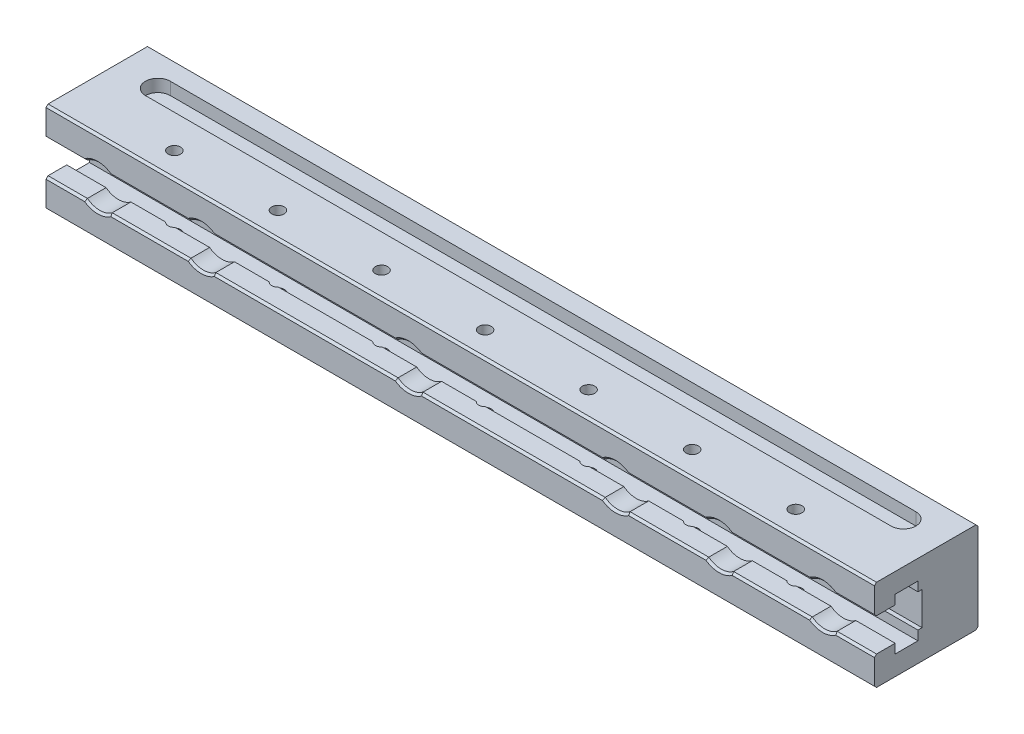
ISO-10303-21;
HEADER;
FILE_DESCRIPTION(('STEP AP214'),'2;1');
FILE_NAME('part.step','',(''),(''),'','','');
FILE_SCHEMA(('AUTOMOTIVE_DESIGN { 1 0 10303 214 1 1 1 1 }'));
ENDSEC;
DATA;
#1=APPLICATION_CONTEXT('core data for automotive mechanical design processes');
#2=APPLICATION_PROTOCOL_DEFINITION('international standard','automotive_design',2000,#1);
#3=PRODUCT_CONTEXT('',#1,'mechanical');
#4=PRODUCT('Part','Part','',(#3));
#5=PRODUCT_RELATED_PRODUCT_CATEGORY('part','',(#4));
#6=PRODUCT_DEFINITION_FORMATION('','',#4);
#7=PRODUCT_DEFINITION_CONTEXT('part definition',#1,'design');
#8=PRODUCT_DEFINITION('design','',#6,#7);
#9=PRODUCT_DEFINITION_SHAPE('','',#8);
#10=(LENGTH_UNIT() NAMED_UNIT(*) SI_UNIT(.MILLI.,.METRE.));
#11=(NAMED_UNIT(*) PLANE_ANGLE_UNIT() SI_UNIT($,.RADIAN.));
#12=(NAMED_UNIT(*) SI_UNIT($,.STERADIAN.) SOLID_ANGLE_UNIT());
#13=UNCERTAINTY_MEASURE_WITH_UNIT(LENGTH_MEASURE(1.E-05),#10,'distance_accuracy_value','');
#14=(GEOMETRIC_REPRESENTATION_CONTEXT(3) GLOBAL_UNCERTAINTY_ASSIGNED_CONTEXT((#13)) GLOBAL_UNIT_ASSIGNED_CONTEXT((#10,
#11,#12)) REPRESENTATION_CONTEXT('',''));
#15=CARTESIAN_POINT('',(0.,0.,0.));
#16=DIRECTION('',(0.,0.,1.));
#17=DIRECTION('',(1.,0.,0.));
#18=AXIS2_PLACEMENT_3D('',#15,#16,#17);
#19=CARTESIAN_POINT('',(-75.,8.,40.));
#20=DIRECTION('',(0.,0.,-1.));
#21=DIRECTION('',(0.,1.,0.));
#22=AXIS2_PLACEMENT_3D('',#19,#20,#21);
#23=PLANE('',#22);
#24=DIRECTION('',(0.,-1.,0.));
#25=VECTOR('',#24,1.);
#26=CARTESIAN_POINT('',(277.2360679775,22.,40.));
#27=LINE('',#26,#25);
#28=CARTESIAN_POINT('',(277.2360679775,12.5,40.));
#29=VERTEX_POINT('',#28);
#30=CARTESIAN_POINT('',(277.2360679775,8.,40.));
#31=VERTEX_POINT('',#30);
#32=EDGE_CURVE('E2467',#29,#31,#27,.T.);
#33=ORIENTED_EDGE('',*,*,#32,.F.);
#34=DIRECTION('',(1.,0.,0.));
#35=VECTOR('',#34,1.);
#36=CARTESIAN_POINT('',(-75.,12.5,40.));
#37=LINE('',#36,#35);
#38=CARTESIAN_POINT('',(325.,12.5,40.));
#39=VERTEX_POINT('',#38);
#40=EDGE_CURVE('E1184',#39,#29,#37,.F.);
#41=ORIENTED_EDGE('',*,*,#40,.F.);
#42=DIRECTION('',(0.,-1.,0.));
#43=VECTOR('',#42,1.);
#44=CARTESIAN_POINT('',(325.,12.4820261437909,40.));
#45=LINE('',#44,#43);
#46=CARTESIAN_POINT('',(325.,8.,40.));
#47=VERTEX_POINT('',#46);
#48=EDGE_CURVE('E924',#47,#39,#45,.F.);
#49=ORIENTED_EDGE('',*,*,#48,.F.);
#50=DIRECTION('',(1.,0.,0.));
#51=VECTOR('',#50,1.);
#52=CARTESIAN_POINT('',(-75.,8.,40.));
#53=LINE('',#52,#51);
#54=CARTESIAN_POINT('',(306.,8.,40.));
#55=VERTEX_POINT('',#54);
#56=EDGE_CURVE('E1227',#47,#55,#53,.F.);
#57=ORIENTED_EDGE('',*,*,#56,.T.);
#58=CARTESIAN_POINT('',(300.,0.,40.));
#59=DIRECTION('',(0.,0.,1.));
#60=DIRECTION('',(0.,-1.,0.));
#61=AXIS2_PLACEMENT_3D('',#58,#59,#60);
#62=CIRCLE('',#61,10.);
#63=CARTESIAN_POINT('',(294.,8.,40.));
#64=VERTEX_POINT('',#63);
#65=EDGE_CURVE('E1230',#55,#64,#62,.T.);
#66=ORIENTED_EDGE('',*,*,#65,.T.);
#67=DIRECTION('',(1.,0.,0.));
#68=VECTOR('',#67,1.);
#69=CARTESIAN_POINT('',(-75.,8.,40.));
#70=LINE('',#69,#68);
#71=EDGE_CURVE('E1222',#64,#31,#70,.F.);
#72=ORIENTED_EDGE('',*,*,#71,.T.);
#73=EDGE_LOOP('',(#33,#41,#49,#57,#66,#72));
#74=FACE_BOUND('',#73,.T.);
#75=ADVANCED_FACE('F14',(#74),#23,.T.);
#76=CARTESIAN_POINT('',(-75.,-8.,40.));
#77=DIRECTION('',(0.,0.,1.));
#78=DIRECTION('',(0.,-1.,0.));
#79=AXIS2_PLACEMENT_3D('',#76,#77,#78);
#80=PLANE('',#79);
#81=DIRECTION('',(1.,0.,0.));
#82=VECTOR('',#81,1.);
#83=CARTESIAN_POINT('',(-75.,-8.,40.));
#84=LINE('',#83,#82);
#85=CARTESIAN_POINT('',(272.7639320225,-8.,40.));
#86=VERTEX_POINT('',#85);
#87=CARTESIAN_POINT('',(256.,-8.,40.));
#88=VERTEX_POINT('',#87);
#89=EDGE_CURVE('E766',#86,#88,#84,.F.);
#90=ORIENTED_EDGE('',*,*,#89,.F.);
#91=DIRECTION('',(0.,-1.,0.));
#92=VECTOR('',#91,1.);
#93=CARTESIAN_POINT('',(272.7639320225,22.,40.));
#94=LINE('',#93,#92);
#95=CARTESIAN_POINT('',(272.7639320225,-12.5,40.));
#96=VERTEX_POINT('',#95);
#97=EDGE_CURVE('E2462',#86,#96,#94,.T.);
#98=ORIENTED_EDGE('',*,*,#97,.T.);
#99=DIRECTION('',(1.,0.,0.));
#100=VECTOR('',#99,1.);
#101=CARTESIAN_POINT('',(-75.,-12.5,40.));
#102=LINE('',#101,#100);
#103=CARTESIAN_POINT('',(227.2360679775,-12.5,40.));
#104=VERTEX_POINT('',#103);
#105=EDGE_CURVE('E757',#104,#96,#102,.T.);
#106=ORIENTED_EDGE('',*,*,#105,.F.);
#107=DIRECTION('',(0.,-1.,0.));
#108=VECTOR('',#107,1.);
#109=CARTESIAN_POINT('',(227.2360679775,22.,40.));
#110=LINE('',#109,#108);
#111=CARTESIAN_POINT('',(227.2360679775,-8.,40.));
#112=VERTEX_POINT('',#111);
#113=EDGE_CURVE('E2474',#104,#112,#110,.F.);
#114=ORIENTED_EDGE('',*,*,#113,.T.);
#115=DIRECTION('',(1.,0.,0.));
#116=VECTOR('',#115,1.);
#117=CARTESIAN_POINT('',(-75.,-8.,40.));
#118=LINE('',#117,#116);
#119=CARTESIAN_POINT('',(244.,-8.,40.));
#120=VERTEX_POINT('',#119);
#121=EDGE_CURVE('E1126',#120,#112,#118,.F.);
#122=ORIENTED_EDGE('',*,*,#121,.F.);
#123=CARTESIAN_POINT('',(250.,0.,40.));
#124=DIRECTION('',(0.,0.,-1.));
#125=DIRECTION('',(0.,1.,0.));
#126=AXIS2_PLACEMENT_3D('',#123,#124,#125);
#127=CIRCLE('',#126,10.);
#128=EDGE_CURVE('E1133',#88,#120,#127,.T.);
#129=ORIENTED_EDGE('',*,*,#128,.F.);
#130=EDGE_LOOP('',(#90,#98,#106,#114,#122,#129));
#131=FACE_BOUND('',#130,.T.);
#132=ADVANCED_FACE('F1748',(#131),#80,.F.);
#133=DIRECTION('',(0.,-1.,0.));
#134=VECTOR('',#133,1.);
#135=CARTESIAN_POINT('',(272.7639320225,22.,40.));
#136=LINE('',#135,#134);
#137=CARTESIAN_POINT('',(272.7639320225,8.,40.));
#138=VERTEX_POINT('',#137);
#139=CARTESIAN_POINT('',(272.7639320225,12.5,40.));
#140=VERTEX_POINT('',#139);
#141=EDGE_CURVE('E31',#138,#140,#136,.F.);
#142=ORIENTED_EDGE('',*,*,#141,.F.);
#143=CARTESIAN_POINT('',(256.,8.,40.));
#144=VERTEX_POINT('',#143);
#145=EDGE_CURVE('E1226',#138,#144,#70,.F.);
#146=ORIENTED_EDGE('',*,*,#145,.T.);
#147=CARTESIAN_POINT('',(250.,0.,40.));
#148=DIRECTION('',(0.,0.,1.));
#149=DIRECTION('',(0.,-1.,0.));
#150=AXIS2_PLACEMENT_3D('',#147,#148,#149);
#151=CIRCLE('',#150,10.);
#152=CARTESIAN_POINT('',(244.,8.,40.));
#153=VERTEX_POINT('',#152);
#154=EDGE_CURVE('E1225',#144,#153,#151,.T.);
#155=ORIENTED_EDGE('',*,*,#154,.T.);
#156=DIRECTION('',(1.,0.,0.));
#157=VECTOR('',#156,1.);
#158=CARTESIAN_POINT('',(-75.,8.,40.));
#159=LINE('',#158,#157);
#160=CARTESIAN_POINT('',(227.2360679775,8.,40.));
#161=VERTEX_POINT('',#160);
#162=EDGE_CURVE('E1217',#153,#161,#159,.F.);
#163=ORIENTED_EDGE('',*,*,#162,.T.);
#164=DIRECTION('',(0.,-1.,0.));
#165=VECTOR('',#164,1.);
#166=CARTESIAN_POINT('',(227.2360679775,22.,40.));
#167=LINE('',#166,#165);
#168=CARTESIAN_POINT('',(227.2360679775,12.5,40.));
#169=VERTEX_POINT('',#168);
#170=EDGE_CURVE('E1829',#169,#161,#167,.T.);
#171=ORIENTED_EDGE('',*,*,#170,.F.);
#172=DIRECTION('',(1.,0.,0.));
#173=VECTOR('',#172,1.);
#174=CARTESIAN_POINT('',(-75.,12.5,40.));
#175=LINE('',#174,#173);
#176=EDGE_CURVE('E1199',#140,#169,#175,.F.);
#177=ORIENTED_EDGE('',*,*,#176,.F.);
#178=EDGE_LOOP('',(#142,#146,#155,#163,#171,#177));
#179=FACE_BOUND('',#178,.T.);
#180=ADVANCED_FACE('F1751',(#179),#23,.T.);
#181=CARTESIAN_POINT('',(222.7639320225,-8.,40.));
#182=VERTEX_POINT('',#181);
#183=CARTESIAN_POINT('',(206.,-8.,40.));
#184=VERTEX_POINT('',#183);
#185=EDGE_CURVE('E1130',#182,#184,#118,.F.);
#186=ORIENTED_EDGE('',*,*,#185,.F.);
#187=DIRECTION('',(0.,-1.,0.));
#188=VECTOR('',#187,1.);
#189=CARTESIAN_POINT('',(222.7639320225,22.,40.));
#190=LINE('',#189,#188);
#191=CARTESIAN_POINT('',(222.7639320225,-12.5,40.));
#192=VERTEX_POINT('',#191);
#193=EDGE_CURVE('E2484',#182,#192,#190,.T.);
#194=ORIENTED_EDGE('',*,*,#193,.T.);
#195=DIRECTION('',(1.,0.,0.));
#196=VECTOR('',#195,1.);
#197=CARTESIAN_POINT('',(-75.,-12.5,40.));
#198=LINE('',#197,#196);
#199=CARTESIAN_POINT('',(177.2360679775,-12.5,40.));
#200=VERTEX_POINT('',#199);
#201=EDGE_CURVE('E768',#200,#192,#198,.T.);
#202=ORIENTED_EDGE('',*,*,#201,.F.);
#203=DIRECTION('',(0.,-1.,0.));
#204=VECTOR('',#203,1.);
#205=CARTESIAN_POINT('',(177.2360679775,22.,40.));
#206=LINE('',#205,#204);
#207=CARTESIAN_POINT('',(177.2360679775,-8.,40.));
#208=VERTEX_POINT('',#207);
#209=EDGE_CURVE('E2494',#200,#208,#206,.F.);
#210=ORIENTED_EDGE('',*,*,#209,.T.);
#211=DIRECTION('',(1.,0.,0.));
#212=VECTOR('',#211,1.);
#213=CARTESIAN_POINT('',(-75.,-8.,40.));
#214=LINE('',#213,#212);
#215=CARTESIAN_POINT('',(194.,-8.,40.));
#216=VERTEX_POINT('',#215);
#217=EDGE_CURVE('E1120',#216,#208,#214,.F.);
#218=ORIENTED_EDGE('',*,*,#217,.F.);
#219=CARTESIAN_POINT('',(200.,0.,40.));
#220=DIRECTION('',(0.,0.,-1.));
#221=DIRECTION('',(0.,1.,0.));
#222=AXIS2_PLACEMENT_3D('',#219,#220,#221);
#223=CIRCLE('',#222,10.);
#224=EDGE_CURVE('E1129',#184,#216,#223,.T.);
#225=ORIENTED_EDGE('',*,*,#224,.F.);
#226=EDGE_LOOP('',(#186,#194,#202,#210,#218,#225));
#227=FACE_BOUND('',#226,.T.);
#228=ADVANCED_FACE('F1758',(#227),#80,.F.);
#229=DIRECTION('',(0.,-1.,0.));
#230=VECTOR('',#229,1.);
#231=CARTESIAN_POINT('',(222.7639320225,22.,40.));
#232=LINE('',#231,#230);
#233=CARTESIAN_POINT('',(222.7639320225,8.,40.));
#234=VERTEX_POINT('',#233);
#235=CARTESIAN_POINT('',(222.7639320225,12.5,40.));
#236=VERTEX_POINT('',#235);
#237=EDGE_CURVE('E1823',#234,#236,#232,.F.);
#238=ORIENTED_EDGE('',*,*,#237,.F.);
#239=CARTESIAN_POINT('',(206.,8.,40.));
#240=VERTEX_POINT('',#239);
#241=EDGE_CURVE('E1221',#234,#240,#159,.F.);
#242=ORIENTED_EDGE('',*,*,#241,.T.);
#243=CARTESIAN_POINT('',(200.,0.,40.));
#244=DIRECTION('',(0.,0.,1.));
#245=DIRECTION('',(0.,-1.,0.));
#246=AXIS2_PLACEMENT_3D('',#243,#244,#245);
#247=CIRCLE('',#246,10.);
#248=CARTESIAN_POINT('',(194.,8.,40.));
#249=VERTEX_POINT('',#248);
#250=EDGE_CURVE('E1220',#240,#249,#247,.T.);
#251=ORIENTED_EDGE('',*,*,#250,.T.);
#252=DIRECTION('',(1.,0.,0.));
#253=VECTOR('',#252,1.);
#254=CARTESIAN_POINT('',(-75.,8.,40.));
#255=LINE('',#254,#253);
#256=CARTESIAN_POINT('',(177.2360679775,8.,40.));
#257=VERTEX_POINT('',#256);
#258=EDGE_CURVE('E1211',#249,#257,#255,.F.);
#259=ORIENTED_EDGE('',*,*,#258,.T.);
#260=DIRECTION('',(0.,-1.,0.));
#261=VECTOR('',#260,1.);
#262=CARTESIAN_POINT('',(177.2360679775,22.,40.));
#263=LINE('',#262,#261);
#264=CARTESIAN_POINT('',(177.2360679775,12.5,40.));
#265=VERTEX_POINT('',#264);
#266=EDGE_CURVE('E1844',#265,#257,#263,.T.);
#267=ORIENTED_EDGE('',*,*,#266,.F.);
#268=DIRECTION('',(1.,0.,0.));
#269=VECTOR('',#268,1.);
#270=CARTESIAN_POINT('',(-75.,12.5,40.));
#271=LINE('',#270,#269);
#272=EDGE_CURVE('E1197',#236,#265,#271,.F.);
#273=ORIENTED_EDGE('',*,*,#272,.F.);
#274=EDGE_LOOP('',(#238,#242,#251,#259,#267,#273));
#275=FACE_BOUND('',#274,.T.);
#276=ADVANCED_FACE('F1764',(#275),#23,.T.);
#277=CARTESIAN_POINT('',(172.7639320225,-8.,40.));
#278=VERTEX_POINT('',#277);
#279=CARTESIAN_POINT('',(127.2360679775,-8.,40.));
#280=VERTEX_POINT('',#279);
#281=EDGE_CURVE('E1124',#278,#280,#214,.F.);
#282=ORIENTED_EDGE('',*,*,#281,.F.);
#283=DIRECTION('',(0.,-1.,0.));
#284=VECTOR('',#283,1.);
#285=CARTESIAN_POINT('',(172.7639320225,22.,40.));
#286=LINE('',#285,#284);
#287=CARTESIAN_POINT('',(172.7639320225,-12.5,40.));
#288=VERTEX_POINT('',#287);
#289=EDGE_CURVE('E2505',#278,#288,#286,.T.);
#290=ORIENTED_EDGE('',*,*,#289,.T.);
#291=DIRECTION('',(1.,0.,0.));
#292=VECTOR('',#291,1.);
#293=CARTESIAN_POINT('',(-75.,-12.5,40.));
#294=LINE('',#293,#292);
#295=CARTESIAN_POINT('',(127.2360679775,-12.5,40.));
#296=VERTEX_POINT('',#295);
#297=EDGE_CURVE('E779',#296,#288,#294,.T.);
#298=ORIENTED_EDGE('',*,*,#297,.F.);
#299=DIRECTION('',(0.,-1.,0.));
#300=VECTOR('',#299,1.);
#301=CARTESIAN_POINT('',(127.2360679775,22.,40.));
#302=LINE('',#301,#300);
#303=EDGE_CURVE('E1862',#296,#280,#302,.F.);
#304=ORIENTED_EDGE('',*,*,#303,.T.);
#305=EDGE_LOOP('',(#282,#290,#298,#304));
#306=FACE_BOUND('',#305,.T.);
#307=ADVANCED_FACE('F1806',(#306),#80,.F.);
#308=DIRECTION('',(0.,-1.,0.));
#309=VECTOR('',#308,1.);
#310=CARTESIAN_POINT('',(172.7639320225,22.,40.));
#311=LINE('',#310,#309);
#312=CARTESIAN_POINT('',(172.7639320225,8.,40.));
#313=VERTEX_POINT('',#312);
#314=CARTESIAN_POINT('',(172.7639320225,12.5,40.));
#315=VERTEX_POINT('',#314);
#316=EDGE_CURVE('E1857',#313,#315,#311,.F.);
#317=ORIENTED_EDGE('',*,*,#316,.F.);
#318=CARTESIAN_POINT('',(127.2360679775,8.,40.));
#319=VERTEX_POINT('',#318);
#320=EDGE_CURVE('E1215',#313,#319,#255,.F.);
#321=ORIENTED_EDGE('',*,*,#320,.T.);
#322=DIRECTION('',(0.,-1.,0.));
#323=VECTOR('',#322,1.);
#324=CARTESIAN_POINT('',(127.2360679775,22.,40.));
#325=LINE('',#324,#323);
#326=CARTESIAN_POINT('',(127.2360679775,12.5,40.));
#327=VERTEX_POINT('',#326);
#328=EDGE_CURVE('E1880',#327,#319,#325,.T.);
#329=ORIENTED_EDGE('',*,*,#328,.F.);
#330=DIRECTION('',(1.,0.,0.));
#331=VECTOR('',#330,1.);
#332=CARTESIAN_POINT('',(-75.,12.5,40.));
#333=LINE('',#332,#331);
#334=EDGE_CURVE('E1195',#315,#327,#333,.F.);
#335=ORIENTED_EDGE('',*,*,#334,.F.);
#336=EDGE_LOOP('',(#317,#321,#329,#335));
#337=FACE_BOUND('',#336,.T.);
#338=ADVANCED_FACE('F1801',(#337),#23,.T.);
#339=CARTESIAN_POINT('',(122.7639320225,-8.,40.));
#340=VERTEX_POINT('',#339);
#341=CARTESIAN_POINT('',(106.,-8.,40.));
#342=VERTEX_POINT('',#341);
#343=EDGE_CURVE('E1125',#340,#342,#214,.F.);
#344=ORIENTED_EDGE('',*,*,#343,.F.);
#345=DIRECTION('',(0.,-1.,0.));
#346=VECTOR('',#345,1.);
#347=CARTESIAN_POINT('',(122.7639320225,22.,40.));
#348=LINE('',#347,#346);
#349=CARTESIAN_POINT('',(122.7639320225,-12.5,40.));
#350=VERTEX_POINT('',#349);
#351=EDGE_CURVE('E1872',#340,#350,#348,.T.);
#352=ORIENTED_EDGE('',*,*,#351,.T.);
#353=DIRECTION('',(1.,0.,0.));
#354=VECTOR('',#353,1.);
#355=CARTESIAN_POINT('',(-75.,-12.5,40.));
#356=LINE('',#355,#354);
#357=CARTESIAN_POINT('',(77.2360679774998,-12.5,40.));
#358=VERTEX_POINT('',#357);
#359=EDGE_CURVE('E782',#358,#350,#356,.T.);
#360=ORIENTED_EDGE('',*,*,#359,.F.);
#361=DIRECTION('',(0.,-1.,0.));
#362=VECTOR('',#361,1.);
#363=CARTESIAN_POINT('',(77.2360679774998,22.,40.));
#364=LINE('',#363,#362);
#365=CARTESIAN_POINT('',(77.2360679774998,-8.,40.));
#366=VERTEX_POINT('',#365);
#367=EDGE_CURVE('E1889',#358,#366,#364,.F.);
#368=ORIENTED_EDGE('',*,*,#367,.T.);
#369=DIRECTION('',(1.,0.,0.));
#370=VECTOR('',#369,1.);
#371=CARTESIAN_POINT('',(-75.,-8.,40.));
#372=LINE('',#371,#370);
#373=CARTESIAN_POINT('',(94.,-8.,40.));
#374=VERTEX_POINT('',#373);
#375=EDGE_CURVE('E1114',#374,#366,#372,.F.);
#376=ORIENTED_EDGE('',*,*,#375,.F.);
#377=CARTESIAN_POINT('',(100.,0.,40.));
#378=DIRECTION('',(0.,0.,-1.));
#379=DIRECTION('',(0.,1.,0.));
#380=AXIS2_PLACEMENT_3D('',#377,#378,#379);
#381=CIRCLE('',#380,10.);
#382=EDGE_CURVE('E1123',#342,#374,#381,.T.);
#383=ORIENTED_EDGE('',*,*,#382,.F.);
#384=EDGE_LOOP('',(#344,#352,#360,#368,#376,#383));
#385=FACE_BOUND('',#384,.T.);
#386=ADVANCED_FACE('F1797',(#385),#80,.F.);
#387=DIRECTION('',(0.,-1.,0.));
#388=VECTOR('',#387,1.);
#389=CARTESIAN_POINT('',(122.7639320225,22.,40.));
#390=LINE('',#389,#388);
#391=CARTESIAN_POINT('',(122.7639320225,8.,40.));
#392=VERTEX_POINT('',#391);
#393=CARTESIAN_POINT('',(122.7639320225,12.5,40.));
#394=VERTEX_POINT('',#393);
#395=EDGE_CURVE('E1878',#392,#394,#390,.F.);
#396=ORIENTED_EDGE('',*,*,#395,.F.);
#397=CARTESIAN_POINT('',(106.,8.,40.));
#398=VERTEX_POINT('',#397);
#399=EDGE_CURVE('E1216',#392,#398,#255,.F.);
#400=ORIENTED_EDGE('',*,*,#399,.T.);
#401=CARTESIAN_POINT('',(100.,0.,40.));
#402=DIRECTION('',(0.,0.,1.));
#403=DIRECTION('',(0.,-1.,0.));
#404=AXIS2_PLACEMENT_3D('',#401,#402,#403);
#405=CIRCLE('',#404,10.);
#406=CARTESIAN_POINT('',(94.,8.,40.));
#407=VERTEX_POINT('',#406);
#408=EDGE_CURVE('E1214',#398,#407,#405,.T.);
#409=ORIENTED_EDGE('',*,*,#408,.T.);
#410=DIRECTION('',(1.,0.,0.));
#411=VECTOR('',#410,1.);
#412=CARTESIAN_POINT('',(-75.,8.,40.));
#413=LINE('',#412,#411);
#414=CARTESIAN_POINT('',(77.2360679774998,8.,40.));
#415=VERTEX_POINT('',#414);
#416=EDGE_CURVE('E1205',#407,#415,#413,.F.);
#417=ORIENTED_EDGE('',*,*,#416,.T.);
#418=DIRECTION('',(0.,-1.,0.));
#419=VECTOR('',#418,1.);
#420=CARTESIAN_POINT('',(77.2360679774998,22.,40.));
#421=LINE('',#420,#419);
#422=CARTESIAN_POINT('',(77.2360679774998,12.5,40.));
#423=VERTEX_POINT('',#422);
#424=EDGE_CURVE('E1908',#423,#415,#421,.T.);
#425=ORIENTED_EDGE('',*,*,#424,.F.);
#426=DIRECTION('',(1.,0.,0.));
#427=VECTOR('',#426,1.);
#428=CARTESIAN_POINT('',(-75.,12.5,40.));
#429=LINE('',#428,#427);
#430=EDGE_CURVE('E1193',#394,#423,#429,.F.);
#431=ORIENTED_EDGE('',*,*,#430,.F.);
#432=EDGE_LOOP('',(#396,#400,#409,#417,#425,#431));
#433=FACE_BOUND('',#432,.T.);
#434=ADVANCED_FACE('F1792',(#433),#23,.T.);
#435=CARTESIAN_POINT('',(72.7639320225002,-8.,40.));
#436=VERTEX_POINT('',#435);
#437=CARTESIAN_POINT('',(27.2360679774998,-8.,40.));
#438=VERTEX_POINT('',#437);
#439=EDGE_CURVE('E1118',#436,#438,#372,.F.);
#440=ORIENTED_EDGE('',*,*,#439,.F.);
#441=DIRECTION('',(0.,-1.,0.));
#442=VECTOR('',#441,1.);
#443=CARTESIAN_POINT('',(72.7639320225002,22.,40.));
#444=LINE('',#443,#442);
#445=CARTESIAN_POINT('',(72.7639320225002,-12.5,40.));
#446=VERTEX_POINT('',#445);
#447=EDGE_CURVE('E1900',#436,#446,#444,.T.);
#448=ORIENTED_EDGE('',*,*,#447,.T.);
#449=DIRECTION('',(1.,0.,0.));
#450=VECTOR('',#449,1.);
#451=CARTESIAN_POINT('',(-75.,-12.5,40.));
#452=LINE('',#451,#450);
#453=CARTESIAN_POINT('',(27.2360679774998,-12.5,40.));
#454=VERTEX_POINT('',#453);
#455=EDGE_CURVE('E785',#454,#446,#452,.T.);
#456=ORIENTED_EDGE('',*,*,#455,.F.);
#457=DIRECTION('',(0.,-1.,0.));
#458=VECTOR('',#457,1.);
#459=CARTESIAN_POINT('',(27.2360679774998,22.,40.));
#460=LINE('',#459,#458);
#461=EDGE_CURVE('E1916',#454,#438,#460,.F.);
#462=ORIENTED_EDGE('',*,*,#461,.T.);
#463=EDGE_LOOP('',(#440,#448,#456,#462));
#464=FACE_BOUND('',#463,.T.);
#465=ADVANCED_FACE('F1788',(#464),#80,.F.);
#466=DIRECTION('',(0.,-1.,0.));
#467=VECTOR('',#466,1.);
#468=CARTESIAN_POINT('',(72.7639320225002,22.,40.));
#469=LINE('',#468,#467);
#470=CARTESIAN_POINT('',(72.7639320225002,8.,40.));
#471=VERTEX_POINT('',#470);
#472=CARTESIAN_POINT('',(72.7639320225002,12.5,40.));
#473=VERTEX_POINT('',#472);
#474=EDGE_CURVE('E1906',#471,#473,#469,.F.);
#475=ORIENTED_EDGE('',*,*,#474,.F.);
#476=CARTESIAN_POINT('',(27.2360679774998,8.,40.));
#477=VERTEX_POINT('',#476);
#478=EDGE_CURVE('E1209',#471,#477,#413,.F.);
#479=ORIENTED_EDGE('',*,*,#478,.T.);
#480=DIRECTION('',(0.,-1.,0.));
#481=VECTOR('',#480,1.);
#482=CARTESIAN_POINT('',(27.2360679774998,22.,40.));
#483=LINE('',#482,#481);
#484=CARTESIAN_POINT('',(27.2360679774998,12.5,40.));
#485=VERTEX_POINT('',#484);
#486=EDGE_CURVE('E1935',#485,#477,#483,.T.);
#487=ORIENTED_EDGE('',*,*,#486,.F.);
#488=DIRECTION('',(1.,0.,0.));
#489=VECTOR('',#488,1.);
#490=CARTESIAN_POINT('',(-75.,12.5,40.));
#491=LINE('',#490,#489);
#492=EDGE_CURVE('E1191',#473,#485,#491,.F.);
#493=ORIENTED_EDGE('',*,*,#492,.F.);
#494=EDGE_LOOP('',(#475,#479,#487,#493));
#495=FACE_BOUND('',#494,.T.);
#496=ADVANCED_FACE('F1780',(#495),#23,.T.);
#497=CARTESIAN_POINT('',(22.7639320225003,-8.,40.));
#498=VERTEX_POINT('',#497);
#499=CARTESIAN_POINT('',(6.,-8.,40.));
#500=VERTEX_POINT('',#499);
#501=EDGE_CURVE('E1119',#498,#500,#372,.F.);
#502=ORIENTED_EDGE('',*,*,#501,.F.);
#503=DIRECTION('',(0.,-1.,0.));
#504=VECTOR('',#503,1.);
#505=CARTESIAN_POINT('',(22.7639320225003,22.,40.));
#506=LINE('',#505,#504);
#507=CARTESIAN_POINT('',(22.7639320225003,-12.5,40.));
#508=VERTEX_POINT('',#507);
#509=EDGE_CURVE('E1927',#498,#508,#506,.T.);
#510=ORIENTED_EDGE('',*,*,#509,.T.);
#511=DIRECTION('',(1.,0.,0.));
#512=VECTOR('',#511,1.);
#513=CARTESIAN_POINT('',(-75.,-12.5,40.));
#514=LINE('',#513,#512);
#515=CARTESIAN_POINT('',(-22.7639320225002,-12.5,40.));
#516=VERTEX_POINT('',#515);
#517=EDGE_CURVE('E788',#516,#508,#514,.T.);
#518=ORIENTED_EDGE('',*,*,#517,.F.);
#519=DIRECTION('',(0.,-1.,0.));
#520=VECTOR('',#519,1.);
#521=CARTESIAN_POINT('',(-22.7639320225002,22.,40.));
#522=LINE('',#521,#520);
#523=CARTESIAN_POINT('',(-22.7639320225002,-8.,40.));
#524=VERTEX_POINT('',#523);
#525=EDGE_CURVE('E1944',#516,#524,#522,.F.);
#526=ORIENTED_EDGE('',*,*,#525,.T.);
#527=DIRECTION('',(1.,0.,0.));
#528=VECTOR('',#527,1.);
#529=CARTESIAN_POINT('',(-75.,-8.,40.));
#530=LINE('',#529,#528);
#531=CARTESIAN_POINT('',(-6.,-8.,40.));
#532=VERTEX_POINT('',#531);
#533=EDGE_CURVE('E1109',#532,#524,#530,.F.);
#534=ORIENTED_EDGE('',*,*,#533,.F.);
#535=CARTESIAN_POINT('',(0.,0.,40.));
#536=DIRECTION('',(0.,0.,-1.));
#537=DIRECTION('',(0.,1.,0.));
#538=AXIS2_PLACEMENT_3D('',#535,#536,#537);
#539=CIRCLE('',#538,10.);
#540=EDGE_CURVE('E1117',#500,#532,#539,.T.);
#541=ORIENTED_EDGE('',*,*,#540,.F.);
#542=EDGE_LOOP('',(#502,#510,#518,#526,#534,#541));
#543=FACE_BOUND('',#542,.T.);
#544=ADVANCED_FACE('F1778',(#543),#80,.F.);
#545=DIRECTION('',(0.,-1.,0.));
#546=VECTOR('',#545,1.);
#547=CARTESIAN_POINT('',(22.7639320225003,22.,40.));
#548=LINE('',#547,#546);
#549=CARTESIAN_POINT('',(22.7639320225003,8.,40.));
#550=VERTEX_POINT('',#549);
#551=CARTESIAN_POINT('',(22.7639320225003,12.5,40.));
#552=VERTEX_POINT('',#551);
#553=EDGE_CURVE('E1933',#550,#552,#548,.F.);
#554=ORIENTED_EDGE('',*,*,#553,.F.);
#555=CARTESIAN_POINT('',(6.,8.,40.));
#556=VERTEX_POINT('',#555);
#557=EDGE_CURVE('E1210',#550,#556,#413,.F.);
#558=ORIENTED_EDGE('',*,*,#557,.T.);
#559=CARTESIAN_POINT('',(0.,0.,40.));
#560=DIRECTION('',(0.,0.,1.));
#561=DIRECTION('',(0.,-1.,0.));
#562=AXIS2_PLACEMENT_3D('',#559,#560,#561);
#563=CIRCLE('',#562,10.);
#564=CARTESIAN_POINT('',(-6.,8.,40.));
#565=VERTEX_POINT('',#564);
#566=EDGE_CURVE('E1208',#556,#565,#563,.T.);
#567=ORIENTED_EDGE('',*,*,#566,.T.);
#568=DIRECTION('',(1.,0.,0.));
#569=VECTOR('',#568,1.);
#570=CARTESIAN_POINT('',(-75.,8.,40.));
#571=LINE('',#570,#569);
#572=CARTESIAN_POINT('',(-22.7639320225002,8.,40.));
#573=VERTEX_POINT('',#572);
#574=EDGE_CURVE('E1201',#565,#573,#571,.F.);
#575=ORIENTED_EDGE('',*,*,#574,.T.);
#576=DIRECTION('',(0.,-1.,0.));
#577=VECTOR('',#576,1.);
#578=CARTESIAN_POINT('',(-22.7639320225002,22.,40.));
#579=LINE('',#578,#577);
#580=CARTESIAN_POINT('',(-22.7639320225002,12.5,40.));
#581=VERTEX_POINT('',#580);
#582=EDGE_CURVE('E1963',#581,#573,#579,.T.);
#583=ORIENTED_EDGE('',*,*,#582,.F.);
#584=DIRECTION('',(1.,0.,0.));
#585=VECTOR('',#584,1.);
#586=CARTESIAN_POINT('',(-75.,12.5,40.));
#587=LINE('',#586,#585);
#588=EDGE_CURVE('E1189',#552,#581,#587,.F.);
#589=ORIENTED_EDGE('',*,*,#588,.F.);
#590=EDGE_LOOP('',(#554,#558,#567,#575,#583,#589));
#591=FACE_BOUND('',#590,.T.);
#592=ADVANCED_FACE('F1768',(#591),#23,.T.);
#593=CARTESIAN_POINT('',(-27.2360679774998,-8.,40.));
#594=VERTEX_POINT('',#593);
#595=CARTESIAN_POINT('',(-44.,-8.,40.));
#596=VERTEX_POINT('',#595);
#597=EDGE_CURVE('E1113',#594,#596,#530,.F.);
#598=ORIENTED_EDGE('',*,*,#597,.F.);
#599=DIRECTION('',(0.,-1.,0.));
#600=VECTOR('',#599,1.);
#601=CARTESIAN_POINT('',(-27.2360679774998,22.,40.));
#602=LINE('',#601,#600);
#603=CARTESIAN_POINT('',(-27.2360679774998,-12.5,40.));
#604=VERTEX_POINT('',#603);
#605=EDGE_CURVE('E1955',#594,#604,#602,.T.);
#606=ORIENTED_EDGE('',*,*,#605,.T.);
#607=DIRECTION('',(1.,0.,0.));
#608=VECTOR('',#607,1.);
#609=CARTESIAN_POINT('',(-75.,-12.5,40.));
#610=LINE('',#609,#608);
#611=CARTESIAN_POINT('',(-75.,-12.5,40.));
#612=VERTEX_POINT('',#611);
#613=EDGE_CURVE('E791',#612,#604,#610,.T.);
#614=ORIENTED_EDGE('',*,*,#613,.F.);
#615=DIRECTION('',(0.,-1.,0.));
#616=VECTOR('',#615,1.);
#617=CARTESIAN_POINT('',(-75.,12.4820261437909,40.));
#618=LINE('',#617,#616);
#619=CARTESIAN_POINT('',(-75.,-8.,40.));
#620=VERTEX_POINT('',#619);
#621=EDGE_CURVE('E799',#620,#612,#618,.T.);
#622=ORIENTED_EDGE('',*,*,#621,.F.);
#623=DIRECTION('',(1.,0.,0.));
#624=VECTOR('',#623,1.);
#625=CARTESIAN_POINT('',(-75.,-8.,40.));
#626=LINE('',#625,#624);
#627=CARTESIAN_POINT('',(-56.,-8.,40.));
#628=VERTEX_POINT('',#627);
#629=EDGE_CURVE('E794',#628,#620,#626,.F.);
#630=ORIENTED_EDGE('',*,*,#629,.F.);
#631=CARTESIAN_POINT('',(-50.,0.,40.));
#632=DIRECTION('',(0.,0.,-1.));
#633=DIRECTION('',(0.,1.,0.));
#634=AXIS2_PLACEMENT_3D('',#631,#632,#633);
#635=CIRCLE('',#634,10.);
#636=EDGE_CURVE('E1112',#596,#628,#635,.T.);
#637=ORIENTED_EDGE('',*,*,#636,.F.);
#638=EDGE_LOOP('',(#598,#606,#614,#622,#630,#637));
#639=FACE_BOUND('',#638,.T.);
#640=ADVANCED_FACE('F1777',(#639),#80,.F.);
#641=CARTESIAN_POINT('',(125.,16.,16.));
#642=DIRECTION('',(0.,-1.,0.));
#643=DIRECTION('',(0.,0.,-1.));
#644=AXIS2_PLACEMENT_3D('',#641,#642,#643);
#645=PLANE('',#644);
#646=DIRECTION('',(1.,0.,0.));
#647=VECTOR('',#646,1.);
#648=CARTESIAN_POINT('',(-55.,16.,10.));
#649=LINE('',#648,#647);
#650=CARTESIAN_POINT('',(305.,16.,10.));
#651=VERTEX_POINT('',#650);
#652=CARTESIAN_POINT('',(-55.,16.,10.));
#653=VERTEX_POINT('',#652);
#654=EDGE_CURVE('E1446',#651,#653,#649,.F.);
#655=ORIENTED_EDGE('',*,*,#654,.T.);
#656=CARTESIAN_POINT('',(-55.,16.,16.));
#657=DIRECTION('',(0.,-1.,0.));
#658=DIRECTION('',(0.,0.,-1.));
#659=AXIS2_PLACEMENT_3D('',#656,#657,#658);
#660=CIRCLE('',#659,6.);
#661=CARTESIAN_POINT('',(-55.,16.,22.));
#662=VERTEX_POINT('',#661);
#663=EDGE_CURVE('E1582',#653,#662,#660,.F.);
#664=ORIENTED_EDGE('',*,*,#663,.T.);
#665=DIRECTION('',(-1.,0.,0.));
#666=VECTOR('',#665,1.);
#667=CARTESIAN_POINT('',(305.,16.,22.));
#668=LINE('',#667,#666);
#669=CARTESIAN_POINT('',(305.,16.,22.));
#670=VERTEX_POINT('',#669);
#671=EDGE_CURVE('E1442',#662,#670,#668,.F.);
#672=ORIENTED_EDGE('',*,*,#671,.T.);
#673=CARTESIAN_POINT('',(305.,16.,16.));
#674=DIRECTION('',(0.,-1.,0.));
#675=DIRECTION('',(0.,0.,-1.));
#676=AXIS2_PLACEMENT_3D('',#673,#674,#675);
#677=CIRCLE('',#676,6.00000000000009);
#678=EDGE_CURVE('E18',#670,#651,#677,.F.);
#679=ORIENTED_EDGE('',*,*,#678,.T.);
#680=EDGE_LOOP('',(#655,#664,#672,#679));
#681=FACE_BOUND('',#680,.T.);
#682=ADVANCED_FACE('F16',(#681),#645,.F.);
#683=CARTESIAN_POINT('',(125.,-16.,16.));
#684=DIRECTION('',(0.,-1.,0.));
#685=DIRECTION('',(0.,0.,-1.));
#686=AXIS2_PLACEMENT_3D('',#683,#684,#685);
#687=PLANE('',#686);
#688=CARTESIAN_POINT('',(-55.,-16.,16.));
#689=DIRECTION('',(0.,-1.,0.));
#690=DIRECTION('',(0.,0.,-1.));
#691=AXIS2_PLACEMENT_3D('',#688,#689,#690);
#692=CIRCLE('',#691,6.);
#693=CARTESIAN_POINT('',(-55.,-16.,22.));
#694=VERTEX_POINT('',#693);
#695=CARTESIAN_POINT('',(-55.,-16.,10.));
#696=VERTEX_POINT('',#695);
#697=EDGE_CURVE('E1280',#694,#696,#692,.T.);
#698=ORIENTED_EDGE('',*,*,#697,.T.);
#699=DIRECTION('',(-1.,0.,0.));
#700=VECTOR('',#699,1.);
#701=CARTESIAN_POINT('',(-55.,-16.,10.));
#702=LINE('',#701,#700);
#703=CARTESIAN_POINT('',(305.,-16.,10.));
#704=VERTEX_POINT('',#703);
#705=EDGE_CURVE('E1276',#704,#696,#702,.T.);
#706=ORIENTED_EDGE('',*,*,#705,.F.);
#707=CARTESIAN_POINT('',(305.,-16.,16.));
#708=DIRECTION('',(0.,-1.,0.));
#709=DIRECTION('',(0.,0.,-1.));
#710=AXIS2_PLACEMENT_3D('',#707,#708,#709);
#711=CIRCLE('',#710,6.00000000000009);
#712=CARTESIAN_POINT('',(305.,-16.,22.));
#713=VERTEX_POINT('',#712);
#714=EDGE_CURVE('E1290',#704,#713,#711,.T.);
#715=ORIENTED_EDGE('',*,*,#714,.T.);
#716=DIRECTION('',(1.,0.,0.));
#717=VECTOR('',#716,1.);
#718=CARTESIAN_POINT('',(305.,-16.,22.));
#719=LINE('',#718,#717);
#720=EDGE_CURVE('E1287',#694,#713,#719,.T.);
#721=ORIENTED_EDGE('',*,*,#720,.F.);
#722=EDGE_LOOP('',(#698,#706,#715,#721));
#723=FACE_BOUND('',#722,.T.);
#724=ADVANCED_FACE('F2053',(#723),#687,.T.);
#725=CARTESIAN_POINT('',(-75.,8.,27.));
#726=DIRECTION('',(0.,0.,1.));
#727=DIRECTION('',(0.,-1.,0.));
#728=AXIS2_PLACEMENT_3D('',#725,#726,#727);
#729=PLANE('',#728);
#730=CARTESIAN_POINT('',(200.,0.,27.));
#731=DIRECTION('',(0.,0.,1.));
#732=DIRECTION('',(0.,-1.,0.));
#733=AXIS2_PLACEMENT_3D('',#730,#731,#732);
#734=CIRCLE('',#733,10.);
#735=CARTESIAN_POINT('',(194.,-8.,27.));
#736=VERTEX_POINT('',#735);
#737=CARTESIAN_POINT('',(194.,8.,27.));
#738=VERTEX_POINT('',#737);
#739=EDGE_CURVE('E853',#736,#738,#734,.F.);
#740=ORIENTED_EDGE('',*,*,#739,.T.);
#741=DIRECTION('',(1.,0.,0.));
#742=VECTOR('',#741,1.);
#743=CARTESIAN_POINT('',(-75.,8.,27.));
#744=LINE('',#743,#742);
#745=CARTESIAN_POINT('',(106.,8.,27.));
#746=VERTEX_POINT('',#745);
#747=EDGE_CURVE('E1389',#746,#738,#744,.T.);
#748=ORIENTED_EDGE('',*,*,#747,.F.);
#749=CARTESIAN_POINT('',(100.,0.,27.));
#750=DIRECTION('',(0.,0.,1.));
#751=DIRECTION('',(0.,-1.,0.));
#752=AXIS2_PLACEMENT_3D('',#749,#750,#751);
#753=CIRCLE('',#752,10.);
#754=CARTESIAN_POINT('',(106.,-8.,27.));
#755=VERTEX_POINT('',#754);
#756=EDGE_CURVE('E850',#746,#755,#753,.F.);
#757=ORIENTED_EDGE('',*,*,#756,.T.);
#758=DIRECTION('',(1.,0.,0.));
#759=VECTOR('',#758,1.);
#760=CARTESIAN_POINT('',(-75.,-8.,27.));
#761=LINE('',#760,#759);
#762=EDGE_CURVE('E1379',#755,#736,#761,.T.);
#763=ORIENTED_EDGE('',*,*,#762,.T.);
#764=EDGE_LOOP('',(#740,#748,#757,#763));
#765=FACE_BOUND('',#764,.T.);
#766=ADVANCED_FACE('F1647',(#765),#729,.T.);
#767=CARTESIAN_POINT('',(-75.,8.,27.));
#768=DIRECTION('',(0.,0.,1.));
#769=DIRECTION('',(0.,-1.,0.));
#770=AXIS2_PLACEMENT_3D('',#767,#768,#769);
#771=PLANE('',#770);
#772=CARTESIAN_POINT('',(250.,0.,27.));
#773=DIRECTION('',(0.,0.,1.));
#774=DIRECTION('',(0.,-1.,0.));
#775=AXIS2_PLACEMENT_3D('',#772,#773,#774);
#776=CIRCLE('',#775,10.);
#777=CARTESIAN_POINT('',(256.,8.,27.));
#778=VERTEX_POINT('',#777);
#779=CARTESIAN_POINT('',(256.,-8.,27.));
#780=VERTEX_POINT('',#779);
#781=EDGE_CURVE('E843',#778,#780,#776,.F.);
#782=ORIENTED_EDGE('',*,*,#781,.T.);
#783=DIRECTION('',(1.,0.,0.));
#784=VECTOR('',#783,1.);
#785=CARTESIAN_POINT('',(-75.,-8.,27.));
#786=LINE('',#785,#784);
#787=CARTESIAN_POINT('',(294.,-8.,27.));
#788=VERTEX_POINT('',#787);
#789=EDGE_CURVE('E1371',#780,#788,#786,.T.);
#790=ORIENTED_EDGE('',*,*,#789,.T.);
#791=CARTESIAN_POINT('',(300.,0.,27.));
#792=DIRECTION('',(0.,0.,1.));
#793=DIRECTION('',(0.,-1.,0.));
#794=AXIS2_PLACEMENT_3D('',#791,#792,#793);
#795=CIRCLE('',#794,10.);
#796=CARTESIAN_POINT('',(294.,8.,27.));
#797=VERTEX_POINT('',#796);
#798=EDGE_CURVE('E838',#788,#797,#795,.F.);
#799=ORIENTED_EDGE('',*,*,#798,.T.);
#800=DIRECTION('',(1.,0.,0.));
#801=VECTOR('',#800,1.);
#802=CARTESIAN_POINT('',(-75.,8.,27.));
#803=LINE('',#802,#801);
#804=EDGE_CURVE('E1383',#778,#797,#803,.T.);
#805=ORIENTED_EDGE('',*,*,#804,.F.);
#806=EDGE_LOOP('',(#782,#790,#799,#805));
#807=FACE_BOUND('',#806,.T.);
#808=ADVANCED_FACE('F2048',(#807),#771,.T.);
#809=CARTESIAN_POINT('',(-75.,8.,27.));
#810=DIRECTION('',(0.,0.,1.));
#811=DIRECTION('',(0.,-1.,0.));
#812=AXIS2_PLACEMENT_3D('',#809,#810,#811);
#813=PLANE('',#812);
#814=CARTESIAN_POINT('',(250.,0.,27.));
#815=DIRECTION('',(0.,0.,1.));
#816=DIRECTION('',(0.,-1.,0.));
#817=AXIS2_PLACEMENT_3D('',#814,#815,#816);
#818=CIRCLE('',#817,10.);
#819=CARTESIAN_POINT('',(244.,-8.,27.));
#820=VERTEX_POINT('',#819);
#821=CARTESIAN_POINT('',(244.,8.,27.));
#822=VERTEX_POINT('',#821);
#823=EDGE_CURVE('E846',#820,#822,#818,.F.);
#824=ORIENTED_EDGE('',*,*,#823,.T.);
#825=DIRECTION('',(1.,0.,0.));
#826=VECTOR('',#825,1.);
#827=CARTESIAN_POINT('',(-75.,8.,27.));
#828=LINE('',#827,#826);
#829=CARTESIAN_POINT('',(206.,8.,27.));
#830=VERTEX_POINT('',#829);
#831=EDGE_CURVE('E1387',#830,#822,#828,.T.);
#832=ORIENTED_EDGE('',*,*,#831,.F.);
#833=CARTESIAN_POINT('',(200.,0.,27.));
#834=DIRECTION('',(0.,0.,1.));
#835=DIRECTION('',(0.,-1.,0.));
#836=AXIS2_PLACEMENT_3D('',#833,#834,#835);
#837=CIRCLE('',#836,10.);
#838=CARTESIAN_POINT('',(206.,-8.,27.));
#839=VERTEX_POINT('',#838);
#840=EDGE_CURVE('E839',#830,#839,#837,.F.);
#841=ORIENTED_EDGE('',*,*,#840,.T.);
#842=DIRECTION('',(1.,0.,0.));
#843=VECTOR('',#842,1.);
#844=CARTESIAN_POINT('',(-75.,-8.,27.));
#845=LINE('',#844,#843);
#846=EDGE_CURVE('E1375',#839,#820,#845,.T.);
#847=ORIENTED_EDGE('',*,*,#846,.T.);
#848=EDGE_LOOP('',(#824,#832,#841,#847));
#849=FACE_BOUND('',#848,.T.);
#850=ADVANCED_FACE('F2045',(#849),#813,.T.);
#851=CARTESIAN_POINT('',(-75.,8.,27.));
#852=DIRECTION('',(0.,0.,1.));
#853=DIRECTION('',(0.,-1.,0.));
#854=AXIS2_PLACEMENT_3D('',#851,#852,#853);
#855=PLANE('',#854);
#856=CARTESIAN_POINT('',(0.,0.,27.));
#857=DIRECTION('',(0.,0.,1.));
#858=DIRECTION('',(0.,-1.,0.));
#859=AXIS2_PLACEMENT_3D('',#856,#857,#858);
#860=CIRCLE('',#859,10.);
#861=CARTESIAN_POINT('',(-6.,-8.,27.));
#862=VERTEX_POINT('',#861);
#863=CARTESIAN_POINT('',(-6.,8.,27.));
#864=VERTEX_POINT('',#863);
#865=EDGE_CURVE('E866',#862,#864,#860,.F.);
#866=ORIENTED_EDGE('',*,*,#865,.T.);
#867=DIRECTION('',(1.,0.,0.));
#868=VECTOR('',#867,1.);
#869=CARTESIAN_POINT('',(-75.,8.,27.));
#870=LINE('',#869,#868);
#871=CARTESIAN_POINT('',(-44.,8.,27.));
#872=VERTEX_POINT('',#871);
#873=EDGE_CURVE('E937',#872,#864,#870,.T.);
#874=ORIENTED_EDGE('',*,*,#873,.F.);
#875=CARTESIAN_POINT('',(-50.,0.,27.));
#876=DIRECTION('',(0.,0.,1.));
#877=DIRECTION('',(0.,-1.,0.));
#878=AXIS2_PLACEMENT_3D('',#875,#876,#877);
#879=CIRCLE('',#878,10.);
#880=CARTESIAN_POINT('',(-44.,-8.,27.));
#881=VERTEX_POINT('',#880);
#882=EDGE_CURVE('E857',#872,#881,#879,.F.);
#883=ORIENTED_EDGE('',*,*,#882,.T.);
#884=DIRECTION('',(1.,0.,0.));
#885=VECTOR('',#884,1.);
#886=CARTESIAN_POINT('',(-75.,-8.,27.));
#887=LINE('',#886,#885);
#888=EDGE_CURVE('E1386',#881,#862,#887,.T.);
#889=ORIENTED_EDGE('',*,*,#888,.T.);
#890=EDGE_LOOP('',(#866,#874,#883,#889));
#891=FACE_BOUND('',#890,.T.);
#892=ADVANCED_FACE('F1662',(#891),#855,.T.);
#893=CARTESIAN_POINT('',(-75.,8.,27.));
#894=DIRECTION('',(0.,0.,1.));
#895=DIRECTION('',(0.,-1.,0.));
#896=AXIS2_PLACEMENT_3D('',#893,#894,#895);
#897=PLANE('',#896);
#898=CARTESIAN_POINT('',(0.,0.,27.));
#899=DIRECTION('',(0.,0.,1.));
#900=DIRECTION('',(0.,-1.,0.));
#901=AXIS2_PLACEMENT_3D('',#898,#899,#900);
#902=CIRCLE('',#901,10.);
#903=CARTESIAN_POINT('',(6.,8.,27.));
#904=VERTEX_POINT('',#903);
#905=CARTESIAN_POINT('',(6.,-8.,27.));
#906=VERTEX_POINT('',#905);
#907=EDGE_CURVE('E807',#904,#906,#902,.F.);
#908=ORIENTED_EDGE('',*,*,#907,.T.);
#909=DIRECTION('',(1.,0.,0.));
#910=VECTOR('',#909,1.);
#911=CARTESIAN_POINT('',(-75.,-8.,27.));
#912=LINE('',#911,#910);
#913=CARTESIAN_POINT('',(94.,-8.,27.));
#914=VERTEX_POINT('',#913);
#915=EDGE_CURVE('E1394',#906,#914,#912,.T.);
#916=ORIENTED_EDGE('',*,*,#915,.T.);
#917=CARTESIAN_POINT('',(100.,0.,27.));
#918=DIRECTION('',(0.,0.,1.));
#919=DIRECTION('',(0.,-1.,0.));
#920=AXIS2_PLACEMENT_3D('',#917,#918,#919);
#921=CIRCLE('',#920,10.);
#922=CARTESIAN_POINT('',(94.,8.,27.));
#923=VERTEX_POINT('',#922);
#924=EDGE_CURVE('E860',#914,#923,#921,.F.);
#925=ORIENTED_EDGE('',*,*,#924,.T.);
#926=DIRECTION('',(1.,0.,0.));
#927=VECTOR('',#926,1.);
#928=CARTESIAN_POINT('',(-75.,8.,27.));
#929=LINE('',#928,#927);
#930=EDGE_CURVE('E1392',#904,#923,#929,.T.);
#931=ORIENTED_EDGE('',*,*,#930,.F.);
#932=EDGE_LOOP('',(#908,#916,#925,#931));
#933=FACE_BOUND('',#932,.T.);
#934=ADVANCED_FACE('F1613',(#933),#897,.T.);
#935=CARTESIAN_POINT('',(-55.,22.,10.));
#936=DIRECTION('',(0.,0.,-1.));
#937=DIRECTION('',(1.,0.,0.));
#938=AXIS2_PLACEMENT_3D('',#935,#936,#937);
#939=PLANE('',#938);
#940=DIRECTION('',(0.,-1.,0.));
#941=VECTOR('',#940,1.);
#942=CARTESIAN_POINT('',(-55.,22.,10.0000000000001));
#943=LINE('',#942,#941);
#944=CARTESIAN_POINT('',(-55.,22.,10.0000000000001));
#945=VERTEX_POINT('',#944);
#946=EDGE_CURVE('E1584',#945,#653,#943,.T.);
#947=ORIENTED_EDGE('',*,*,#946,.T.);
#948=ORIENTED_EDGE('',*,*,#654,.F.);
#949=DIRECTION('',(0.,-1.,0.));
#950=VECTOR('',#949,1.);
#951=CARTESIAN_POINT('',(305.,22.,9.99999999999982));
#952=LINE('',#951,#950);
#953=CARTESIAN_POINT('',(305.,22.,10.));
#954=VERTEX_POINT('',#953);
#955=EDGE_CURVE('E1445',#651,#954,#952,.F.);
#956=ORIENTED_EDGE('',*,*,#955,.T.);
#957=DIRECTION('',(1.,0.,0.));
#958=VECTOR('',#957,1.);
#959=CARTESIAN_POINT('',(-75.,22.,10.));
#960=LINE('',#959,#958);
#961=EDGE_CURVE('E1267',#945,#954,#960,.T.);
#962=ORIENTED_EDGE('',*,*,#961,.F.);
#963=EDGE_LOOP('',(#947,#948,#956,#962));
#964=FACE_BOUND('',#963,.T.);
#965=ADVANCED_FACE('F2037',(#964),#939,.F.);
#966=CARTESIAN_POINT('',(305.,22.,16.));
#967=DIRECTION('',(0.,-1.,0.));
#968=DIRECTION('',(0.,0.,-1.));
#969=AXIS2_PLACEMENT_3D('',#966,#967,#968);
#970=CYLINDRICAL_SURFACE('',#969,6.00000000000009);
#971=ORIENTED_EDGE('',*,*,#955,.F.);
#972=ORIENTED_EDGE('',*,*,#678,.F.);
#973=DIRECTION('',(0.,-1.,0.));
#974=VECTOR('',#973,1.);
#975=CARTESIAN_POINT('',(305.,22.,22.));
#976=LINE('',#975,#974);
#977=CARTESIAN_POINT('',(305.,22.,22.));
#978=VERTEX_POINT('',#977);
#979=EDGE_CURVE('E1444',#670,#978,#976,.F.);
#980=ORIENTED_EDGE('',*,*,#979,.T.);
#981=CARTESIAN_POINT('',(305.,22.,16.));
#982=DIRECTION('',(0.,-1.,0.));
#983=DIRECTION('',(0.,0.,-1.));
#984=AXIS2_PLACEMENT_3D('',#981,#982,#983);
#985=CIRCLE('',#984,6.00000000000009);
#986=EDGE_CURVE('E1266',#954,#978,#985,.T.);
#987=ORIENTED_EDGE('',*,*,#986,.F.);
#988=EDGE_LOOP('',(#971,#972,#980,#987));
#989=FACE_BOUND('',#988,.T.);
#990=ADVANCED_FACE('F2033',(#989),#970,.F.);
#991=CARTESIAN_POINT('',(305.,22.,22.));
#992=DIRECTION('',(0.,0.,1.));
#993=DIRECTION('',(-1.,0.,0.));
#994=AXIS2_PLACEMENT_3D('',#991,#992,#993);
#995=PLANE('',#994);
#996=ORIENTED_EDGE('',*,*,#979,.F.);
#997=ORIENTED_EDGE('',*,*,#671,.F.);
#998=DIRECTION('',(0.,-1.,0.));
#999=VECTOR('',#998,1.);
#1000=CARTESIAN_POINT('',(-55.,22.,22.));
#1001=LINE('',#1000,#999);
#1002=CARTESIAN_POINT('',(-55.,22.,22.));
#1003=VERTEX_POINT('',#1002);
#1004=EDGE_CURVE('E1583',#662,#1003,#1001,.F.);
#1005=ORIENTED_EDGE('',*,*,#1004,.T.);
#1006=DIRECTION('',(1.,0.,0.));
#1007=VECTOR('',#1006,1.);
#1008=CARTESIAN_POINT('',(-75.,22.,22.));
#1009=LINE('',#1008,#1007);
#1010=EDGE_CURVE('E1263',#978,#1003,#1009,.F.);
#1011=ORIENTED_EDGE('',*,*,#1010,.F.);
#1012=EDGE_LOOP('',(#996,#997,#1005,#1011));
#1013=FACE_BOUND('',#1012,.T.);
#1014=ADVANCED_FACE('F2029',(#1013),#995,.F.);
#1015=CARTESIAN_POINT('',(-55.,22.,16.));
#1016=DIRECTION('',(0.,-1.,0.));
#1017=DIRECTION('',(0.,0.,-1.));
#1018=AXIS2_PLACEMENT_3D('',#1015,#1016,#1017);
#1019=CYLINDRICAL_SURFACE('',#1018,6.);
#1020=ORIENTED_EDGE('',*,*,#1004,.F.);
#1021=ORIENTED_EDGE('',*,*,#663,.F.);
#1022=ORIENTED_EDGE('',*,*,#946,.F.);
#1023=CARTESIAN_POINT('',(-55.,22.,16.));
#1024=DIRECTION('',(0.,-1.,0.));
#1025=DIRECTION('',(0.,0.,-1.));
#1026=AXIS2_PLACEMENT_3D('',#1023,#1024,#1025);
#1027=CIRCLE('',#1026,6.);
#1028=EDGE_CURVE('E1262',#1003,#945,#1027,.T.);
#1029=ORIENTED_EDGE('',*,*,#1028,.F.);
#1030=EDGE_LOOP('',(#1020,#1021,#1022,#1029));
#1031=FACE_BOUND('',#1030,.T.);
#1032=ADVANCED_FACE('F2026',(#1031),#1019,.F.);
#1033=CARTESIAN_POINT('',(-75.,21.5,49.5));
#1034=DIRECTION('',(0.,0.707106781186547,0.707106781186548));
#1035=DIRECTION('',(0.,-0.707106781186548,0.707106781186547));
#1036=AXIS2_PLACEMENT_3D('',#1033,#1034,#1035);
#1037=PLANE('',#1036);
#1038=DIRECTION('',(0.,-0.707106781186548,0.707106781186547));
#1039=VECTOR('',#1038,1.);
#1040=CARTESIAN_POINT('',(-75.,21.5,49.5));
#1041=LINE('',#1040,#1039);
#1042=CARTESIAN_POINT('',(-75.,22.,49.));
#1043=VERTEX_POINT('',#1042);
#1044=CARTESIAN_POINT('',(-75.,21.,50.));
#1045=VERTEX_POINT('',#1044);
#1046=EDGE_CURVE('E1996',#1043,#1045,#1041,.T.);
#1047=ORIENTED_EDGE('',*,*,#1046,.T.);
#1048=DIRECTION('',(1.,0.,0.));
#1049=VECTOR('',#1048,1.);
#1050=CARTESIAN_POINT('',(-75.,21.,50.));
#1051=LINE('',#1050,#1049);
#1052=CARTESIAN_POINT('',(325.,21.,50.));
#1053=VERTEX_POINT('',#1052);
#1054=EDGE_CURVE('E1259',#1053,#1045,#1051,.F.);
#1055=ORIENTED_EDGE('',*,*,#1054,.F.);
#1056=DIRECTION('',(0.,-0.707106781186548,0.707106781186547));
#1057=VECTOR('',#1056,1.);
#1058=CARTESIAN_POINT('',(325.,21.5,49.5));
#1059=LINE('',#1058,#1057);
#1060=CARTESIAN_POINT('',(325.,22.,49.));
#1061=VERTEX_POINT('',#1060);
#1062=EDGE_CURVE('E1588',#1053,#1061,#1059,.F.);
#1063=ORIENTED_EDGE('',*,*,#1062,.T.);
#1064=DIRECTION('',(1.,0.,0.));
#1065=VECTOR('',#1064,1.);
#1066=CARTESIAN_POINT('',(-75.,22.,49.));
#1067=LINE('',#1066,#1065);
#1068=EDGE_CURVE('E984',#1043,#1061,#1067,.T.);
#1069=ORIENTED_EDGE('',*,*,#1068,.F.);
#1070=EDGE_LOOP('',(#1047,#1055,#1063,#1069));
#1071=FACE_BOUND('',#1070,.T.);
#1072=ADVANCED_FACE('F1994',(#1071),#1037,.T.);
#1073=CARTESIAN_POINT('',(-75.,8.5,49.5));
#1074=DIRECTION('',(0.,-0.707106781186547,0.707106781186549));
#1075=DIRECTION('',(0.,-0.707106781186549,-0.707106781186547));
#1076=AXIS2_PLACEMENT_3D('',#1073,#1074,#1075);
#1077=PLANE('',#1076);
#1078=DIRECTION('',(1.,0.,0.));
#1079=VECTOR('',#1078,1.);
#1080=CARTESIAN_POINT('',(-75.,8.,49.));
#1081=LINE('',#1080,#1079);
#1082=CARTESIAN_POINT('',(-56.,8.,49.));
#1083=VERTEX_POINT('',#1082);
#1084=CARTESIAN_POINT('',(-75.,8.,49.));
#1085=VERTEX_POINT('',#1084);
#1086=EDGE_CURVE('E985',#1083,#1085,#1081,.F.);
#1087=ORIENTED_EDGE('',*,*,#1086,.F.);
#1088=CARTESIAN_POINT('',(-56.,8.,49.));
#1089=CARTESIAN_POINT('',(-56.1622776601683,8.48683298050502,49.486832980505));
#1090=CARTESIAN_POINT('',(-56.3245553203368,9.,50.));
#1091=B_SPLINE_CURVE_WITH_KNOTS('',2,(#1088,#1089,#1090),.UNSPECIFIED.,.F.,.F.,(3,3),(0.,1.),.UNSPECIFIED.);
#1092=CARTESIAN_POINT('',(-56.3245553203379,9.,49.9999999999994));
#1093=VERTEX_POINT('',#1092);
#1094=EDGE_CURVE('E2003',#1083,#1093,#1091,.T.);
#1095=ORIENTED_EDGE('',*,*,#1094,.T.);
#1096=DIRECTION('',(1.,0.,0.));
#1097=VECTOR('',#1096,1.);
#1098=CARTESIAN_POINT('',(-75.,9.,50.));
#1099=LINE('',#1098,#1097);
#1100=CARTESIAN_POINT('',(-75.,9.,50.));
#1101=VERTEX_POINT('',#1100);
#1102=EDGE_CURVE('E1256',#1101,#1093,#1099,.T.);
#1103=ORIENTED_EDGE('',*,*,#1102,.F.);
#1104=DIRECTION('',(0.,-0.707106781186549,-0.707106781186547));
#1105=VECTOR('',#1104,1.);
#1106=CARTESIAN_POINT('',(-75.,8.5,49.5));
#1107=LINE('',#1106,#1105);
#1108=EDGE_CURVE('E1997',#1101,#1085,#1107,.T.);
#1109=ORIENTED_EDGE('',*,*,#1108,.T.);
#1110=EDGE_LOOP('',(#1087,#1095,#1103,#1109));
#1111=FACE_BOUND('',#1110,.T.);
#1112=ADVANCED_FACE('F2012',(#1111),#1077,.T.);
#1113=CARTESIAN_POINT('',(-50.,0.,49.9999999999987));
#1114=DIRECTION('',(0.,0.,1.));
#1115=DIRECTION('',(-1.,0.,0.));
#1116=AXIS2_PLACEMENT_3D('',#1113,#1114,#1115);
#1117=CONICAL_SURFACE('',#1116,11.0000000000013,0.785398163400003);
#1118=ORIENTED_EDGE('',*,*,#1094,.F.);
#1119=CARTESIAN_POINT('',(-50.,0.,49.));
#1120=DIRECTION('',(0.,0.,1.));
#1121=DIRECTION('',(0.,-1.,0.));
#1122=AXIS2_PLACEMENT_3D('',#1119,#1120,#1121);
#1123=CIRCLE('',#1122,10.);
#1124=CARTESIAN_POINT('',(-44.,8.,49.));
#1125=VERTEX_POINT('',#1124);
#1126=EDGE_CURVE('E991',#1083,#1125,#1123,.F.);
#1127=ORIENTED_EDGE('',*,*,#1126,.T.);
#1128=CARTESIAN_POINT('',(-43.6754446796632,9.,50.));
#1129=CARTESIAN_POINT('',(-43.8377223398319,8.48683298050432,49.4868329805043));
#1130=CARTESIAN_POINT('',(-44.,8.,49.));
#1131=B_SPLINE_CURVE_WITH_KNOTS('',2,(#1128,#1129,#1130),.UNSPECIFIED.,.F.,.F.,(3,3),(0.,1.),.UNSPECIFIED.);
#1132=CARTESIAN_POINT('',(-43.6754446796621,9.,49.9999999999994));
#1133=VERTEX_POINT('',#1132);
#1134=EDGE_CURVE('E2007',#1133,#1125,#1131,.T.);
#1135=ORIENTED_EDGE('',*,*,#1134,.F.);
#1136=CARTESIAN_POINT('',(-50.,0.,49.9999999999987));
#1137=DIRECTION('',(0.,0.,1.));
#1138=DIRECTION('',(-1.,0.,0.));
#1139=AXIS2_PLACEMENT_3D('',#1136,#1137,#1138);
#1140=CIRCLE('',#1139,11.0000000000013);
#1141=EDGE_CURVE('E1255',#1093,#1133,#1140,.F.);
#1142=ORIENTED_EDGE('',*,*,#1141,.F.);
#1143=EDGE_LOOP('',(#1118,#1127,#1135,#1142));
#1144=FACE_BOUND('',#1143,.T.);
#1145=ADVANCED_FACE('F2022',(#1144),#1117,.F.);
#1146=CARTESIAN_POINT('',(-75.,8.5,49.5));
#1147=DIRECTION('',(0.,-0.707106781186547,0.707106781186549));
#1148=DIRECTION('',(0.,-0.707106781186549,-0.707106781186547));
#1149=AXIS2_PLACEMENT_3D('',#1146,#1147,#1148);
#1150=PLANE('',#1149);
#1151=DIRECTION('',(1.,0.,0.));
#1152=VECTOR('',#1151,1.);
#1153=CARTESIAN_POINT('',(-75.,8.,49.));
#1154=LINE('',#1153,#1152);
#1155=CARTESIAN_POINT('',(-6.,8.,49.));
#1156=VERTEX_POINT('',#1155);
#1157=EDGE_CURVE('E941',#1156,#1125,#1154,.F.);
#1158=ORIENTED_EDGE('',*,*,#1157,.F.);
#1159=CARTESIAN_POINT('',(-5.99999999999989,8.,49.));
#1160=CARTESIAN_POINT('',(-6.16227766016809,8.48683298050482,49.4868329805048));
#1161=CARTESIAN_POINT('',(-6.3245553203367,9.,50.));
#1162=B_SPLINE_CURVE_WITH_KNOTS('',2,(#1159,#1160,#1161),.UNSPECIFIED.,.F.,.F.,(3,3),(0.,1.),.UNSPECIFIED.);
#1163=CARTESIAN_POINT('',(-6.32455532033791,9.,49.9999999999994));
#1164=VERTEX_POINT('',#1163);
#1165=EDGE_CURVE('E2008',#1156,#1164,#1162,.T.);
#1166=ORIENTED_EDGE('',*,*,#1165,.T.);
#1167=DIRECTION('',(1.,0.,0.));
#1168=VECTOR('',#1167,1.);
#1169=CARTESIAN_POINT('',(-75.,9.,50.));
#1170=LINE('',#1169,#1168);
#1171=EDGE_CURVE('E1252',#1133,#1164,#1170,.T.);
#1172=ORIENTED_EDGE('',*,*,#1171,.F.);
#1173=ORIENTED_EDGE('',*,*,#1134,.T.);
#1174=EDGE_LOOP('',(#1158,#1166,#1172,#1173));
#1175=FACE_BOUND('',#1174,.T.);
#1176=ADVANCED_FACE('F2563',(#1175),#1150,.T.);
#1177=CARTESIAN_POINT('',(0.,0.,49.9999999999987));
#1178=DIRECTION('',(0.,0.,1.));
#1179=DIRECTION('',(-1.,0.,0.));
#1180=AXIS2_PLACEMENT_3D('',#1177,#1178,#1179);
#1181=CONICAL_SURFACE('',#1180,11.0000000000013,0.785398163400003);
#1182=ORIENTED_EDGE('',*,*,#1165,.F.);
#1183=CARTESIAN_POINT('',(0.,0.,49.));
#1184=DIRECTION('',(0.,0.,1.));
#1185=DIRECTION('',(0.,-1.,0.));
#1186=AXIS2_PLACEMENT_3D('',#1183,#1184,#1185);
#1187=CIRCLE('',#1186,10.);
#1188=CARTESIAN_POINT('',(6.,8.,49.));
#1189=VERTEX_POINT('',#1188);
#1190=EDGE_CURVE('E945',#1156,#1189,#1187,.F.);
#1191=ORIENTED_EDGE('',*,*,#1190,.T.);
#1192=CARTESIAN_POINT('',(6.32455532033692,9.,50.));
#1193=CARTESIAN_POINT('',(6.16227766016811,8.48683298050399,49.486832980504));
#1194=CARTESIAN_POINT('',(6.00000000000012,8.,49.));
#1195=B_SPLINE_CURVE_WITH_KNOTS('',2,(#1192,#1193,#1194),.UNSPECIFIED.,.F.,.F.,(3,3),(0.,1.),.UNSPECIFIED.);
#1196=CARTESIAN_POINT('',(6.32455532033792,9.,49.9999999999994));
#1197=VERTEX_POINT('',#1196);
#1198=EDGE_CURVE('E2564',#1197,#1189,#1195,.T.);
#1199=ORIENTED_EDGE('',*,*,#1198,.F.);
#1200=CARTESIAN_POINT('',(0.,0.,49.9999999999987));
#1201=DIRECTION('',(0.,0.,1.));
#1202=DIRECTION('',(-1.,0.,0.));
#1203=AXIS2_PLACEMENT_3D('',#1200,#1201,#1202);
#1204=CIRCLE('',#1203,11.0000000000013);
#1205=EDGE_CURVE('E1251',#1164,#1197,#1204,.F.);
#1206=ORIENTED_EDGE('',*,*,#1205,.F.);
#1207=EDGE_LOOP('',(#1182,#1191,#1199,#1206));
#1208=FACE_BOUND('',#1207,.T.);
#1209=ADVANCED_FACE('F2579',(#1208),#1181,.F.);
#1210=CARTESIAN_POINT('',(-75.,8.5,49.5));
#1211=DIRECTION('',(0.,-0.707106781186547,0.707106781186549));
#1212=DIRECTION('',(0.,-0.707106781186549,-0.707106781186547));
#1213=AXIS2_PLACEMENT_3D('',#1210,#1211,#1212);
#1214=PLANE('',#1213);
#1215=DIRECTION('',(1.,0.,0.));
#1216=VECTOR('',#1215,1.);
#1217=CARTESIAN_POINT('',(-75.,8.,49.));
#1218=LINE('',#1217,#1216);
#1219=CARTESIAN_POINT('',(94.,8.,49.));
#1220=VERTEX_POINT('',#1219);
#1221=EDGE_CURVE('E949',#1220,#1189,#1218,.F.);
#1222=ORIENTED_EDGE('',*,*,#1221,.F.);
#1223=CARTESIAN_POINT('',(94.0000000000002,8.,49.));
#1224=CARTESIAN_POINT('',(93.8377223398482,8.48683298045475,49.4868329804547));
#1225=CARTESIAN_POINT('',(93.6754446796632,9.,50.));
#1226=B_SPLINE_CURVE_WITH_KNOTS('',2,(#1223,#1224,#1225),.UNSPECIFIED.,.F.,.F.,(3,3),(0.,1.),.UNSPECIFIED.);
#1227=CARTESIAN_POINT('',(93.6754446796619,9.,49.9999999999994));
#1228=VERTEX_POINT('',#1227);
#1229=EDGE_CURVE('E2567',#1220,#1228,#1226,.T.);
#1230=ORIENTED_EDGE('',*,*,#1229,.T.);
#1231=DIRECTION('',(1.,0.,0.));
#1232=VECTOR('',#1231,1.);
#1233=CARTESIAN_POINT('',(-75.,9.,50.));
#1234=LINE('',#1233,#1232);
#1235=EDGE_CURVE('E1248',#1197,#1228,#1234,.T.);
#1236=ORIENTED_EDGE('',*,*,#1235,.F.);
#1237=ORIENTED_EDGE('',*,*,#1198,.T.);
#1238=EDGE_LOOP('',(#1222,#1230,#1236,#1237));
#1239=FACE_BOUND('',#1238,.T.);
#1240=ADVANCED_FACE('F2582',(#1239),#1214,.T.);
#1241=CARTESIAN_POINT('',(100.,0.,49.9999999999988));
#1242=DIRECTION('',(0.,0.,1.));
#1243=DIRECTION('',(0.,-1.,0.));
#1244=AXIS2_PLACEMENT_3D('',#1241,#1242,#1243);
#1245=CONICAL_SURFACE('',#1244,11.0000000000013,0.785398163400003);
#1246=ORIENTED_EDGE('',*,*,#1229,.F.);
#1247=CARTESIAN_POINT('',(100.,0.,49.));
#1248=DIRECTION('',(0.,0.,1.));
#1249=DIRECTION('',(0.,-1.,0.));
#1250=AXIS2_PLACEMENT_3D('',#1247,#1248,#1249);
#1251=CIRCLE('',#1250,10.);
#1252=CARTESIAN_POINT('',(106.,8.,49.));
#1253=VERTEX_POINT('',#1252);
#1254=EDGE_CURVE('E953',#1220,#1253,#1251,.F.);
#1255=ORIENTED_EDGE('',*,*,#1254,.T.);
#1256=CARTESIAN_POINT('',(106.324555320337,9.,50.));
#1257=CARTESIAN_POINT('',(106.162277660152,8.48683298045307,49.4868329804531));
#1258=CARTESIAN_POINT('',(106.,8.,49.));
#1259=B_SPLINE_CURVE_WITH_KNOTS('',2,(#1256,#1257,#1258),.UNSPECIFIED.,.F.,.F.,(3,3),(0.,1.),.UNSPECIFIED.);
#1260=CARTESIAN_POINT('',(106.324555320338,9.,49.9999999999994));
#1261=VERTEX_POINT('',#1260);
#1262=EDGE_CURVE('E2602',#1261,#1253,#1259,.T.);
#1263=ORIENTED_EDGE('',*,*,#1262,.F.);
#1264=CARTESIAN_POINT('',(100.,0.,49.9999999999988));
#1265=DIRECTION('',(0.,0.,1.));
#1266=DIRECTION('',(0.,-1.,0.));
#1267=AXIS2_PLACEMENT_3D('',#1264,#1265,#1266);
#1268=CIRCLE('',#1267,11.0000000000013);
#1269=EDGE_CURVE('E1247',#1228,#1261,#1268,.F.);
#1270=ORIENTED_EDGE('',*,*,#1269,.F.);
#1271=EDGE_LOOP('',(#1246,#1255,#1263,#1270));
#1272=FACE_BOUND('',#1271,.T.);
#1273=ADVANCED_FACE('F2587',(#1272),#1245,.F.);
#1274=CARTESIAN_POINT('',(-75.,8.5,49.5));
#1275=DIRECTION('',(0.,-0.707106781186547,0.707106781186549));
#1276=DIRECTION('',(0.,-0.707106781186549,-0.707106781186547));
#1277=AXIS2_PLACEMENT_3D('',#1274,#1275,#1276);
#1278=PLANE('',#1277);
#1279=DIRECTION('',(1.,0.,0.));
#1280=VECTOR('',#1279,1.);
#1281=CARTESIAN_POINT('',(-75.,8.,49.));
#1282=LINE('',#1281,#1280);
#1283=CARTESIAN_POINT('',(194.,8.,49.));
#1284=VERTEX_POINT('',#1283);
#1285=EDGE_CURVE('E957',#1284,#1253,#1282,.F.);
#1286=ORIENTED_EDGE('',*,*,#1285,.F.);
#1287=CARTESIAN_POINT('',(194.,8.,49.));
#1288=CARTESIAN_POINT('',(193.837722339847,8.48683298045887,49.4868329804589));
#1289=CARTESIAN_POINT('',(193.675444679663,9.,50.));
#1290=B_SPLINE_CURVE_WITH_KNOTS('',2,(#1287,#1288,#1289),.UNSPECIFIED.,.F.,.F.,(3,3),(0.,1.),.UNSPECIFIED.);
#1291=CARTESIAN_POINT('',(193.675444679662,9.,49.9999999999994));
#1292=VERTEX_POINT('',#1291);
#1293=EDGE_CURVE('E2593',#1284,#1292,#1290,.T.);
#1294=ORIENTED_EDGE('',*,*,#1293,.T.);
#1295=DIRECTION('',(1.,0.,0.));
#1296=VECTOR('',#1295,1.);
#1297=CARTESIAN_POINT('',(-75.,9.,50.));
#1298=LINE('',#1297,#1296);
#1299=EDGE_CURVE('E1244',#1261,#1292,#1298,.T.);
#1300=ORIENTED_EDGE('',*,*,#1299,.F.);
#1301=ORIENTED_EDGE('',*,*,#1262,.T.);
#1302=EDGE_LOOP('',(#1286,#1294,#1300,#1301));
#1303=FACE_BOUND('',#1302,.T.);
#1304=ADVANCED_FACE('F2605',(#1303),#1278,.T.);
#1305=CARTESIAN_POINT('',(200.,0.,49.9999999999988));
#1306=DIRECTION('',(0.,0.,1.));
#1307=DIRECTION('',(-1.,0.,0.));
#1308=AXIS2_PLACEMENT_3D('',#1305,#1306,#1307);
#1309=CONICAL_SURFACE('',#1308,11.0000000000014,0.785398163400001);
#1310=ORIENTED_EDGE('',*,*,#1293,.F.);
#1311=CARTESIAN_POINT('',(200.,0.,49.));
#1312=DIRECTION('',(0.,0.,1.));
#1313=DIRECTION('',(0.,-1.,0.));
#1314=AXIS2_PLACEMENT_3D('',#1311,#1312,#1313);
#1315=CIRCLE('',#1314,10.);
#1316=CARTESIAN_POINT('',(206.,8.,49.));
#1317=VERTEX_POINT('',#1316);
#1318=EDGE_CURVE('E961',#1284,#1317,#1315,.F.);
#1319=ORIENTED_EDGE('',*,*,#1318,.T.);
#1320=CARTESIAN_POINT('',(206.324555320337,9.,50.));
#1321=CARTESIAN_POINT('',(206.162277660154,8.4868329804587,49.4868329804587));
#1322=CARTESIAN_POINT('',(206.,8.,49.));
#1323=B_SPLINE_CURVE_WITH_KNOTS('',2,(#1320,#1321,#1322),.UNSPECIFIED.,.F.,.F.,(3,3),(0.,1.),.UNSPECIFIED.);
#1324=CARTESIAN_POINT('',(206.324555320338,9.,49.9999999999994));
#1325=VERTEX_POINT('',#1324);
#1326=EDGE_CURVE('E2601',#1325,#1317,#1323,.T.);
#1327=ORIENTED_EDGE('',*,*,#1326,.F.);
#1328=CARTESIAN_POINT('',(200.,0.,49.9999999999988));
#1329=DIRECTION('',(0.,0.,1.));
#1330=DIRECTION('',(-1.,0.,0.));
#1331=AXIS2_PLACEMENT_3D('',#1328,#1329,#1330);
#1332=CIRCLE('',#1331,11.0000000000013);
#1333=EDGE_CURVE('E1243',#1292,#1325,#1332,.F.);
#1334=ORIENTED_EDGE('',*,*,#1333,.F.);
#1335=EDGE_LOOP('',(#1310,#1319,#1327,#1334));
#1336=FACE_BOUND('',#1335,.T.);
#1337=ADVANCED_FACE('F2614',(#1336),#1309,.F.);
#1338=CARTESIAN_POINT('',(-75.,8.5,49.5));
#1339=DIRECTION('',(0.,-0.707106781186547,0.707106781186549));
#1340=DIRECTION('',(0.,-0.707106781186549,-0.707106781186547));
#1341=AXIS2_PLACEMENT_3D('',#1338,#1339,#1340);
#1342=PLANE('',#1341);
#1343=DIRECTION('',(1.,0.,0.));
#1344=VECTOR('',#1343,1.);
#1345=CARTESIAN_POINT('',(-75.,8.,49.));
#1346=LINE('',#1345,#1344);
#1347=CARTESIAN_POINT('',(244.,8.,49.));
#1348=VERTEX_POINT('',#1347);
#1349=EDGE_CURVE('E965',#1348,#1317,#1346,.F.);
#1350=ORIENTED_EDGE('',*,*,#1349,.F.);
#1351=CARTESIAN_POINT('',(244.,8.,49.));
#1352=CARTESIAN_POINT('',(243.837722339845,8.48683298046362,49.4868329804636));
#1353=CARTESIAN_POINT('',(243.675444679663,9.,50.));
#1354=B_SPLINE_CURVE_WITH_KNOTS('',2,(#1351,#1352,#1353),.UNSPECIFIED.,.F.,.F.,(3,3),(0.,1.),.UNSPECIFIED.);
#1355=CARTESIAN_POINT('',(243.675444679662,9.,49.9999999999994));
#1356=VERTEX_POINT('',#1355);
#1357=EDGE_CURVE('E1034',#1348,#1356,#1354,.T.);
#1358=ORIENTED_EDGE('',*,*,#1357,.T.);
#1359=DIRECTION('',(1.,0.,0.));
#1360=VECTOR('',#1359,1.);
#1361=CARTESIAN_POINT('',(-75.,9.,50.));
#1362=LINE('',#1361,#1360);
#1363=EDGE_CURVE('E1240',#1325,#1356,#1362,.T.);
#1364=ORIENTED_EDGE('',*,*,#1363,.F.);
#1365=ORIENTED_EDGE('',*,*,#1326,.T.);
#1366=EDGE_LOOP('',(#1350,#1358,#1364,#1365));
#1367=FACE_BOUND('',#1366,.T.);
#1368=ADVANCED_FACE('F2618',(#1367),#1342,.T.);
#1369=CARTESIAN_POINT('',(250.,0.,49.9999999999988));
#1370=DIRECTION('',(0.,0.,1.));
#1371=DIRECTION('',(-1.,0.,0.));
#1372=AXIS2_PLACEMENT_3D('',#1369,#1370,#1371);
#1373=CONICAL_SURFACE('',#1372,11.0000000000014,0.785398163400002);
#1374=ORIENTED_EDGE('',*,*,#1357,.F.);
#1375=CARTESIAN_POINT('',(250.,0.,49.));
#1376=DIRECTION('',(0.,0.,1.));
#1377=DIRECTION('',(0.,-1.,0.));
#1378=AXIS2_PLACEMENT_3D('',#1375,#1376,#1377);
#1379=CIRCLE('',#1378,10.);
#1380=CARTESIAN_POINT('',(256.,8.,49.));
#1381=VERTEX_POINT('',#1380);
#1382=EDGE_CURVE('E969',#1348,#1381,#1379,.F.);
#1383=ORIENTED_EDGE('',*,*,#1382,.T.);
#1384=CARTESIAN_POINT('',(256.324555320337,9.00000000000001,50.));
#1385=CARTESIAN_POINT('',(256.16227766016,8.48683298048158,49.4868329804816));
#1386=CARTESIAN_POINT('',(256.,8.,49.));
#1387=B_SPLINE_CURVE_WITH_KNOTS('',2,(#1384,#1385,#1386),.UNSPECIFIED.,.F.,.F.,(3,3),(0.,1.),.UNSPECIFIED.);
#1388=CARTESIAN_POINT('',(256.324555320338,9.,49.9999999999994));
#1389=VERTEX_POINT('',#1388);
#1390=EDGE_CURVE('E1032',#1389,#1381,#1387,.T.);
#1391=ORIENTED_EDGE('',*,*,#1390,.F.);
#1392=CARTESIAN_POINT('',(250.,0.,49.9999999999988));
#1393=DIRECTION('',(0.,0.,1.));
#1394=DIRECTION('',(-1.,0.,0.));
#1395=AXIS2_PLACEMENT_3D('',#1392,#1393,#1394);
#1396=CIRCLE('',#1395,11.0000000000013);
#1397=EDGE_CURVE('E1239',#1356,#1389,#1396,.F.);
#1398=ORIENTED_EDGE('',*,*,#1397,.F.);
#1399=EDGE_LOOP('',(#1374,#1383,#1391,#1398));
#1400=FACE_BOUND('',#1399,.T.);
#1401=ADVANCED_FACE('F1023',(#1400),#1373,.F.);
#1402=CARTESIAN_POINT('',(-75.,8.5,49.5));
#1403=DIRECTION('',(0.,-0.707106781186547,0.707106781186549));
#1404=DIRECTION('',(0.,-0.707106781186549,-0.707106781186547));
#1405=AXIS2_PLACEMENT_3D('',#1402,#1403,#1404);
#1406=PLANE('',#1405);
#1407=DIRECTION('',(1.,0.,0.));
#1408=VECTOR('',#1407,1.);
#1409=CARTESIAN_POINT('',(-75.,8.,49.));
#1410=LINE('',#1409,#1408);
#1411=CARTESIAN_POINT('',(294.,8.,49.));
#1412=VERTEX_POINT('',#1411);
#1413=EDGE_CURVE('E973',#1412,#1381,#1410,.F.);
#1414=ORIENTED_EDGE('',*,*,#1413,.F.);
#1415=CARTESIAN_POINT('',(294.,8.,49.));
#1416=CARTESIAN_POINT('',(293.83772233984,8.48683298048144,49.4868329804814));
#1417=CARTESIAN_POINT('',(293.675444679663,9.,50.));
#1418=B_SPLINE_CURVE_WITH_KNOTS('',2,(#1415,#1416,#1417),.UNSPECIFIED.,.F.,.F.,(3,3),(0.,1.),.UNSPECIFIED.);
#1419=CARTESIAN_POINT('',(293.675444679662,9.,49.9999999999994));
#1420=VERTEX_POINT('',#1419);
#1421=EDGE_CURVE('E1028',#1412,#1420,#1418,.T.);
#1422=ORIENTED_EDGE('',*,*,#1421,.T.);
#1423=DIRECTION('',(1.,0.,0.));
#1424=VECTOR('',#1423,1.);
#1425=CARTESIAN_POINT('',(-75.,9.,50.));
#1426=LINE('',#1425,#1424);
#1427=EDGE_CURVE('E1236',#1389,#1420,#1426,.T.);
#1428=ORIENTED_EDGE('',*,*,#1427,.F.);
#1429=ORIENTED_EDGE('',*,*,#1390,.T.);
#1430=EDGE_LOOP('',(#1414,#1422,#1428,#1429));
#1431=FACE_BOUND('',#1430,.T.);
#1432=ADVANCED_FACE('F1018',(#1431),#1406,.T.);
#1433=CARTESIAN_POINT('',(300.,0.,49.9999999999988));
#1434=DIRECTION('',(0.,0.,1.));
#1435=DIRECTION('',(-1.,0.,0.));
#1436=AXIS2_PLACEMENT_3D('',#1433,#1434,#1435);
#1437=CONICAL_SURFACE('',#1436,11.0000000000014,0.785398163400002);
#1438=ORIENTED_EDGE('',*,*,#1421,.F.);
#1439=CARTESIAN_POINT('',(300.,0.,49.));
#1440=DIRECTION('',(0.,0.,1.));
#1441=DIRECTION('',(0.,-1.,0.));
#1442=AXIS2_PLACEMENT_3D('',#1439,#1440,#1441);
#1443=CIRCLE('',#1442,10.);
#1444=CARTESIAN_POINT('',(306.,8.,49.));
#1445=VERTEX_POINT('',#1444);
#1446=EDGE_CURVE('E989',#1412,#1445,#1443,.F.);
#1447=ORIENTED_EDGE('',*,*,#1446,.T.);
#1448=CARTESIAN_POINT('',(306.324555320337,9.00000000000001,50.));
#1449=CARTESIAN_POINT('',(306.16227766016,8.48683298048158,49.4868329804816));
#1450=CARTESIAN_POINT('',(306.000000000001,8.,49.));
#1451=B_SPLINE_CURVE_WITH_KNOTS('',2,(#1448,#1449,#1450),.UNSPECIFIED.,.F.,.F.,(3,3),(0.,1.),.UNSPECIFIED.);
#1452=CARTESIAN_POINT('',(306.324555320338,9.,49.9999999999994));
#1453=VERTEX_POINT('',#1452);
#1454=EDGE_CURVE('E995',#1453,#1445,#1451,.T.);
#1455=ORIENTED_EDGE('',*,*,#1454,.F.);
#1456=CARTESIAN_POINT('',(300.,0.,49.9999999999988));
#1457=DIRECTION('',(0.,0.,1.));
#1458=DIRECTION('',(-1.,0.,0.));
#1459=AXIS2_PLACEMENT_3D('',#1456,#1457,#1458);
#1460=CIRCLE('',#1459,11.0000000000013);
#1461=EDGE_CURVE('E1235',#1420,#1453,#1460,.F.);
#1462=ORIENTED_EDGE('',*,*,#1461,.F.);
#1463=EDGE_LOOP('',(#1438,#1447,#1455,#1462));
#1464=FACE_BOUND('',#1463,.T.);
#1465=ADVANCED_FACE('F1013',(#1464),#1437,.F.);
#1466=CARTESIAN_POINT('',(-75.,8.5,49.5));
#1467=DIRECTION('',(0.,-0.707106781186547,0.707106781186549));
#1468=DIRECTION('',(0.,-0.707106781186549,-0.707106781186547));
#1469=AXIS2_PLACEMENT_3D('',#1466,#1467,#1468);
#1470=PLANE('',#1469);
#1471=DIRECTION('',(1.,0.,0.));
#1472=VECTOR('',#1471,1.);
#1473=CARTESIAN_POINT('',(-75.,9.,50.));
#1474=LINE('',#1473,#1472);
#1475=CARTESIAN_POINT('',(325.,9.,50.));
#1476=VERTEX_POINT('',#1475);
#1477=EDGE_CURVE('E994',#1453,#1476,#1474,.T.);
#1478=ORIENTED_EDGE('',*,*,#1477,.F.);
#1479=ORIENTED_EDGE('',*,*,#1454,.T.);
#1480=DIRECTION('',(1.,0.,0.));
#1481=VECTOR('',#1480,1.);
#1482=CARTESIAN_POINT('',(-75.,8.,49.));
#1483=LINE('',#1482,#1481);
#1484=CARTESIAN_POINT('',(325.,8.,49.));
#1485=VERTEX_POINT('',#1484);
#1486=EDGE_CURVE('E977',#1485,#1445,#1483,.F.);
#1487=ORIENTED_EDGE('',*,*,#1486,.F.);
#1488=DIRECTION('',(0.,-0.707106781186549,-0.707106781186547));
#1489=VECTOR('',#1488,1.);
#1490=CARTESIAN_POINT('',(325.,8.5,49.5));
#1491=LINE('',#1490,#1489);
#1492=EDGE_CURVE('E1000',#1485,#1476,#1491,.F.);
#1493=ORIENTED_EDGE('',*,*,#1492,.T.);
#1494=EDGE_LOOP('',(#1478,#1479,#1487,#1493));
#1495=FACE_BOUND('',#1494,.T.);
#1496=ADVANCED_FACE('F1002',(#1495),#1470,.T.);
#1497=CARTESIAN_POINT('',(-50.,0.,32.));
#1498=DIRECTION('',(0.,0.,1.));
#1499=DIRECTION('',(0.,-1.,0.));
#1500=AXIS2_PLACEMENT_3D('',#1497,#1498,#1499);
#1501=CYLINDRICAL_SURFACE('',#1500,10.);
#1502=DIRECTION('',(0.,0.,-1.));
#1503=VECTOR('',#1502,1.);
#1504=CARTESIAN_POINT('',(-56.,8.,50.));
#1505=LINE('',#1504,#1503);
#1506=CARTESIAN_POINT('',(-56.,8.,40.));
#1507=VERTEX_POINT('',#1506);
#1508=EDGE_CURVE('E981',#1507,#1083,#1505,.F.);
#1509=ORIENTED_EDGE('',*,*,#1508,.F.);
#1510=CARTESIAN_POINT('',(-50.,0.,40.));
#1511=DIRECTION('',(0.,0.,1.));
#1512=DIRECTION('',(0.,-1.,0.));
#1513=AXIS2_PLACEMENT_3D('',#1510,#1511,#1512);
#1514=CIRCLE('',#1513,10.);
#1515=CARTESIAN_POINT('',(-44.,8.,40.));
#1516=VERTEX_POINT('',#1515);
#1517=EDGE_CURVE('E976',#1516,#1507,#1514,.T.);
#1518=ORIENTED_EDGE('',*,*,#1517,.F.);
#1519=DIRECTION('',(0.,0.,-1.));
#1520=VECTOR('',#1519,1.);
#1521=CARTESIAN_POINT('',(-44.,8.,50.));
#1522=LINE('',#1521,#1520);
#1523=EDGE_CURVE('E938',#1125,#1516,#1522,.T.);
#1524=ORIENTED_EDGE('',*,*,#1523,.F.);
#1525=ORIENTED_EDGE('',*,*,#1126,.F.);
#1526=EDGE_LOOP('',(#1509,#1518,#1524,#1525));
#1527=FACE_BOUND('',#1526,.T.);
#1528=ADVANCED_FACE('F1012',(#1527),#1501,.F.);
#1529=CARTESIAN_POINT('',(300.,0.,32.));
#1530=DIRECTION('',(0.,0.,1.));
#1531=DIRECTION('',(0.,-1.,0.));
#1532=AXIS2_PLACEMENT_3D('',#1529,#1530,#1531);
#1533=CYLINDRICAL_SURFACE('',#1532,10.);
#1534=DIRECTION('',(0.,0.,-1.));
#1535=VECTOR('',#1534,1.);
#1536=CARTESIAN_POINT('',(294.,8.,50.));
#1537=LINE('',#1536,#1535);
#1538=EDGE_CURVE('E970',#64,#1412,#1537,.F.);
#1539=ORIENTED_EDGE('',*,*,#1538,.F.);
#1540=ORIENTED_EDGE('',*,*,#65,.F.);
#1541=DIRECTION('',(0.,0.,-1.));
#1542=VECTOR('',#1541,1.);
#1543=CARTESIAN_POINT('',(306.,8.,50.));
#1544=LINE('',#1543,#1542);
#1545=EDGE_CURVE('E974',#1445,#55,#1544,.T.);
#1546=ORIENTED_EDGE('',*,*,#1545,.F.);
#1547=ORIENTED_EDGE('',*,*,#1446,.F.);
#1548=EDGE_LOOP('',(#1539,#1540,#1546,#1547));
#1549=FACE_BOUND('',#1548,.T.);
#1550=ADVANCED_FACE('F2665',(#1549),#1533,.F.);
#1551=CARTESIAN_POINT('',(-75.,8.,50.));
#1552=DIRECTION('',(0.,-1.,0.));
#1553=DIRECTION('',(0.,0.,-1.));
#1554=AXIS2_PLACEMENT_3D('',#1551,#1552,#1553);
#1555=PLANE('',#1554);
#1556=CARTESIAN_POINT('',(275.,8.,38.));
#1557=DIRECTION('',(0.,-1.,0.));
#1558=DIRECTION('',(0.,0.,-1.));
#1559=AXIS2_PLACEMENT_3D('',#1556,#1557,#1558);
#1560=CIRCLE('',#1559,3.);
#1561=EDGE_CURVE('E2452',#31,#138,#1560,.T.);
#1562=ORIENTED_EDGE('',*,*,#1561,.F.);
#1563=ORIENTED_EDGE('',*,*,#71,.F.);
#1564=ORIENTED_EDGE('',*,*,#1538,.T.);
#1565=ORIENTED_EDGE('',*,*,#1413,.T.);
#1566=DIRECTION('',(0.,0.,1.));
#1567=VECTOR('',#1566,1.);
#1568=CARTESIAN_POINT('',(256.,8.,32.));
#1569=LINE('',#1568,#1567);
#1570=EDGE_CURVE('E966',#1381,#144,#1569,.F.);
#1571=ORIENTED_EDGE('',*,*,#1570,.T.);
#1572=ORIENTED_EDGE('',*,*,#145,.F.);
#1573=EDGE_LOOP('',(#1562,#1563,#1564,#1565,#1571,#1572));
#1574=FACE_BOUND('',#1573,.T.);
#1575=ADVANCED_FACE('F2662',(#1574),#1555,.T.);
#1576=CARTESIAN_POINT('',(250.,0.,32.));
#1577=DIRECTION('',(0.,0.,1.));
#1578=DIRECTION('',(0.,-1.,0.));
#1579=AXIS2_PLACEMENT_3D('',#1576,#1577,#1578);
#1580=CYLINDRICAL_SURFACE('',#1579,10.);
#1581=DIRECTION('',(0.,0.,-1.));
#1582=VECTOR('',#1581,1.);
#1583=CARTESIAN_POINT('',(244.,8.,50.));
#1584=LINE('',#1583,#1582);
#1585=EDGE_CURVE('E962',#153,#1348,#1584,.F.);
#1586=ORIENTED_EDGE('',*,*,#1585,.F.);
#1587=ORIENTED_EDGE('',*,*,#154,.F.);
#1588=ORIENTED_EDGE('',*,*,#1570,.F.);
#1589=ORIENTED_EDGE('',*,*,#1382,.F.);
#1590=EDGE_LOOP('',(#1586,#1587,#1588,#1589));
#1591=FACE_BOUND('',#1590,.T.);
#1592=ADVANCED_FACE('F2659',(#1591),#1580,.F.);
#1593=CARTESIAN_POINT('',(-75.,8.,50.));
#1594=DIRECTION('',(0.,-1.,0.));
#1595=DIRECTION('',(0.,0.,-1.));
#1596=AXIS2_PLACEMENT_3D('',#1593,#1594,#1595);
#1597=PLANE('',#1596);
#1598=CARTESIAN_POINT('',(225.,8.,38.));
#1599=DIRECTION('',(0.,-1.,0.));
#1600=DIRECTION('',(0.,0.,-1.));
#1601=AXIS2_PLACEMENT_3D('',#1598,#1599,#1600);
#1602=CIRCLE('',#1601,3.);
#1603=EDGE_CURVE('E1836',#161,#234,#1602,.T.);
#1604=ORIENTED_EDGE('',*,*,#1603,.F.);
#1605=ORIENTED_EDGE('',*,*,#162,.F.);
#1606=ORIENTED_EDGE('',*,*,#1585,.T.);
#1607=ORIENTED_EDGE('',*,*,#1349,.T.);
#1608=DIRECTION('',(0.,0.,1.));
#1609=VECTOR('',#1608,1.);
#1610=CARTESIAN_POINT('',(206.,8.,32.));
#1611=LINE('',#1610,#1609);
#1612=EDGE_CURVE('E958',#1317,#240,#1611,.F.);
#1613=ORIENTED_EDGE('',*,*,#1612,.T.);
#1614=ORIENTED_EDGE('',*,*,#241,.F.);
#1615=EDGE_LOOP('',(#1604,#1605,#1606,#1607,#1613,#1614));
#1616=FACE_BOUND('',#1615,.T.);
#1617=ADVANCED_FACE('F1834',(#1616),#1597,.T.);
#1618=CARTESIAN_POINT('',(200.,0.,32.));
#1619=DIRECTION('',(0.,0.,1.));
#1620=DIRECTION('',(0.,-1.,0.));
#1621=AXIS2_PLACEMENT_3D('',#1618,#1619,#1620);
#1622=CYLINDRICAL_SURFACE('',#1621,10.);
#1623=DIRECTION('',(0.,0.,-1.));
#1624=VECTOR('',#1623,1.);
#1625=CARTESIAN_POINT('',(194.,8.,50.));
#1626=LINE('',#1625,#1624);
#1627=EDGE_CURVE('E954',#249,#1284,#1626,.F.);
#1628=ORIENTED_EDGE('',*,*,#1627,.F.);
#1629=ORIENTED_EDGE('',*,*,#250,.F.);
#1630=ORIENTED_EDGE('',*,*,#1612,.F.);
#1631=ORIENTED_EDGE('',*,*,#1318,.F.);
#1632=EDGE_LOOP('',(#1628,#1629,#1630,#1631));
#1633=FACE_BOUND('',#1632,.T.);
#1634=ADVANCED_FACE('F1842',(#1633),#1622,.F.);
#1635=CARTESIAN_POINT('',(-75.,8.,50.));
#1636=DIRECTION('',(0.,-1.,0.));
#1637=DIRECTION('',(0.,0.,-1.));
#1638=AXIS2_PLACEMENT_3D('',#1635,#1636,#1637);
#1639=PLANE('',#1638);
#1640=CARTESIAN_POINT('',(175.,8.,38.));
#1641=DIRECTION('',(0.,-1.,0.));
#1642=DIRECTION('',(0.,0.,-1.));
#1643=AXIS2_PLACEMENT_3D('',#1640,#1641,#1642);
#1644=CIRCLE('',#1643,3.);
#1645=EDGE_CURVE('E1849',#257,#313,#1644,.T.);
#1646=ORIENTED_EDGE('',*,*,#1645,.F.);
#1647=ORIENTED_EDGE('',*,*,#258,.F.);
#1648=ORIENTED_EDGE('',*,*,#1627,.T.);
#1649=ORIENTED_EDGE('',*,*,#1285,.T.);
#1650=DIRECTION('',(0.,0.,1.));
#1651=VECTOR('',#1650,1.);
#1652=CARTESIAN_POINT('',(106.,8.,32.));
#1653=LINE('',#1652,#1651);
#1654=EDGE_CURVE('E950',#1253,#398,#1653,.F.);
#1655=ORIENTED_EDGE('',*,*,#1654,.T.);
#1656=ORIENTED_EDGE('',*,*,#399,.F.);
#1657=CARTESIAN_POINT('',(125.,8.,38.));
#1658=DIRECTION('',(0.,-1.,0.));
#1659=DIRECTION('',(0.,0.,-1.));
#1660=AXIS2_PLACEMENT_3D('',#1657,#1658,#1659);
#1661=CIRCLE('',#1660,3.);
#1662=EDGE_CURVE('E1883',#319,#392,#1661,.T.);
#1663=ORIENTED_EDGE('',*,*,#1662,.F.);
#1664=ORIENTED_EDGE('',*,*,#320,.F.);
#1665=EDGE_LOOP('',(#1646,#1647,#1648,#1649,#1655,#1656,#1663,#1664));
#1666=FACE_BOUND('',#1665,.T.);
#1667=ADVANCED_FACE('F1847',(#1666),#1639,.T.);
#1668=CARTESIAN_POINT('',(100.,0.,32.));
#1669=DIRECTION('',(0.,0.,1.));
#1670=DIRECTION('',(0.,-1.,0.));
#1671=AXIS2_PLACEMENT_3D('',#1668,#1669,#1670);
#1672=CYLINDRICAL_SURFACE('',#1671,10.);
#1673=DIRECTION('',(0.,0.,-1.));
#1674=VECTOR('',#1673,1.);
#1675=CARTESIAN_POINT('',(94.,8.,50.));
#1676=LINE('',#1675,#1674);
#1677=EDGE_CURVE('E946',#407,#1220,#1676,.F.);
#1678=ORIENTED_EDGE('',*,*,#1677,.F.);
#1679=ORIENTED_EDGE('',*,*,#408,.F.);
#1680=ORIENTED_EDGE('',*,*,#1654,.F.);
#1681=ORIENTED_EDGE('',*,*,#1254,.F.);
#1682=EDGE_LOOP('',(#1678,#1679,#1680,#1681));
#1683=FACE_BOUND('',#1682,.T.);
#1684=ADVANCED_FACE('F2644',(#1683),#1672,.F.);
#1685=CARTESIAN_POINT('',(-75.,8.,50.));
#1686=DIRECTION('',(0.,-1.,0.));
#1687=DIRECTION('',(0.,0.,-1.));
#1688=AXIS2_PLACEMENT_3D('',#1685,#1686,#1687);
#1689=PLANE('',#1688);
#1690=CARTESIAN_POINT('',(75.,8.,38.));
#1691=DIRECTION('',(0.,-1.,0.));
#1692=DIRECTION('',(0.,0.,-1.));
#1693=AXIS2_PLACEMENT_3D('',#1690,#1691,#1692);
#1694=CIRCLE('',#1693,3.);
#1695=EDGE_CURVE('E1910',#415,#471,#1694,.T.);
#1696=ORIENTED_EDGE('',*,*,#1695,.F.);
#1697=ORIENTED_EDGE('',*,*,#416,.F.);
#1698=ORIENTED_EDGE('',*,*,#1677,.T.);
#1699=ORIENTED_EDGE('',*,*,#1221,.T.);
#1700=DIRECTION('',(0.,0.,1.));
#1701=VECTOR('',#1700,1.);
#1702=CARTESIAN_POINT('',(6.,8.,32.));
#1703=LINE('',#1702,#1701);
#1704=EDGE_CURVE('E942',#1189,#556,#1703,.F.);
#1705=ORIENTED_EDGE('',*,*,#1704,.T.);
#1706=ORIENTED_EDGE('',*,*,#557,.F.);
#1707=CARTESIAN_POINT('',(25.,8.,38.));
#1708=DIRECTION('',(0.,-1.,0.));
#1709=DIRECTION('',(0.,0.,-1.));
#1710=AXIS2_PLACEMENT_3D('',#1707,#1708,#1709);
#1711=CIRCLE('',#1710,3.);
#1712=EDGE_CURVE('E1938',#477,#550,#1711,.T.);
#1713=ORIENTED_EDGE('',*,*,#1712,.F.);
#1714=ORIENTED_EDGE('',*,*,#478,.F.);
#1715=EDGE_LOOP('',(#1696,#1697,#1698,#1699,#1705,#1706,#1713,#1714));
#1716=FACE_BOUND('',#1715,.T.);
#1717=ADVANCED_FACE('F2527',(#1716),#1689,.T.);
#1718=CARTESIAN_POINT('',(0.,0.,32.));
#1719=DIRECTION('',(0.,0.,1.));
#1720=DIRECTION('',(0.,-1.,0.));
#1721=AXIS2_PLACEMENT_3D('',#1718,#1719,#1720);
#1722=CYLINDRICAL_SURFACE('',#1721,10.);
#1723=DIRECTION('',(0.,0.,-1.));
#1724=VECTOR('',#1723,1.);
#1725=CARTESIAN_POINT('',(-6.,8.,50.));
#1726=LINE('',#1725,#1724);
#1727=EDGE_CURVE('E934',#565,#1156,#1726,.F.);
#1728=ORIENTED_EDGE('',*,*,#1727,.F.);
#1729=ORIENTED_EDGE('',*,*,#566,.F.);
#1730=ORIENTED_EDGE('',*,*,#1704,.F.);
#1731=ORIENTED_EDGE('',*,*,#1190,.F.);
#1732=EDGE_LOOP('',(#1728,#1729,#1730,#1731));
#1733=FACE_BOUND('',#1732,.T.);
#1734=ADVANCED_FACE('F2541',(#1733),#1722,.F.);
#1735=CARTESIAN_POINT('',(-75.,8.,50.));
#1736=DIRECTION('',(0.,-1.,0.));
#1737=DIRECTION('',(0.,0.,-1.));
#1738=AXIS2_PLACEMENT_3D('',#1735,#1736,#1737);
#1739=PLANE('',#1738);
#1740=CARTESIAN_POINT('',(-25.,8.,38.));
#1741=DIRECTION('',(0.,-1.,0.));
#1742=DIRECTION('',(0.,0.,-1.));
#1743=AXIS2_PLACEMENT_3D('',#1740,#1741,#1742);
#1744=CIRCLE('',#1743,3.);
#1745=CARTESIAN_POINT('',(-27.2360679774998,8.,40.));
#1746=VERTEX_POINT('',#1745);
#1747=EDGE_CURVE('E1447',#573,#1746,#1744,.T.);
#1748=ORIENTED_EDGE('',*,*,#1747,.F.);
#1749=ORIENTED_EDGE('',*,*,#574,.F.);
#1750=ORIENTED_EDGE('',*,*,#1727,.T.);
#1751=ORIENTED_EDGE('',*,*,#1157,.T.);
#1752=ORIENTED_EDGE('',*,*,#1523,.T.);
#1753=EDGE_CURVE('E1204',#1746,#1516,#571,.F.);
#1754=ORIENTED_EDGE('',*,*,#1753,.F.);
#1755=EDGE_LOOP('',(#1748,#1749,#1750,#1751,#1752,#1754));
#1756=FACE_BOUND('',#1755,.T.);
#1757=ADVANCED_FACE('F2545',(#1756),#1739,.T.);
#1758=CARTESIAN_POINT('',(-75.,8.,29.));
#1759=DIRECTION('',(0.,-1.,0.));
#1760=DIRECTION('',(0.,0.,-1.));
#1761=AXIS2_PLACEMENT_3D('',#1758,#1759,#1760);
#1762=PLANE('',#1761);
#1763=DIRECTION('',(0.,0.,1.));
#1764=VECTOR('',#1763,1.);
#1765=CARTESIAN_POINT('',(-6.,8.,32.));
#1766=LINE('',#1765,#1764);
#1767=CARTESIAN_POINT('',(-6.,8.,29.));
#1768=VERTEX_POINT('',#1767);
#1769=EDGE_CURVE('E915',#864,#1768,#1766,.T.);
#1770=ORIENTED_EDGE('',*,*,#1769,.T.);
#1771=DIRECTION('',(1.,0.,0.));
#1772=VECTOR('',#1771,1.);
#1773=CARTESIAN_POINT('',(-75.,8.,29.));
#1774=LINE('',#1773,#1772);
#1775=CARTESIAN_POINT('',(-44.,8.,29.));
#1776=VERTEX_POINT('',#1775);
#1777=EDGE_CURVE('E1180',#1776,#1768,#1774,.T.);
#1778=ORIENTED_EDGE('',*,*,#1777,.F.);
#1779=DIRECTION('',(0.,0.,1.));
#1780=VECTOR('',#1779,1.);
#1781=CARTESIAN_POINT('',(-44.,8.,32.));
#1782=LINE('',#1781,#1780);
#1783=EDGE_CURVE('E813',#1776,#872,#1782,.F.);
#1784=ORIENTED_EDGE('',*,*,#1783,.T.);
#1785=ORIENTED_EDGE('',*,*,#873,.T.);
#1786=EDGE_LOOP('',(#1770,#1778,#1784,#1785));
#1787=FACE_BOUND('',#1786,.T.);
#1788=ADVANCED_FACE('F1659',(#1787),#1762,.T.);
#1789=CARTESIAN_POINT('',(-75.,8.,29.));
#1790=DIRECTION('',(0.,-1.,0.));
#1791=DIRECTION('',(0.,0.,-1.));
#1792=AXIS2_PLACEMENT_3D('',#1789,#1790,#1791);
#1793=PLANE('',#1792);
#1794=DIRECTION('',(0.,0.,1.));
#1795=VECTOR('',#1794,1.);
#1796=CARTESIAN_POINT('',(6.,8.,32.));
#1797=LINE('',#1796,#1795);
#1798=CARTESIAN_POINT('',(6.,8.,29.));
#1799=VERTEX_POINT('',#1798);
#1800=EDGE_CURVE('E917',#1799,#904,#1797,.F.);
#1801=ORIENTED_EDGE('',*,*,#1800,.T.);
#1802=ORIENTED_EDGE('',*,*,#930,.T.);
#1803=DIRECTION('',(0.,0.,1.));
#1804=VECTOR('',#1803,1.);
#1805=CARTESIAN_POINT('',(94.,8.,32.));
#1806=LINE('',#1805,#1804);
#1807=CARTESIAN_POINT('',(94.,8.,29.));
#1808=VERTEX_POINT('',#1807);
#1809=EDGE_CURVE('E910',#923,#1808,#1806,.T.);
#1810=ORIENTED_EDGE('',*,*,#1809,.T.);
#1811=DIRECTION('',(1.,0.,0.));
#1812=VECTOR('',#1811,1.);
#1813=CARTESIAN_POINT('',(-75.,8.,29.));
#1814=LINE('',#1813,#1812);
#1815=EDGE_CURVE('E1176',#1799,#1808,#1814,.T.);
#1816=ORIENTED_EDGE('',*,*,#1815,.F.);
#1817=EDGE_LOOP('',(#1801,#1802,#1810,#1816));
#1818=FACE_BOUND('',#1817,.T.);
#1819=ADVANCED_FACE('F1628',(#1818),#1793,.T.);
#1820=CARTESIAN_POINT('',(-75.,8.,29.));
#1821=DIRECTION('',(0.,-1.,0.));
#1822=DIRECTION('',(0.,0.,-1.));
#1823=AXIS2_PLACEMENT_3D('',#1820,#1821,#1822);
#1824=PLANE('',#1823);
#1825=DIRECTION('',(0.,0.,1.));
#1826=VECTOR('',#1825,1.);
#1827=CARTESIAN_POINT('',(194.,8.,32.));
#1828=LINE('',#1827,#1826);
#1829=CARTESIAN_POINT('',(194.,8.,29.));
#1830=VERTEX_POINT('',#1829);
#1831=EDGE_CURVE('E905',#738,#1830,#1828,.T.);
#1832=ORIENTED_EDGE('',*,*,#1831,.T.);
#1833=DIRECTION('',(1.,0.,0.));
#1834=VECTOR('',#1833,1.);
#1835=CARTESIAN_POINT('',(-75.,8.,29.));
#1836=LINE('',#1835,#1834);
#1837=CARTESIAN_POINT('',(106.,8.,29.));
#1838=VERTEX_POINT('',#1837);
#1839=EDGE_CURVE('E1172',#1838,#1830,#1836,.T.);
#1840=ORIENTED_EDGE('',*,*,#1839,.F.);
#1841=DIRECTION('',(0.,0.,1.));
#1842=VECTOR('',#1841,1.);
#1843=CARTESIAN_POINT('',(106.,8.,32.));
#1844=LINE('',#1843,#1842);
#1845=EDGE_CURVE('E912',#1838,#746,#1844,.F.);
#1846=ORIENTED_EDGE('',*,*,#1845,.T.);
#1847=ORIENTED_EDGE('',*,*,#747,.T.);
#1848=EDGE_LOOP('',(#1832,#1840,#1846,#1847));
#1849=FACE_BOUND('',#1848,.T.);
#1850=ADVANCED_FACE('F1651',(#1849),#1824,.T.);
#1851=CARTESIAN_POINT('',(-75.,8.,29.));
#1852=DIRECTION('',(0.,-1.,0.));
#1853=DIRECTION('',(0.,0.,-1.));
#1854=AXIS2_PLACEMENT_3D('',#1851,#1852,#1853);
#1855=PLANE('',#1854);
#1856=DIRECTION('',(0.,0.,1.));
#1857=VECTOR('',#1856,1.);
#1858=CARTESIAN_POINT('',(244.,8.,32.));
#1859=LINE('',#1858,#1857);
#1860=CARTESIAN_POINT('',(244.,8.,29.));
#1861=VERTEX_POINT('',#1860);
#1862=EDGE_CURVE('E900',#822,#1861,#1859,.T.);
#1863=ORIENTED_EDGE('',*,*,#1862,.T.);
#1864=DIRECTION('',(1.,0.,0.));
#1865=VECTOR('',#1864,1.);
#1866=CARTESIAN_POINT('',(-75.,8.,29.));
#1867=LINE('',#1866,#1865);
#1868=CARTESIAN_POINT('',(206.,8.,29.));
#1869=VERTEX_POINT('',#1868);
#1870=EDGE_CURVE('E1168',#1869,#1861,#1867,.T.);
#1871=ORIENTED_EDGE('',*,*,#1870,.F.);
#1872=DIRECTION('',(0.,0.,1.));
#1873=VECTOR('',#1872,1.);
#1874=CARTESIAN_POINT('',(206.,8.,32.));
#1875=LINE('',#1874,#1873);
#1876=EDGE_CURVE('E907',#1869,#830,#1875,.F.);
#1877=ORIENTED_EDGE('',*,*,#1876,.T.);
#1878=ORIENTED_EDGE('',*,*,#831,.T.);
#1879=EDGE_LOOP('',(#1863,#1871,#1877,#1878));
#1880=FACE_BOUND('',#1879,.T.);
#1881=ADVANCED_FACE('F1714',(#1880),#1855,.T.);
#1882=CARTESIAN_POINT('',(-75.,8.,29.));
#1883=DIRECTION('',(0.,-1.,0.));
#1884=DIRECTION('',(0.,0.,-1.));
#1885=AXIS2_PLACEMENT_3D('',#1882,#1883,#1884);
#1886=PLANE('',#1885);
#1887=DIRECTION('',(0.,0.,1.));
#1888=VECTOR('',#1887,1.);
#1889=CARTESIAN_POINT('',(256.,8.,32.));
#1890=LINE('',#1889,#1888);
#1891=CARTESIAN_POINT('',(256.,8.,29.));
#1892=VERTEX_POINT('',#1891);
#1893=EDGE_CURVE('E902',#1892,#778,#1890,.F.);
#1894=ORIENTED_EDGE('',*,*,#1893,.T.);
#1895=ORIENTED_EDGE('',*,*,#804,.T.);
#1896=DIRECTION('',(0.,0.,1.));
#1897=VECTOR('',#1896,1.);
#1898=CARTESIAN_POINT('',(294.,8.,32.));
#1899=LINE('',#1898,#1897);
#1900=CARTESIAN_POINT('',(294.,8.,29.));
#1901=VERTEX_POINT('',#1900);
#1902=EDGE_CURVE('E898',#797,#1901,#1899,.T.);
#1903=ORIENTED_EDGE('',*,*,#1902,.T.);
#1904=DIRECTION('',(1.,0.,0.));
#1905=VECTOR('',#1904,1.);
#1906=CARTESIAN_POINT('',(-75.,8.,29.));
#1907=LINE('',#1906,#1905);
#1908=EDGE_CURVE('E1164',#1892,#1901,#1907,.T.);
#1909=ORIENTED_EDGE('',*,*,#1908,.F.);
#1910=EDGE_LOOP('',(#1894,#1895,#1903,#1909));
#1911=FACE_BOUND('',#1910,.T.);
#1912=ADVANCED_FACE('F1718',(#1911),#1886,.T.);
#1913=CARTESIAN_POINT('',(-75.,-8.,29.));
#1914=DIRECTION('',(0.,-1.,0.));
#1915=DIRECTION('',(0.,0.,-1.));
#1916=AXIS2_PLACEMENT_3D('',#1913,#1914,#1915);
#1917=PLANE('',#1916);
#1918=DIRECTION('',(1.,0.,0.));
#1919=VECTOR('',#1918,1.);
#1920=CARTESIAN_POINT('',(-75.,-8.,29.));
#1921=LINE('',#1920,#1919);
#1922=CARTESIAN_POINT('',(-44.,-8.,29.));
#1923=VERTEX_POINT('',#1922);
#1924=CARTESIAN_POINT('',(-6.,-8.,29.));
#1925=VERTEX_POINT('',#1924);
#1926=EDGE_CURVE('E827',#1923,#1925,#1921,.T.);
#1927=ORIENTED_EDGE('',*,*,#1926,.T.);
#1928=DIRECTION('',(0.,0.,1.));
#1929=VECTOR('',#1928,1.);
#1930=CARTESIAN_POINT('',(-6.,-8.,32.));
#1931=LINE('',#1930,#1929);
#1932=EDGE_CURVE('E863',#1925,#862,#1931,.F.);
#1933=ORIENTED_EDGE('',*,*,#1932,.T.);
#1934=ORIENTED_EDGE('',*,*,#888,.F.);
#1935=DIRECTION('',(0.,0.,1.));
#1936=VECTOR('',#1935,1.);
#1937=CARTESIAN_POINT('',(-44.,-8.,32.));
#1938=LINE('',#1937,#1936);
#1939=EDGE_CURVE('E811',#881,#1923,#1938,.T.);
#1940=ORIENTED_EDGE('',*,*,#1939,.T.);
#1941=EDGE_LOOP('',(#1927,#1933,#1934,#1940));
#1942=FACE_BOUND('',#1941,.T.);
#1943=ADVANCED_FACE('F1665',(#1942),#1917,.F.);
#1944=CARTESIAN_POINT('',(-75.,-8.,29.));
#1945=DIRECTION('',(0.,-1.,0.));
#1946=DIRECTION('',(0.,0.,-1.));
#1947=AXIS2_PLACEMENT_3D('',#1944,#1945,#1946);
#1948=PLANE('',#1947);
#1949=ORIENTED_EDGE('',*,*,#915,.F.);
#1950=DIRECTION('',(0.,0.,1.));
#1951=VECTOR('',#1950,1.);
#1952=CARTESIAN_POINT('',(6.,-8.,32.));
#1953=LINE('',#1952,#1951);
#1954=CARTESIAN_POINT('',(6.,-8.,29.));
#1955=VERTEX_POINT('',#1954);
#1956=EDGE_CURVE('E861',#906,#1955,#1953,.T.);
#1957=ORIENTED_EDGE('',*,*,#1956,.T.);
#1958=DIRECTION('',(1.,0.,0.));
#1959=VECTOR('',#1958,1.);
#1960=CARTESIAN_POINT('',(-75.,-8.,29.));
#1961=LINE('',#1960,#1959);
#1962=CARTESIAN_POINT('',(94.,-8.,29.));
#1963=VERTEX_POINT('',#1962);
#1964=EDGE_CURVE('E1153',#1955,#1963,#1961,.T.);
#1965=ORIENTED_EDGE('',*,*,#1964,.T.);
#1966=DIRECTION('',(0.,0.,1.));
#1967=VECTOR('',#1966,1.);
#1968=CARTESIAN_POINT('',(94.,-8.,32.));
#1969=LINE('',#1968,#1967);
#1970=EDGE_CURVE('E856',#1963,#914,#1969,.F.);
#1971=ORIENTED_EDGE('',*,*,#1970,.T.);
#1972=EDGE_LOOP('',(#1949,#1957,#1965,#1971));
#1973=FACE_BOUND('',#1972,.T.);
#1974=ADVANCED_FACE('F1619',(#1973),#1948,.F.);
#1975=CARTESIAN_POINT('',(-75.,-8.,29.));
#1976=DIRECTION('',(0.,-1.,0.));
#1977=DIRECTION('',(0.,0.,-1.));
#1978=AXIS2_PLACEMENT_3D('',#1975,#1976,#1977);
#1979=PLANE('',#1978);
#1980=DIRECTION('',(1.,0.,0.));
#1981=VECTOR('',#1980,1.);
#1982=CARTESIAN_POINT('',(-75.,-8.,29.));
#1983=LINE('',#1982,#1981);
#1984=CARTESIAN_POINT('',(106.,-8.,29.));
#1985=VERTEX_POINT('',#1984);
#1986=CARTESIAN_POINT('',(194.,-8.,29.));
#1987=VERTEX_POINT('',#1986);
#1988=EDGE_CURVE('E1150',#1985,#1987,#1983,.T.);
#1989=ORIENTED_EDGE('',*,*,#1988,.T.);
#1990=DIRECTION('',(0.,0.,1.));
#1991=VECTOR('',#1990,1.);
#1992=CARTESIAN_POINT('',(194.,-8.,32.));
#1993=LINE('',#1992,#1991);
#1994=EDGE_CURVE('E849',#1987,#736,#1993,.F.);
#1995=ORIENTED_EDGE('',*,*,#1994,.T.);
#1996=ORIENTED_EDGE('',*,*,#762,.F.);
#1997=DIRECTION('',(0.,0.,1.));
#1998=VECTOR('',#1997,1.);
#1999=CARTESIAN_POINT('',(106.,-8.,32.));
#2000=LINE('',#1999,#1998);
#2001=EDGE_CURVE('E854',#755,#1985,#2000,.T.);
#2002=ORIENTED_EDGE('',*,*,#2001,.T.);
#2003=EDGE_LOOP('',(#1989,#1995,#1996,#2002));
#2004=FACE_BOUND('',#2003,.T.);
#2005=ADVANCED_FACE('F1643',(#2004),#1979,.F.);
#2006=CARTESIAN_POINT('',(-75.,-8.,29.));
#2007=DIRECTION('',(0.,-1.,0.));
#2008=DIRECTION('',(0.,0.,-1.));
#2009=AXIS2_PLACEMENT_3D('',#2006,#2007,#2008);
#2010=PLANE('',#2009);
#2011=DIRECTION('',(1.,0.,0.));
#2012=VECTOR('',#2011,1.);
#2013=CARTESIAN_POINT('',(-75.,-8.,29.));
#2014=LINE('',#2013,#2012);
#2015=CARTESIAN_POINT('',(206.,-8.,29.));
#2016=VERTEX_POINT('',#2015);
#2017=CARTESIAN_POINT('',(244.,-8.,29.));
#2018=VERTEX_POINT('',#2017);
#2019=EDGE_CURVE('E1147',#2016,#2018,#2014,.T.);
#2020=ORIENTED_EDGE('',*,*,#2019,.T.);
#2021=DIRECTION('',(0.,0.,1.));
#2022=VECTOR('',#2021,1.);
#2023=CARTESIAN_POINT('',(244.,-8.,32.));
#2024=LINE('',#2023,#2022);
#2025=EDGE_CURVE('E842',#2018,#820,#2024,.F.);
#2026=ORIENTED_EDGE('',*,*,#2025,.T.);
#2027=ORIENTED_EDGE('',*,*,#846,.F.);
#2028=DIRECTION('',(0.,0.,1.));
#2029=VECTOR('',#2028,1.);
#2030=CARTESIAN_POINT('',(206.,-8.,32.));
#2031=LINE('',#2030,#2029);
#2032=EDGE_CURVE('E847',#839,#2016,#2031,.T.);
#2033=ORIENTED_EDGE('',*,*,#2032,.T.);
#2034=EDGE_LOOP('',(#2020,#2026,#2027,#2033));
#2035=FACE_BOUND('',#2034,.T.);
#2036=ADVANCED_FACE('F1706',(#2035),#2010,.F.);
#2037=CARTESIAN_POINT('',(-75.,-8.,29.));
#2038=DIRECTION('',(0.,-1.,0.));
#2039=DIRECTION('',(0.,0.,-1.));
#2040=AXIS2_PLACEMENT_3D('',#2037,#2038,#2039);
#2041=PLANE('',#2040);
#2042=ORIENTED_EDGE('',*,*,#789,.F.);
#2043=DIRECTION('',(0.,0.,1.));
#2044=VECTOR('',#2043,1.);
#2045=CARTESIAN_POINT('',(256.,-8.,32.));
#2046=LINE('',#2045,#2044);
#2047=CARTESIAN_POINT('',(256.,-8.,29.));
#2048=VERTEX_POINT('',#2047);
#2049=EDGE_CURVE('E840',#780,#2048,#2046,.T.);
#2050=ORIENTED_EDGE('',*,*,#2049,.T.);
#2051=DIRECTION('',(1.,0.,0.));
#2052=VECTOR('',#2051,1.);
#2053=CARTESIAN_POINT('',(-75.,-8.,29.));
#2054=LINE('',#2053,#2052);
#2055=CARTESIAN_POINT('',(294.,-8.,29.));
#2056=VERTEX_POINT('',#2055);
#2057=EDGE_CURVE('E1144',#2048,#2056,#2054,.T.);
#2058=ORIENTED_EDGE('',*,*,#2057,.T.);
#2059=DIRECTION('',(0.,0.,1.));
#2060=VECTOR('',#2059,1.);
#2061=CARTESIAN_POINT('',(294.,-8.,32.));
#2062=LINE('',#2061,#2060);
#2063=EDGE_CURVE('E835',#2056,#788,#2062,.F.);
#2064=ORIENTED_EDGE('',*,*,#2063,.T.);
#2065=EDGE_LOOP('',(#2042,#2050,#2058,#2064));
#2066=FACE_BOUND('',#2065,.T.);
#2067=ADVANCED_FACE('F1696',(#2066),#2041,.F.);
#2068=CARTESIAN_POINT('',(-75.,-8.,50.));
#2069=DIRECTION('',(0.,-1.,0.));
#2070=DIRECTION('',(0.,0.,-1.));
#2071=AXIS2_PLACEMENT_3D('',#2068,#2069,#2070);
#2072=PLANE('',#2071);
#2073=CARTESIAN_POINT('',(294.,-8.,40.));
#2074=VERTEX_POINT('',#2073);
#2075=CARTESIAN_POINT('',(277.2360679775,-8.,40.));
#2076=VERTEX_POINT('',#2075);
#2077=EDGE_CURVE('E1131',#2074,#2076,#84,.F.);
#2078=ORIENTED_EDGE('',*,*,#2077,.T.);
#2079=CARTESIAN_POINT('',(275.,-8.,38.));
#2080=DIRECTION('',(0.,-1.,0.));
#2081=DIRECTION('',(0.,0.,-1.));
#2082=AXIS2_PLACEMENT_3D('',#2079,#2080,#2081);
#2083=CIRCLE('',#2082,3.);
#2084=EDGE_CURVE('E39',#2076,#86,#2083,.T.);
#2085=ORIENTED_EDGE('',*,*,#2084,.T.);
#2086=ORIENTED_EDGE('',*,*,#89,.T.);
#2087=DIRECTION('',(0.,0.,-1.));
#2088=VECTOR('',#2087,1.);
#2089=CARTESIAN_POINT('',(256.,-8.,32.));
#2090=LINE('',#2089,#2088);
#2091=CARTESIAN_POINT('',(256.,-8.00000000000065,49.0000000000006));
#2092=VERTEX_POINT('',#2091);
#2093=EDGE_CURVE('E1370',#88,#2092,#2090,.F.);
#2094=ORIENTED_EDGE('',*,*,#2093,.T.);
#2095=DIRECTION('',(1.,0.,0.));
#2096=VECTOR('',#2095,1.);
#2097=CARTESIAN_POINT('',(-75.,-8.,49.));
#2098=LINE('',#2097,#2096);
#2099=CARTESIAN_POINT('',(294.,-8.,49.0000000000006));
#2100=VERTEX_POINT('',#2099);
#2101=EDGE_CURVE('E1333',#2100,#2092,#2098,.F.);
#2102=ORIENTED_EDGE('',*,*,#2101,.F.);
#2103=DIRECTION('',(0.,0.,-1.));
#2104=VECTOR('',#2103,1.);
#2105=CARTESIAN_POINT('',(294.,-8.,32.));
#2106=LINE('',#2105,#2104);
#2107=EDGE_CURVE('E772',#2100,#2074,#2106,.T.);
#2108=ORIENTED_EDGE('',*,*,#2107,.T.);
#2109=EDGE_LOOP('',(#2078,#2085,#2086,#2094,#2102,#2108));
#2110=FACE_BOUND('',#2109,.T.);
#2111=ADVANCED_FACE('F3048',(#2110),#2072,.F.);
#2112=CARTESIAN_POINT('',(250.,0.,32.));
#2113=DIRECTION('',(0.,0.,-1.));
#2114=DIRECTION('',(0.,1.,0.));
#2115=AXIS2_PLACEMENT_3D('',#2112,#2113,#2114);
#2116=CYLINDRICAL_SURFACE('',#2115,10.);
#2117=ORIENTED_EDGE('',*,*,#2093,.F.);
#2118=ORIENTED_EDGE('',*,*,#128,.T.);
#2119=DIRECTION('',(0.,0.,-1.));
#2120=VECTOR('',#2119,1.);
#2121=CARTESIAN_POINT('',(244.,-8.,50.));
#2122=LINE('',#2121,#2120);
#2123=CARTESIAN_POINT('',(244.,-8.,49.0000000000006));
#2124=VERTEX_POINT('',#2123);
#2125=EDGE_CURVE('E1369',#120,#2124,#2122,.F.);
#2126=ORIENTED_EDGE('',*,*,#2125,.T.);
#2127=CARTESIAN_POINT('',(250.,0.,49.0000000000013));
#2128=DIRECTION('',(0.,0.,1.));
#2129=DIRECTION('',(0.,-1.,0.));
#2130=AXIS2_PLACEMENT_3D('',#2127,#2128,#2129);
#2131=CIRCLE('',#2130,9.99999999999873);
#2132=EDGE_CURVE('E1401',#2124,#2092,#2131,.T.);
#2133=ORIENTED_EDGE('',*,*,#2132,.T.);
#2134=EDGE_LOOP('',(#2117,#2118,#2126,#2133));
#2135=FACE_BOUND('',#2134,.T.);
#2136=ADVANCED_FACE('F3038',(#2135),#2116,.F.);
#2137=CARTESIAN_POINT('',(-75.,-8.,50.));
#2138=DIRECTION('',(0.,-1.,0.));
#2139=DIRECTION('',(0.,0.,-1.));
#2140=AXIS2_PLACEMENT_3D('',#2137,#2138,#2139);
#2141=PLANE('',#2140);
#2142=ORIENTED_EDGE('',*,*,#121,.T.);
#2143=CARTESIAN_POINT('',(225.,-8.,38.));
#2144=DIRECTION('',(0.,-1.,0.));
#2145=DIRECTION('',(0.,0.,-1.));
#2146=AXIS2_PLACEMENT_3D('',#2143,#2144,#2145);
#2147=CIRCLE('',#2146,3.);
#2148=EDGE_CURVE('E2481',#112,#182,#2147,.T.);
#2149=ORIENTED_EDGE('',*,*,#2148,.T.);
#2150=ORIENTED_EDGE('',*,*,#185,.T.);
#2151=DIRECTION('',(0.,0.,-1.));
#2152=VECTOR('',#2151,1.);
#2153=CARTESIAN_POINT('',(206.,-8.,32.));
#2154=LINE('',#2153,#2152);
#2155=CARTESIAN_POINT('',(206.,-8.00000000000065,49.0000000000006));
#2156=VERTEX_POINT('',#2155);
#2157=EDGE_CURVE('E1367',#184,#2156,#2154,.F.);
#2158=ORIENTED_EDGE('',*,*,#2157,.T.);
#2159=DIRECTION('',(1.,0.,0.));
#2160=VECTOR('',#2159,1.);
#2161=CARTESIAN_POINT('',(-75.,-8.,49.));
#2162=LINE('',#2161,#2160);
#2163=EDGE_CURVE('E1407',#2124,#2156,#2162,.F.);
#2164=ORIENTED_EDGE('',*,*,#2163,.F.);
#2165=ORIENTED_EDGE('',*,*,#2125,.F.);
#2166=EDGE_LOOP('',(#2142,#2149,#2150,#2158,#2164,#2165));
#2167=FACE_BOUND('',#2166,.T.);
#2168=ADVANCED_FACE('F3028',(#2167),#2141,.F.);
#2169=CARTESIAN_POINT('',(200.,0.,32.));
#2170=DIRECTION('',(0.,0.,-1.));
#2171=DIRECTION('',(0.,1.,0.));
#2172=AXIS2_PLACEMENT_3D('',#2169,#2170,#2171);
#2173=CYLINDRICAL_SURFACE('',#2172,10.);
#2174=ORIENTED_EDGE('',*,*,#2157,.F.);
#2175=ORIENTED_EDGE('',*,*,#224,.T.);
#2176=DIRECTION('',(0.,0.,-1.));
#2177=VECTOR('',#2176,1.);
#2178=CARTESIAN_POINT('',(194.,-8.,50.));
#2179=LINE('',#2178,#2177);
#2180=CARTESIAN_POINT('',(194.,-8.,49.0000000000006));
#2181=VERTEX_POINT('',#2180);
#2182=EDGE_CURVE('E1365',#216,#2181,#2179,.F.);
#2183=ORIENTED_EDGE('',*,*,#2182,.T.);
#2184=CARTESIAN_POINT('',(200.,0.,49.0000000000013));
#2185=DIRECTION('',(0.,0.,1.));
#2186=DIRECTION('',(0.,-1.,0.));
#2187=AXIS2_PLACEMENT_3D('',#2184,#2185,#2186);
#2188=CIRCLE('',#2187,9.99999999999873);
#2189=EDGE_CURVE('E1404',#2181,#2156,#2188,.T.);
#2190=ORIENTED_EDGE('',*,*,#2189,.T.);
#2191=EDGE_LOOP('',(#2174,#2175,#2183,#2190));
#2192=FACE_BOUND('',#2191,.T.);
#2193=ADVANCED_FACE('F3018',(#2192),#2173,.F.);
#2194=CARTESIAN_POINT('',(-75.,-8.,50.));
#2195=DIRECTION('',(0.,-1.,0.));
#2196=DIRECTION('',(0.,0.,-1.));
#2197=AXIS2_PLACEMENT_3D('',#2194,#2195,#2196);
#2198=PLANE('',#2197);
#2199=ORIENTED_EDGE('',*,*,#217,.T.);
#2200=CARTESIAN_POINT('',(175.,-8.,38.));
#2201=DIRECTION('',(0.,-1.,0.));
#2202=DIRECTION('',(0.,0.,-1.));
#2203=AXIS2_PLACEMENT_3D('',#2200,#2201,#2202);
#2204=CIRCLE('',#2203,3.);
#2205=EDGE_CURVE('E2502',#208,#278,#2204,.T.);
#2206=ORIENTED_EDGE('',*,*,#2205,.T.);
#2207=ORIENTED_EDGE('',*,*,#281,.T.);
#2208=CARTESIAN_POINT('',(125.,-8.,38.));
#2209=DIRECTION('',(0.,-1.,0.));
#2210=DIRECTION('',(0.,0.,-1.));
#2211=AXIS2_PLACEMENT_3D('',#2208,#2209,#2210);
#2212=CIRCLE('',#2211,3.);
#2213=EDGE_CURVE('E1869',#280,#340,#2212,.T.);
#2214=ORIENTED_EDGE('',*,*,#2213,.T.);
#2215=ORIENTED_EDGE('',*,*,#343,.T.);
#2216=DIRECTION('',(0.,0.,-1.));
#2217=VECTOR('',#2216,1.);
#2218=CARTESIAN_POINT('',(106.,-8.,32.));
#2219=LINE('',#2218,#2217);
#2220=CARTESIAN_POINT('',(105.999999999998,-8.00000000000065,49.0000000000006));
#2221=VERTEX_POINT('',#2220);
#2222=EDGE_CURVE('E1363',#342,#2221,#2219,.F.);
#2223=ORIENTED_EDGE('',*,*,#2222,.T.);
#2224=DIRECTION('',(1.,0.,0.));
#2225=VECTOR('',#2224,1.);
#2226=CARTESIAN_POINT('',(-75.,-8.,49.));
#2227=LINE('',#2226,#2225);
#2228=EDGE_CURVE('E1412',#2181,#2221,#2227,.F.);
#2229=ORIENTED_EDGE('',*,*,#2228,.F.);
#2230=ORIENTED_EDGE('',*,*,#2182,.F.);
#2231=EDGE_LOOP('',(#2199,#2206,#2207,#2214,#2215,#2223,#2229,#2230));
#2232=FACE_BOUND('',#2231,.T.);
#2233=ADVANCED_FACE('F3008',(#2232),#2198,.F.);
#2234=CARTESIAN_POINT('',(100.,0.,32.));
#2235=DIRECTION('',(0.,0.,-1.));
#2236=DIRECTION('',(0.,1.,0.));
#2237=AXIS2_PLACEMENT_3D('',#2234,#2235,#2236);
#2238=CYLINDRICAL_SURFACE('',#2237,10.);
#2239=ORIENTED_EDGE('',*,*,#2222,.F.);
#2240=ORIENTED_EDGE('',*,*,#382,.T.);
#2241=DIRECTION('',(0.,0.,-1.));
#2242=VECTOR('',#2241,1.);
#2243=CARTESIAN_POINT('',(94.,-8.,50.));
#2244=LINE('',#2243,#2242);
#2245=CARTESIAN_POINT('',(94.0000000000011,-8.,49.0000000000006));
#2246=VERTEX_POINT('',#2245);
#2247=EDGE_CURVE('E1361',#374,#2246,#2244,.F.);
#2248=ORIENTED_EDGE('',*,*,#2247,.T.);
#2249=CARTESIAN_POINT('',(100.,0.,49.0000000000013));
#2250=DIRECTION('',(0.,0.,1.));
#2251=DIRECTION('',(0.,-1.,0.));
#2252=AXIS2_PLACEMENT_3D('',#2249,#2250,#2251);
#2253=CIRCLE('',#2252,9.99999999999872);
#2254=EDGE_CURVE('E1409',#2246,#2221,#2253,.T.);
#2255=ORIENTED_EDGE('',*,*,#2254,.T.);
#2256=EDGE_LOOP('',(#2239,#2240,#2248,#2255));
#2257=FACE_BOUND('',#2256,.T.);
#2258=ADVANCED_FACE('F2998',(#2257),#2238,.F.);
#2259=CARTESIAN_POINT('',(-75.,-8.,50.));
#2260=DIRECTION('',(0.,-1.,0.));
#2261=DIRECTION('',(0.,0.,-1.));
#2262=AXIS2_PLACEMENT_3D('',#2259,#2260,#2261);
#2263=PLANE('',#2262);
#2264=ORIENTED_EDGE('',*,*,#375,.T.);
#2265=CARTESIAN_POINT('',(75.,-8.,38.));
#2266=DIRECTION('',(0.,-1.,0.));
#2267=DIRECTION('',(0.,0.,-1.));
#2268=AXIS2_PLACEMENT_3D('',#2265,#2266,#2267);
#2269=CIRCLE('',#2268,3.);
#2270=EDGE_CURVE('E1897',#366,#436,#2269,.T.);
#2271=ORIENTED_EDGE('',*,*,#2270,.T.);
#2272=ORIENTED_EDGE('',*,*,#439,.T.);
#2273=CARTESIAN_POINT('',(25.,-8.,38.));
#2274=DIRECTION('',(0.,-1.,0.));
#2275=DIRECTION('',(0.,0.,-1.));
#2276=AXIS2_PLACEMENT_3D('',#2273,#2274,#2275);
#2277=CIRCLE('',#2276,3.);
#2278=EDGE_CURVE('E1924',#438,#498,#2277,.T.);
#2279=ORIENTED_EDGE('',*,*,#2278,.T.);
#2280=ORIENTED_EDGE('',*,*,#501,.T.);
#2281=DIRECTION('',(0.,0.,-1.));
#2282=VECTOR('',#2281,1.);
#2283=CARTESIAN_POINT('',(6.,-8.,32.));
#2284=LINE('',#2283,#2282);
#2285=CARTESIAN_POINT('',(5.9999999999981,-8.00000000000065,49.0000000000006));
#2286=VERTEX_POINT('',#2285);
#2287=EDGE_CURVE('E1359',#500,#2286,#2284,.F.);
#2288=ORIENTED_EDGE('',*,*,#2287,.T.);
#2289=DIRECTION('',(1.,0.,0.));
#2290=VECTOR('',#2289,1.);
#2291=CARTESIAN_POINT('',(-75.,-8.,49.));
#2292=LINE('',#2291,#2290);
#2293=EDGE_CURVE('E1417',#2246,#2286,#2292,.F.);
#2294=ORIENTED_EDGE('',*,*,#2293,.F.);
#2295=ORIENTED_EDGE('',*,*,#2247,.F.);
#2296=EDGE_LOOP('',(#2264,#2271,#2272,#2279,#2280,#2288,#2294,#2295));
#2297=FACE_BOUND('',#2296,.T.);
#2298=ADVANCED_FACE('F2988',(#2297),#2263,.F.);
#2299=CARTESIAN_POINT('',(0.,0.,32.));
#2300=DIRECTION('',(0.,0.,-1.));
#2301=DIRECTION('',(0.,1.,0.));
#2302=AXIS2_PLACEMENT_3D('',#2299,#2300,#2301);
#2303=CYLINDRICAL_SURFACE('',#2302,10.);
#2304=ORIENTED_EDGE('',*,*,#2287,.F.);
#2305=ORIENTED_EDGE('',*,*,#540,.T.);
#2306=DIRECTION('',(0.,0.,-1.));
#2307=VECTOR('',#2306,1.);
#2308=CARTESIAN_POINT('',(-6.,-8.,50.));
#2309=LINE('',#2308,#2307);
#2310=CARTESIAN_POINT('',(-5.99999999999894,-8.,49.0000000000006));
#2311=VERTEX_POINT('',#2310);
#2312=EDGE_CURVE('E1357',#532,#2311,#2309,.F.);
#2313=ORIENTED_EDGE('',*,*,#2312,.T.);
#2314=CARTESIAN_POINT('',(0.,0.,49.0000000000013));
#2315=DIRECTION('',(0.,0.,1.));
#2316=DIRECTION('',(0.,-1.,0.));
#2317=AXIS2_PLACEMENT_3D('',#2314,#2315,#2316);
#2318=CIRCLE('',#2317,9.99999999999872);
#2319=EDGE_CURVE('E1414',#2311,#2286,#2318,.T.);
#2320=ORIENTED_EDGE('',*,*,#2319,.T.);
#2321=EDGE_LOOP('',(#2304,#2305,#2313,#2320));
#2322=FACE_BOUND('',#2321,.T.);
#2323=ADVANCED_FACE('F2978',(#2322),#2303,.F.);
#2324=CARTESIAN_POINT('',(-75.,-8.,50.));
#2325=DIRECTION('',(0.,-1.,0.));
#2326=DIRECTION('',(0.,0.,-1.));
#2327=AXIS2_PLACEMENT_3D('',#2324,#2325,#2326);
#2328=PLANE('',#2327);
#2329=ORIENTED_EDGE('',*,*,#533,.T.);
#2330=CARTESIAN_POINT('',(-25.,-8.,38.));
#2331=DIRECTION('',(0.,-1.,0.));
#2332=DIRECTION('',(0.,0.,-1.));
#2333=AXIS2_PLACEMENT_3D('',#2330,#2331,#2332);
#2334=CIRCLE('',#2333,3.);
#2335=EDGE_CURVE('E1952',#524,#594,#2334,.T.);
#2336=ORIENTED_EDGE('',*,*,#2335,.T.);
#2337=ORIENTED_EDGE('',*,*,#597,.T.);
#2338=DIRECTION('',(0.,0.,-1.));
#2339=VECTOR('',#2338,1.);
#2340=CARTESIAN_POINT('',(-44.,-8.,32.));
#2341=LINE('',#2340,#2339);
#2342=CARTESIAN_POINT('',(-44.0000000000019,-8.00000000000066,49.0000000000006));
#2343=VERTEX_POINT('',#2342);
#2344=EDGE_CURVE('E1355',#596,#2343,#2341,.F.);
#2345=ORIENTED_EDGE('',*,*,#2344,.T.);
#2346=DIRECTION('',(1.,0.,0.));
#2347=VECTOR('',#2346,1.);
#2348=CARTESIAN_POINT('',(-75.,-8.,49.));
#2349=LINE('',#2348,#2347);
#2350=EDGE_CURVE('E1422',#2311,#2343,#2349,.F.);
#2351=ORIENTED_EDGE('',*,*,#2350,.F.);
#2352=ORIENTED_EDGE('',*,*,#2312,.F.);
#2353=EDGE_LOOP('',(#2329,#2336,#2337,#2345,#2351,#2352));
#2354=FACE_BOUND('',#2353,.T.);
#2355=ADVANCED_FACE('F2968',(#2354),#2328,.F.);
#2356=CARTESIAN_POINT('',(-50.,0.,32.));
#2357=DIRECTION('',(0.,0.,-1.));
#2358=DIRECTION('',(0.,1.,0.));
#2359=AXIS2_PLACEMENT_3D('',#2356,#2357,#2358);
#2360=CYLINDRICAL_SURFACE('',#2359,10.);
#2361=ORIENTED_EDGE('',*,*,#2344,.F.);
#2362=ORIENTED_EDGE('',*,*,#636,.T.);
#2363=DIRECTION('',(0.,0.,-1.));
#2364=VECTOR('',#2363,1.);
#2365=CARTESIAN_POINT('',(-56.,-8.,50.));
#2366=LINE('',#2365,#2364);
#2367=CARTESIAN_POINT('',(-55.9999999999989,-8.,49.0000000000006));
#2368=VERTEX_POINT('',#2367);
#2369=EDGE_CURVE('E803',#628,#2368,#2366,.F.);
#2370=ORIENTED_EDGE('',*,*,#2369,.T.);
#2371=CARTESIAN_POINT('',(-50.,0.,49.0000000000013));
#2372=DIRECTION('',(0.,0.,1.));
#2373=DIRECTION('',(0.,-1.,0.));
#2374=AXIS2_PLACEMENT_3D('',#2371,#2372,#2373);
#2375=CIRCLE('',#2374,9.99999999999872);
#2376=EDGE_CURVE('E1419',#2368,#2343,#2375,.T.);
#2377=ORIENTED_EDGE('',*,*,#2376,.T.);
#2378=EDGE_LOOP('',(#2361,#2362,#2370,#2377));
#2379=FACE_BOUND('',#2378,.T.);
#2380=ADVANCED_FACE('F2958',(#2379),#2360,.F.);
#2381=CARTESIAN_POINT('',(300.,0.,32.));
#2382=DIRECTION('',(0.,0.,-1.));
#2383=DIRECTION('',(0.,1.,0.));
#2384=AXIS2_PLACEMENT_3D('',#2381,#2382,#2383);
#2385=CYLINDRICAL_SURFACE('',#2384,10.);
#2386=DIRECTION('',(0.,0.,-1.));
#2387=VECTOR('',#2386,1.);
#2388=CARTESIAN_POINT('',(306.,-8.,50.));
#2389=LINE('',#2388,#2387);
#2390=CARTESIAN_POINT('',(306.,-8.00000000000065,49.0000000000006));
#2391=VERTEX_POINT('',#2390);
#2392=CARTESIAN_POINT('',(306.,-8.,40.));
#2393=VERTEX_POINT('',#2392);
#2394=EDGE_CURVE('E1353',#2391,#2393,#2389,.T.);
#2395=ORIENTED_EDGE('',*,*,#2394,.T.);
#2396=CARTESIAN_POINT('',(300.,0.,40.));
#2397=DIRECTION('',(0.,0.,-1.));
#2398=DIRECTION('',(0.,1.,0.));
#2399=AXIS2_PLACEMENT_3D('',#2396,#2397,#2398);
#2400=CIRCLE('',#2399,10.);
#2401=EDGE_CURVE('E763',#2393,#2074,#2400,.T.);
#2402=ORIENTED_EDGE('',*,*,#2401,.T.);
#2403=ORIENTED_EDGE('',*,*,#2107,.F.);
#2404=CARTESIAN_POINT('',(300.,0.,49.0000000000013));
#2405=DIRECTION('',(0.,0.,1.));
#2406=DIRECTION('',(0.,-1.,0.));
#2407=AXIS2_PLACEMENT_3D('',#2404,#2405,#2406);
#2408=CIRCLE('',#2407,9.99999999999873);
#2409=EDGE_CURVE('E1399',#2100,#2391,#2408,.T.);
#2410=ORIENTED_EDGE('',*,*,#2409,.T.);
#2411=EDGE_LOOP('',(#2395,#2402,#2403,#2410));
#2412=FACE_BOUND('',#2411,.T.);
#2413=ADVANCED_FACE('F2948',(#2412),#2385,.F.);
#2414=CARTESIAN_POINT('',(-75.,-8.5,49.5));
#2415=DIRECTION('',(0.,0.707106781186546,0.70710678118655));
#2416=DIRECTION('',(0.,-0.70710678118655,0.707106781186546));
#2417=AXIS2_PLACEMENT_3D('',#2414,#2415,#2416);
#2418=PLANE('',#2417);
#2419=DIRECTION('',(1.,0.,0.));
#2420=VECTOR('',#2419,1.);
#2421=CARTESIAN_POINT('',(-75.,-9.,50.));
#2422=LINE('',#2421,#2420);
#2423=CARTESIAN_POINT('',(-75.,-9.,50.));
#2424=VERTEX_POINT('',#2423);
#2425=CARTESIAN_POINT('',(-56.3245553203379,-9.,49.9999999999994));
#2426=VERTEX_POINT('',#2425);
#2427=EDGE_CURVE('E1106',#2424,#2426,#2422,.T.);
#2428=ORIENTED_EDGE('',*,*,#2427,.T.);
#2429=CARTESIAN_POINT('',(-56.3245553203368,-9.,50.));
#2430=CARTESIAN_POINT('',(-56.1622776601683,-8.48683298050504,49.486832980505));
#2431=CARTESIAN_POINT('',(-56.,-8.,49.));
#2432=B_SPLINE_CURVE_WITH_KNOTS('',2,(#2429,#2430,#2431),.UNSPECIFIED.,.F.,.F.,(3,3),(0.,1.),.UNSPECIFIED.);
#2433=EDGE_CURVE('E1423',#2426,#2368,#2432,.T.);
#2434=ORIENTED_EDGE('',*,*,#2433,.T.);
#2435=DIRECTION('',(1.,0.,0.));
#2436=VECTOR('',#2435,1.);
#2437=CARTESIAN_POINT('',(-75.,-8.,49.));
#2438=LINE('',#2437,#2436);
#2439=CARTESIAN_POINT('',(-75.,-8.,49.));
#2440=VERTEX_POINT('',#2439);
#2441=EDGE_CURVE('E806',#2368,#2440,#2438,.F.);
#2442=ORIENTED_EDGE('',*,*,#2441,.T.);
#2443=DIRECTION('',(0.,-0.70710678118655,0.707106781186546));
#2444=VECTOR('',#2443,1.);
#2445=CARTESIAN_POINT('',(-75.,-8.5,49.5));
#2446=LINE('',#2445,#2444);
#2447=EDGE_CURVE('E3434',#2440,#2424,#2446,.T.);
#2448=ORIENTED_EDGE('',*,*,#2447,.T.);
#2449=EDGE_LOOP('',(#2428,#2434,#2442,#2448));
#2450=FACE_BOUND('',#2449,.T.);
#2451=ADVANCED_FACE('F2938',(#2450),#2418,.T.);
#2452=CARTESIAN_POINT('',(-50.,0.,49.9999999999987));
#2453=DIRECTION('',(0.,0.,1.));
#2454=DIRECTION('',(-1.,0.,0.));
#2455=AXIS2_PLACEMENT_3D('',#2452,#2453,#2454);
#2456=CONICAL_SURFACE('',#2455,11.0000000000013,0.785398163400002);
#2457=CARTESIAN_POINT('',(-44.,-8.,49.));
#2458=CARTESIAN_POINT('',(-43.8377223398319,-8.48683298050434,49.4868329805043));
#2459=CARTESIAN_POINT('',(-43.6754446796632,-9.,50.));
#2460=B_SPLINE_CURVE_WITH_KNOTS('',2,(#2457,#2458,#2459),.UNSPECIFIED.,.F.,.F.,(3,3),(0.,1.),.UNSPECIFIED.);
#2461=CARTESIAN_POINT('',(-43.6754446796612,-8.99999999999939,49.9999999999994));
#2462=VERTEX_POINT('',#2461);
#2463=EDGE_CURVE('E3557',#2343,#2462,#2460,.T.);
#2464=ORIENTED_EDGE('',*,*,#2463,.F.);
#2465=ORIENTED_EDGE('',*,*,#2376,.F.);
#2466=ORIENTED_EDGE('',*,*,#2433,.F.);
#2467=CARTESIAN_POINT('',(-50.,0.,49.9999999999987));
#2468=DIRECTION('',(0.,0.,1.));
#2469=DIRECTION('',(-1.,0.,0.));
#2470=AXIS2_PLACEMENT_3D('',#2467,#2468,#2469);
#2471=CIRCLE('',#2470,11.0000000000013);
#2472=EDGE_CURVE('E1105',#2426,#2462,#2471,.T.);
#2473=ORIENTED_EDGE('',*,*,#2472,.T.);
#2474=EDGE_LOOP('',(#2464,#2465,#2466,#2473));
#2475=FACE_BOUND('',#2474,.T.);
#2476=ADVANCED_FACE('F2928',(#2475),#2456,.F.);
#2477=CARTESIAN_POINT('',(-75.,-8.5,49.5));
#2478=DIRECTION('',(0.,0.707106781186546,0.70710678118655));
#2479=DIRECTION('',(0.,-0.70710678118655,0.707106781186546));
#2480=AXIS2_PLACEMENT_3D('',#2477,#2478,#2479);
#2481=PLANE('',#2480);
#2482=DIRECTION('',(1.,0.,0.));
#2483=VECTOR('',#2482,1.);
#2484=CARTESIAN_POINT('',(-75.,-9.,50.));
#2485=LINE('',#2484,#2483);
#2486=CARTESIAN_POINT('',(-6.32455532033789,-9.,49.9999999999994));
#2487=VERTEX_POINT('',#2486);
#2488=EDGE_CURVE('E1103',#2462,#2487,#2485,.T.);
#2489=ORIENTED_EDGE('',*,*,#2488,.T.);
#2490=CARTESIAN_POINT('',(-6.3245553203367,-9.,50.));
#2491=CARTESIAN_POINT('',(-6.1622776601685,-8.48683298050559,49.4868329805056));
#2492=CARTESIAN_POINT('',(-5.99999999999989,-8.,49.));
#2493=B_SPLINE_CURVE_WITH_KNOTS('',2,(#2490,#2491,#2492),.UNSPECIFIED.,.F.,.F.,(3,3),(0.,1.),.UNSPECIFIED.);
#2494=EDGE_CURVE('E1418',#2487,#2311,#2493,.T.);
#2495=ORIENTED_EDGE('',*,*,#2494,.T.);
#2496=ORIENTED_EDGE('',*,*,#2350,.T.);
#2497=ORIENTED_EDGE('',*,*,#2463,.T.);
#2498=EDGE_LOOP('',(#2489,#2495,#2496,#2497));
#2499=FACE_BOUND('',#2498,.T.);
#2500=ADVANCED_FACE('F2918',(#2499),#2481,.T.);
#2501=CARTESIAN_POINT('',(0.,0.,49.9999999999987));
#2502=DIRECTION('',(0.,0.,1.));
#2503=DIRECTION('',(-1.,0.,0.));
#2504=AXIS2_PLACEMENT_3D('',#2501,#2502,#2503);
#2505=CONICAL_SURFACE('',#2504,11.0000000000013,0.785398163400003);
#2506=ORIENTED_EDGE('',*,*,#2494,.F.);
#2507=CARTESIAN_POINT('',(0.,0.,49.9999999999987));
#2508=DIRECTION('',(0.,0.,1.));
#2509=DIRECTION('',(-1.,0.,0.));
#2510=AXIS2_PLACEMENT_3D('',#2507,#2508,#2509);
#2511=CIRCLE('',#2510,11.0000000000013);
#2512=CARTESIAN_POINT('',(6.32455532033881,-8.99999999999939,49.9999999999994));
#2513=VERTEX_POINT('',#2512);
#2514=EDGE_CURVE('E1102',#2487,#2513,#2511,.T.);
#2515=ORIENTED_EDGE('',*,*,#2514,.T.);
#2516=CARTESIAN_POINT('',(6.00000000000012,-8.,49.));
#2517=CARTESIAN_POINT('',(6.16227766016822,-8.48683298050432,49.4868329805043));
#2518=CARTESIAN_POINT('',(6.32455532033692,-9.,50.));
#2519=B_SPLINE_CURVE_WITH_KNOTS('',2,(#2516,#2517,#2518),.UNSPECIFIED.,.F.,.F.,(3,3),(0.,1.),.UNSPECIFIED.);
#2520=EDGE_CURVE('E3540',#2286,#2513,#2519,.T.);
#2521=ORIENTED_EDGE('',*,*,#2520,.F.);
#2522=ORIENTED_EDGE('',*,*,#2319,.F.);
#2523=EDGE_LOOP('',(#2506,#2515,#2521,#2522));
#2524=FACE_BOUND('',#2523,.T.);
#2525=ADVANCED_FACE('F2908',(#2524),#2505,.F.);
#2526=CARTESIAN_POINT('',(-75.,-8.5,49.5));
#2527=DIRECTION('',(0.,0.707106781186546,0.70710678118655));
#2528=DIRECTION('',(0.,-0.70710678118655,0.707106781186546));
#2529=AXIS2_PLACEMENT_3D('',#2526,#2527,#2528);
#2530=PLANE('',#2529);
#2531=DIRECTION('',(1.,0.,0.));
#2532=VECTOR('',#2531,1.);
#2533=CARTESIAN_POINT('',(-75.,-9.,50.));
#2534=LINE('',#2533,#2532);
#2535=CARTESIAN_POINT('',(93.6754446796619,-9.,49.9999999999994));
#2536=VERTEX_POINT('',#2535);
#2537=EDGE_CURVE('E1100',#2513,#2536,#2534,.T.);
#2538=ORIENTED_EDGE('',*,*,#2537,.T.);
#2539=CARTESIAN_POINT('',(93.6754446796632,-9.,50.));
#2540=CARTESIAN_POINT('',(93.8377223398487,-8.4868329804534,49.4868329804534));
#2541=CARTESIAN_POINT('',(94.0000000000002,-8.,49.));
#2542=B_SPLINE_CURVE_WITH_KNOTS('',2,(#2539,#2540,#2541),.UNSPECIFIED.,.F.,.F.,(3,3),(0.,1.),.UNSPECIFIED.);
#2543=EDGE_CURVE('E1413',#2536,#2246,#2542,.T.);
#2544=ORIENTED_EDGE('',*,*,#2543,.T.);
#2545=ORIENTED_EDGE('',*,*,#2293,.T.);
#2546=ORIENTED_EDGE('',*,*,#2520,.T.);
#2547=EDGE_LOOP('',(#2538,#2544,#2545,#2546));
#2548=FACE_BOUND('',#2547,.T.);
#2549=ADVANCED_FACE('F2898',(#2548),#2530,.T.);
#2550=CARTESIAN_POINT('',(100.,0.,49.9999999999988));
#2551=DIRECTION('',(0.,0.,1.));
#2552=DIRECTION('',(0.,-1.,0.));
#2553=AXIS2_PLACEMENT_3D('',#2550,#2551,#2552);
#2554=CONICAL_SURFACE('',#2553,11.0000000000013,0.785398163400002);
#2555=ORIENTED_EDGE('',*,*,#2543,.F.);
#2556=CARTESIAN_POINT('',(100.,0.,49.9999999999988));
#2557=DIRECTION('',(0.,0.,1.));
#2558=DIRECTION('',(0.,-1.,0.));
#2559=AXIS2_PLACEMENT_3D('',#2556,#2557,#2558);
#2560=CIRCLE('',#2559,11.0000000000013);
#2561=CARTESIAN_POINT('',(106.324555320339,-8.99999999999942,49.9999999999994));
#2562=VERTEX_POINT('',#2561);
#2563=EDGE_CURVE('E1099',#2536,#2562,#2560,.T.);
#2564=ORIENTED_EDGE('',*,*,#2563,.T.);
#2565=CARTESIAN_POINT('',(106.,-8.,49.));
#2566=CARTESIAN_POINT('',(106.162277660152,-8.4868329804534,49.4868329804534));
#2567=CARTESIAN_POINT('',(106.324555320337,-9.,50.));
#2568=B_SPLINE_CURVE_WITH_KNOTS('',2,(#2565,#2566,#2567),.UNSPECIFIED.,.F.,.F.,(3,3),(0.,1.),.UNSPECIFIED.);
#2569=EDGE_CURVE('E3526',#2221,#2562,#2568,.T.);
#2570=ORIENTED_EDGE('',*,*,#2569,.F.);
#2571=ORIENTED_EDGE('',*,*,#2254,.F.);
#2572=EDGE_LOOP('',(#2555,#2564,#2570,#2571));
#2573=FACE_BOUND('',#2572,.T.);
#2574=ADVANCED_FACE('F2888',(#2573),#2554,.F.);
#2575=CARTESIAN_POINT('',(-75.,-8.5,49.5));
#2576=DIRECTION('',(0.,0.707106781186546,0.70710678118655));
#2577=DIRECTION('',(0.,-0.70710678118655,0.707106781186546));
#2578=AXIS2_PLACEMENT_3D('',#2575,#2576,#2577);
#2579=PLANE('',#2578);
#2580=DIRECTION('',(1.,0.,0.));
#2581=VECTOR('',#2580,1.);
#2582=CARTESIAN_POINT('',(-75.,-9.,50.));
#2583=LINE('',#2582,#2581);
#2584=CARTESIAN_POINT('',(193.675444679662,-9.,49.9999999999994));
#2585=VERTEX_POINT('',#2584);
#2586=EDGE_CURVE('E1097',#2562,#2585,#2583,.T.);
#2587=ORIENTED_EDGE('',*,*,#2586,.T.);
#2588=CARTESIAN_POINT('',(193.675444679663,-9.,50.));
#2589=CARTESIAN_POINT('',(193.837722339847,-8.48683298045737,49.4868329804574));
#2590=CARTESIAN_POINT('',(194.,-8.,49.));
#2591=B_SPLINE_CURVE_WITH_KNOTS('',2,(#2588,#2589,#2590),.UNSPECIFIED.,.F.,.F.,(3,3),(0.,1.),.UNSPECIFIED.);
#2592=EDGE_CURVE('E1408',#2585,#2181,#2591,.T.);
#2593=ORIENTED_EDGE('',*,*,#2592,.T.);
#2594=ORIENTED_EDGE('',*,*,#2228,.T.);
#2595=ORIENTED_EDGE('',*,*,#2569,.T.);
#2596=EDGE_LOOP('',(#2587,#2593,#2594,#2595));
#2597=FACE_BOUND('',#2596,.T.);
#2598=ADVANCED_FACE('F2878',(#2597),#2579,.T.);
#2599=CARTESIAN_POINT('',(200.,0.,49.9999999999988));
#2600=DIRECTION('',(0.,0.,1.));
#2601=DIRECTION('',(-1.,0.,0.));
#2602=AXIS2_PLACEMENT_3D('',#2599,#2600,#2601);
#2603=CONICAL_SURFACE('',#2602,11.0000000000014,0.785398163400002);
#2604=ORIENTED_EDGE('',*,*,#2592,.F.);
#2605=CARTESIAN_POINT('',(200.,0.,49.9999999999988));
#2606=DIRECTION('',(0.,0.,1.));
#2607=DIRECTION('',(-1.,0.,0.));
#2608=AXIS2_PLACEMENT_3D('',#2605,#2606,#2607);
#2609=CIRCLE('',#2608,11.0000000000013);
#2610=CARTESIAN_POINT('',(206.324555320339,-8.99999999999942,49.9999999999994));
#2611=VERTEX_POINT('',#2610);
#2612=EDGE_CURVE('E1096',#2585,#2611,#2609,.T.);
#2613=ORIENTED_EDGE('',*,*,#2612,.T.);
#2614=CARTESIAN_POINT('',(206.,-8.,49.));
#2615=CARTESIAN_POINT('',(206.162277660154,-8.48683298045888,49.4868329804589));
#2616=CARTESIAN_POINT('',(206.324555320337,-9.,50.));
#2617=B_SPLINE_CURVE_WITH_KNOTS('',2,(#2614,#2615,#2616),.UNSPECIFIED.,.F.,.F.,(3,3),(0.,1.),.UNSPECIFIED.);
#2618=EDGE_CURVE('E3506',#2156,#2611,#2617,.T.);
#2619=ORIENTED_EDGE('',*,*,#2618,.F.);
#2620=ORIENTED_EDGE('',*,*,#2189,.F.);
#2621=EDGE_LOOP('',(#2604,#2613,#2619,#2620));
#2622=FACE_BOUND('',#2621,.T.);
#2623=ADVANCED_FACE('F2869',(#2622),#2603,.F.);
#2624=CARTESIAN_POINT('',(-75.,-8.5,49.5));
#2625=DIRECTION('',(0.,0.707106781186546,0.70710678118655));
#2626=DIRECTION('',(0.,-0.70710678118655,0.707106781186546));
#2627=AXIS2_PLACEMENT_3D('',#2624,#2625,#2626);
#2628=PLANE('',#2627);
#2629=DIRECTION('',(1.,0.,0.));
#2630=VECTOR('',#2629,1.);
#2631=CARTESIAN_POINT('',(-75.,-9.,50.));
#2632=LINE('',#2631,#2630);
#2633=CARTESIAN_POINT('',(243.675444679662,-9.,49.9999999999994));
#2634=VERTEX_POINT('',#2633);
#2635=EDGE_CURVE('E1094',#2611,#2634,#2632,.T.);
#2636=ORIENTED_EDGE('',*,*,#2635,.T.);
#2637=CARTESIAN_POINT('',(243.675444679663,-9.,50.));
#2638=CARTESIAN_POINT('',(243.837722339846,-8.48683298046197,49.486832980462));
#2639=CARTESIAN_POINT('',(244.,-8.,49.));
#2640=B_SPLINE_CURVE_WITH_KNOTS('',2,(#2637,#2638,#2639),.UNSPECIFIED.,.F.,.F.,(3,3),(0.,1.),.UNSPECIFIED.);
#2641=EDGE_CURVE('E1403',#2634,#2124,#2640,.T.);
#2642=ORIENTED_EDGE('',*,*,#2641,.T.);
#2643=ORIENTED_EDGE('',*,*,#2163,.T.);
#2644=ORIENTED_EDGE('',*,*,#2618,.T.);
#2645=EDGE_LOOP('',(#2636,#2642,#2643,#2644));
#2646=FACE_BOUND('',#2645,.T.);
#2647=ADVANCED_FACE('F2860',(#2646),#2628,.T.);
#2648=CARTESIAN_POINT('',(250.,0.,49.9999999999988));
#2649=DIRECTION('',(0.,0.,1.));
#2650=DIRECTION('',(-1.,0.,0.));
#2651=AXIS2_PLACEMENT_3D('',#2648,#2649,#2650);
#2652=CONICAL_SURFACE('',#2651,11.0000000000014,0.785398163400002);
#2653=ORIENTED_EDGE('',*,*,#2641,.F.);
#2654=CARTESIAN_POINT('',(250.,0.,49.9999999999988));
#2655=DIRECTION('',(0.,0.,1.));
#2656=DIRECTION('',(-1.,0.,0.));
#2657=AXIS2_PLACEMENT_3D('',#2654,#2655,#2656);
#2658=CIRCLE('',#2657,11.0000000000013);
#2659=CARTESIAN_POINT('',(256.324555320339,-8.99999999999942,49.9999999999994));
#2660=VERTEX_POINT('',#2659);
#2661=EDGE_CURVE('E1093',#2634,#2660,#2658,.T.);
#2662=ORIENTED_EDGE('',*,*,#2661,.T.);
#2663=CARTESIAN_POINT('',(256.,-8.,49.));
#2664=CARTESIAN_POINT('',(256.16227766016,-8.48683298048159,49.4868329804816));
#2665=CARTESIAN_POINT('',(256.324555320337,-9.,50.));
#2666=B_SPLINE_CURVE_WITH_KNOTS('',2,(#2663,#2664,#2665),.UNSPECIFIED.,.F.,.F.,(3,3),(0.,1.),.UNSPECIFIED.);
#2667=EDGE_CURVE('E1330',#2092,#2660,#2666,.T.);
#2668=ORIENTED_EDGE('',*,*,#2667,.F.);
#2669=ORIENTED_EDGE('',*,*,#2132,.F.);
#2670=EDGE_LOOP('',(#2653,#2662,#2668,#2669));
#2671=FACE_BOUND('',#2670,.T.);
#2672=ADVANCED_FACE('F1321',(#2671),#2652,.F.);
#2673=CARTESIAN_POINT('',(-75.,-8.5,49.5));
#2674=DIRECTION('',(0.,0.707106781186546,0.70710678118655));
#2675=DIRECTION('',(0.,-0.70710678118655,0.707106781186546));
#2676=AXIS2_PLACEMENT_3D('',#2673,#2674,#2675);
#2677=PLANE('',#2676);
#2678=DIRECTION('',(1.,0.,0.));
#2679=VECTOR('',#2678,1.);
#2680=CARTESIAN_POINT('',(-75.,-9.,50.));
#2681=LINE('',#2680,#2679);
#2682=CARTESIAN_POINT('',(293.675444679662,-9.,49.9999999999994));
#2683=VERTEX_POINT('',#2682);
#2684=EDGE_CURVE('E1091',#2660,#2683,#2681,.T.);
#2685=ORIENTED_EDGE('',*,*,#2684,.T.);
#2686=CARTESIAN_POINT('',(293.675444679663,-9.00000000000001,50.));
#2687=CARTESIAN_POINT('',(293.83772233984,-8.48683298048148,49.4868329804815));
#2688=CARTESIAN_POINT('',(294.,-8.,49.));
#2689=B_SPLINE_CURVE_WITH_KNOTS('',2,(#2686,#2687,#2688),.UNSPECIFIED.,.F.,.F.,(3,3),(0.,1.),.UNSPECIFIED.);
#2690=EDGE_CURVE('E1326',#2683,#2100,#2689,.T.);
#2691=ORIENTED_EDGE('',*,*,#2690,.T.);
#2692=ORIENTED_EDGE('',*,*,#2101,.T.);
#2693=ORIENTED_EDGE('',*,*,#2667,.T.);
#2694=EDGE_LOOP('',(#2685,#2691,#2692,#2693));
#2695=FACE_BOUND('',#2694,.T.);
#2696=ADVANCED_FACE('F1316',(#2695),#2677,.T.);
#2697=CARTESIAN_POINT('',(300.,0.,49.9999999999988));
#2698=DIRECTION('',(0.,0.,1.));
#2699=DIRECTION('',(-1.,0.,0.));
#2700=AXIS2_PLACEMENT_3D('',#2697,#2698,#2699);
#2701=CONICAL_SURFACE('',#2700,11.0000000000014,0.785398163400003);
#2702=ORIENTED_EDGE('',*,*,#2690,.F.);
#2703=CARTESIAN_POINT('',(300.,0.,49.9999999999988));
#2704=DIRECTION('',(0.,0.,1.));
#2705=DIRECTION('',(-1.,0.,0.));
#2706=AXIS2_PLACEMENT_3D('',#2703,#2704,#2705);
#2707=CIRCLE('',#2706,11.0000000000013);
#2708=CARTESIAN_POINT('',(306.324555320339,-8.99999999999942,49.9999999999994));
#2709=VERTEX_POINT('',#2708);
#2710=EDGE_CURVE('E1090',#2683,#2709,#2707,.T.);
#2711=ORIENTED_EDGE('',*,*,#2710,.T.);
#2712=CARTESIAN_POINT('',(306.000000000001,-8.,49.));
#2713=CARTESIAN_POINT('',(306.16227766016,-8.48683298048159,49.4868329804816));
#2714=CARTESIAN_POINT('',(306.324555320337,-9.,50.));
#2715=B_SPLINE_CURVE_WITH_KNOTS('',2,(#2712,#2713,#2714),.UNSPECIFIED.,.F.,.F.,(3,3),(0.,1.),.UNSPECIFIED.);
#2716=EDGE_CURVE('E1293',#2391,#2709,#2715,.T.);
#2717=ORIENTED_EDGE('',*,*,#2716,.F.);
#2718=ORIENTED_EDGE('',*,*,#2409,.F.);
#2719=EDGE_LOOP('',(#2702,#2711,#2717,#2718));
#2720=FACE_BOUND('',#2719,.T.);
#2721=ADVANCED_FACE('F1311',(#2720),#2701,.F.);
#2722=CARTESIAN_POINT('',(-75.,-8.5,49.5));
#2723=DIRECTION('',(0.,0.707106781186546,0.70710678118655));
#2724=DIRECTION('',(0.,-0.70710678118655,0.707106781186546));
#2725=AXIS2_PLACEMENT_3D('',#2722,#2723,#2724);
#2726=PLANE('',#2725);
#2727=DIRECTION('',(1.,0.,0.));
#2728=VECTOR('',#2727,1.);
#2729=CARTESIAN_POINT('',(-75.,-8.,49.));
#2730=LINE('',#2729,#2728);
#2731=CARTESIAN_POINT('',(325.,-8.,49.));
#2732=VERTEX_POINT('',#2731);
#2733=EDGE_CURVE('E1108',#2732,#2391,#2730,.F.);
#2734=ORIENTED_EDGE('',*,*,#2733,.T.);
#2735=ORIENTED_EDGE('',*,*,#2716,.T.);
#2736=DIRECTION('',(1.,0.,0.));
#2737=VECTOR('',#2736,1.);
#2738=CARTESIAN_POINT('',(-75.,-9.,50.));
#2739=LINE('',#2738,#2737);
#2740=CARTESIAN_POINT('',(325.,-9.,50.));
#2741=VERTEX_POINT('',#2740);
#2742=EDGE_CURVE('E1087',#2709,#2741,#2739,.T.);
#2743=ORIENTED_EDGE('',*,*,#2742,.T.);
#2744=DIRECTION('',(0.,-0.70710678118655,0.707106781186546));
#2745=VECTOR('',#2744,1.);
#2746=CARTESIAN_POINT('',(325.,-8.5,49.5));
#2747=LINE('',#2746,#2745);
#2748=EDGE_CURVE('E1298',#2741,#2732,#2747,.F.);
#2749=ORIENTED_EDGE('',*,*,#2748,.T.);
#2750=EDGE_LOOP('',(#2734,#2735,#2743,#2749));
#2751=FACE_BOUND('',#2750,.T.);
#2752=ADVANCED_FACE('F1300',(#2751),#2726,.T.);
#2753=CARTESIAN_POINT('',(-75.,-21.5,49.5));
#2754=DIRECTION('',(0.,-0.707106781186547,0.707106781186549));
#2755=DIRECTION('',(0.,-0.707106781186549,-0.707106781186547));
#2756=AXIS2_PLACEMENT_3D('',#2753,#2754,#2755);
#2757=PLANE('',#2756);
#2758=DIRECTION('',(0.,-0.707106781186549,-0.707106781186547));
#2759=VECTOR('',#2758,1.);
#2760=CARTESIAN_POINT('',(-75.,-21.5,49.5));
#2761=LINE('',#2760,#2759);
#2762=CARTESIAN_POINT('',(-75.,-21.,50.));
#2763=VERTEX_POINT('',#2762);
#2764=CARTESIAN_POINT('',(-75.,-22.,49.));
#2765=VERTEX_POINT('',#2764);
#2766=EDGE_CURVE('E1288',#2763,#2765,#2761,.T.);
#2767=ORIENTED_EDGE('',*,*,#2766,.T.);
#2768=DIRECTION('',(1.,0.,0.));
#2769=VECTOR('',#2768,1.);
#2770=CARTESIAN_POINT('',(-75.,-22.,49.));
#2771=LINE('',#2770,#2769);
#2772=CARTESIAN_POINT('',(325.,-22.,49.));
#2773=VERTEX_POINT('',#2772);
#2774=EDGE_CURVE('E1081',#2765,#2773,#2771,.T.);
#2775=ORIENTED_EDGE('',*,*,#2774,.T.);
#2776=DIRECTION('',(0.,-0.707106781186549,-0.707106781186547));
#2777=VECTOR('',#2776,1.);
#2778=CARTESIAN_POINT('',(325.,-21.5,49.5));
#2779=LINE('',#2778,#2777);
#2780=CARTESIAN_POINT('',(325.,-21.,50.));
#2781=VERTEX_POINT('',#2780);
#2782=EDGE_CURVE('E1291',#2773,#2781,#2779,.F.);
#2783=ORIENTED_EDGE('',*,*,#2782,.T.);
#2784=DIRECTION('',(1.,0.,0.));
#2785=VECTOR('',#2784,1.);
#2786=CARTESIAN_POINT('',(-75.,-21.,50.));
#2787=LINE('',#2786,#2785);
#2788=EDGE_CURVE('E1084',#2781,#2763,#2787,.F.);
#2789=ORIENTED_EDGE('',*,*,#2788,.T.);
#2790=EDGE_LOOP('',(#2767,#2775,#2783,#2789));
#2791=FACE_BOUND('',#2790,.T.);
#2792=ADVANCED_FACE('F1310',(#2791),#2757,.T.);
#2793=CARTESIAN_POINT('',(305.,-22.,16.));
#2794=DIRECTION('',(0.,-1.,0.));
#2795=DIRECTION('',(0.,0.,-1.));
#2796=AXIS2_PLACEMENT_3D('',#2793,#2794,#2795);
#2797=CYLINDRICAL_SURFACE('',#2796,6.00000000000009);
#2798=DIRECTION('',(0.,-1.,0.));
#2799=VECTOR('',#2798,1.);
#2800=CARTESIAN_POINT('',(305.,-22.,22.));
#2801=LINE('',#2800,#2799);
#2802=CARTESIAN_POINT('',(305.,-22.,22.));
#2803=VERTEX_POINT('',#2802);
#2804=EDGE_CURVE('E1284',#713,#2803,#2801,.T.);
#2805=ORIENTED_EDGE('',*,*,#2804,.F.);
#2806=ORIENTED_EDGE('',*,*,#714,.F.);
#2807=DIRECTION('',(0.,-1.,0.));
#2808=VECTOR('',#2807,1.);
#2809=CARTESIAN_POINT('',(305.,-22.,10.));
#2810=LINE('',#2809,#2808);
#2811=CARTESIAN_POINT('',(305.,-22.,10.));
#2812=VERTEX_POINT('',#2811);
#2813=EDGE_CURVE('E1277',#2812,#704,#2810,.F.);
#2814=ORIENTED_EDGE('',*,*,#2813,.F.);
#2815=CARTESIAN_POINT('',(305.,-22.,16.));
#2816=DIRECTION('',(0.,-1.,0.));
#2817=DIRECTION('',(0.,0.,-1.));
#2818=AXIS2_PLACEMENT_3D('',#2815,#2816,#2817);
#2819=CIRCLE('',#2818,6.00000000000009);
#2820=EDGE_CURVE('E1080',#2812,#2803,#2819,.T.);
#2821=ORIENTED_EDGE('',*,*,#2820,.T.);
#2822=EDGE_LOOP('',(#2805,#2806,#2814,#2821));
#2823=FACE_BOUND('',#2822,.T.);
#2824=ADVANCED_FACE('F2073',(#2823),#2797,.F.);
#2825=CARTESIAN_POINT('',(305.,-22.,22.));
#2826=DIRECTION('',(0.,0.,-1.));
#2827=DIRECTION('',(1.,0.,0.));
#2828=AXIS2_PLACEMENT_3D('',#2825,#2826,#2827);
#2829=PLANE('',#2828);
#2830=ORIENTED_EDGE('',*,*,#720,.T.);
#2831=ORIENTED_EDGE('',*,*,#2804,.T.);
#2832=DIRECTION('',(1.,0.,0.));
#2833=VECTOR('',#2832,1.);
#2834=CARTESIAN_POINT('',(-75.,-22.,22.));
#2835=LINE('',#2834,#2833);
#2836=CARTESIAN_POINT('',(-55.,-22.,22.));
#2837=VERTEX_POINT('',#2836);
#2838=EDGE_CURVE('E1078',#2803,#2837,#2835,.F.);
#2839=ORIENTED_EDGE('',*,*,#2838,.T.);
#2840=DIRECTION('',(0.,-1.,0.));
#2841=VECTOR('',#2840,1.);
#2842=CARTESIAN_POINT('',(-55.,-22.,22.));
#2843=LINE('',#2842,#2841);
#2844=EDGE_CURVE('E1281',#2837,#694,#2843,.F.);
#2845=ORIENTED_EDGE('',*,*,#2844,.T.);
#2846=EDGE_LOOP('',(#2830,#2831,#2839,#2845));
#2847=FACE_BOUND('',#2846,.T.);
#2848=ADVANCED_FACE('F2076',(#2847),#2829,.T.);
#2849=CARTESIAN_POINT('',(-55.,-22.,16.));
#2850=DIRECTION('',(0.,-1.,0.));
#2851=DIRECTION('',(0.,0.,-1.));
#2852=AXIS2_PLACEMENT_3D('',#2849,#2850,#2851);
#2853=CYLINDRICAL_SURFACE('',#2852,6.);
#2854=DIRECTION('',(0.,-1.,0.));
#2855=VECTOR('',#2854,1.);
#2856=CARTESIAN_POINT('',(-55.,-22.,10.));
#2857=LINE('',#2856,#2855);
#2858=CARTESIAN_POINT('',(-55.,-22.,10.));
#2859=VERTEX_POINT('',#2858);
#2860=EDGE_CURVE('E814',#696,#2859,#2857,.T.);
#2861=ORIENTED_EDGE('',*,*,#2860,.F.);
#2862=ORIENTED_EDGE('',*,*,#697,.F.);
#2863=ORIENTED_EDGE('',*,*,#2844,.F.);
#2864=CARTESIAN_POINT('',(-55.,-22.,16.));
#2865=DIRECTION('',(0.,-1.,0.));
#2866=DIRECTION('',(0.,0.,-1.));
#2867=AXIS2_PLACEMENT_3D('',#2864,#2865,#2866);
#2868=CIRCLE('',#2867,6.);
#2869=EDGE_CURVE('E1077',#2837,#2859,#2868,.T.);
#2870=ORIENTED_EDGE('',*,*,#2869,.T.);
#2871=EDGE_LOOP('',(#2861,#2862,#2863,#2870));
#2872=FACE_BOUND('',#2871,.T.);
#2873=ADVANCED_FACE('F2065',(#2872),#2853,.F.);
#2874=CARTESIAN_POINT('',(-55.,-22.,10.));
#2875=DIRECTION('',(0.,0.,1.));
#2876=DIRECTION('',(-1.,0.,0.));
#2877=AXIS2_PLACEMENT_3D('',#2874,#2875,#2876);
#2878=PLANE('',#2877);
#2879=ORIENTED_EDGE('',*,*,#705,.T.);
#2880=ORIENTED_EDGE('',*,*,#2860,.T.);
#2881=DIRECTION('',(1.,0.,0.));
#2882=VECTOR('',#2881,1.);
#2883=CARTESIAN_POINT('',(-75.,-22.,10.));
#2884=LINE('',#2883,#2882);
#2885=EDGE_CURVE('E1073',#2859,#2812,#2884,.T.);
#2886=ORIENTED_EDGE('',*,*,#2885,.T.);
#2887=ORIENTED_EDGE('',*,*,#2813,.T.);
#2888=EDGE_LOOP('',(#2879,#2880,#2886,#2887));
#2889=FACE_BOUND('',#2888,.T.);
#2890=ADVANCED_FACE('F2069',(#2889),#2878,.T.);
#2891=CARTESIAN_POINT('',(-50.,0.,32.));
#2892=DIRECTION('',(0.,0.,1.));
#2893=DIRECTION('',(0.,-1.,0.));
#2894=AXIS2_PLACEMENT_3D('',#2891,#2892,#2893);
#2895=CYLINDRICAL_SURFACE('',#2894,10.);
#2896=CARTESIAN_POINT('',(-50.,0.,14.));
#2897=DIRECTION('',(0.,0.,1.));
#2898=DIRECTION('',(0.,-1.,0.));
#2899=AXIS2_PLACEMENT_3D('',#2896,#2897,#2898);
#2900=CIRCLE('',#2899,10.);
#2901=CARTESIAN_POINT('',(-50.,-10.,14.));
#2902=VERTEX_POINT('',#2901);
#2903=EDGE_CURVE('E1076',#2902,#2902,#2900,.T.);
#2904=ORIENTED_EDGE('',*,*,#2903,.F.);
#2905=EDGE_LOOP('',(#2904));
#2906=FACE_BOUND('',#2905,.T.);
#2907=ORIENTED_EDGE('',*,*,#1783,.F.);
#2908=CARTESIAN_POINT('',(-50.,0.,29.));
#2909=DIRECTION('',(0.,0.,1.));
#2910=DIRECTION('',(0.,-1.,0.));
#2911=AXIS2_PLACEMENT_3D('',#2908,#2909,#2910);
#2912=CIRCLE('',#2911,10.);
#2913=CARTESIAN_POINT('',(-56.,8.,29.));
#2914=VERTEX_POINT('',#2913);
#2915=EDGE_CURVE('E1183',#2914,#1776,#2912,.F.);
#2916=ORIENTED_EDGE('',*,*,#2915,.F.);
#2917=DIRECTION('',(0.,0.,-1.));
#2918=VECTOR('',#2917,1.);
#2919=CARTESIAN_POINT('',(-56.,8.,29.));
#2920=LINE('',#2919,#2918);
#2921=CARTESIAN_POINT('',(-56.,8.,27.));
#2922=VERTEX_POINT('',#2921);
#2923=EDGE_CURVE('E886',#2922,#2914,#2920,.F.);
#2924=ORIENTED_EDGE('',*,*,#2923,.F.);
#2925=CARTESIAN_POINT('',(-50.,0.,27.));
#2926=DIRECTION('',(0.,0.,1.));
#2927=DIRECTION('',(0.,-1.,0.));
#2928=AXIS2_PLACEMENT_3D('',#2925,#2926,#2927);
#2929=CIRCLE('',#2928,10.);
#2930=CARTESIAN_POINT('',(-56.,-8.,27.));
#2931=VERTEX_POINT('',#2930);
#2932=EDGE_CURVE('E817',#2931,#2922,#2929,.F.);
#2933=ORIENTED_EDGE('',*,*,#2932,.F.);
#2934=DIRECTION('',(0.,0.,-1.));
#2935=VECTOR('',#2934,1.);
#2936=CARTESIAN_POINT('',(-56.,-8.,29.));
#2937=LINE('',#2936,#2935);
#2938=CARTESIAN_POINT('',(-56.,-8.,29.));
#2939=VERTEX_POINT('',#2938);
#2940=EDGE_CURVE('E815',#2931,#2939,#2937,.F.);
#2941=ORIENTED_EDGE('',*,*,#2940,.T.);
#2942=CARTESIAN_POINT('',(-50.,0.,29.));
#2943=DIRECTION('',(0.,0.,1.));
#2944=DIRECTION('',(0.,-1.,0.));
#2945=AXIS2_PLACEMENT_3D('',#2942,#2943,#2944);
#2946=CIRCLE('',#2945,10.);
#2947=EDGE_CURVE('E1137',#2939,#1923,#2946,.T.);
#2948=ORIENTED_EDGE('',*,*,#2947,.T.);
#2949=ORIENTED_EDGE('',*,*,#1939,.F.);
#2950=ORIENTED_EDGE('',*,*,#882,.F.);
#2951=EDGE_LOOP('',(#2907,#2916,#2924,#2933,#2941,#2948,#2949,#2950));
#2952=FACE_BOUND('',#2951,.T.);
#2953=ADVANCED_FACE('F1670',(#2906,#2952),#2895,.F.);
#2954=CARTESIAN_POINT('',(100.,0.,32.));
#2955=DIRECTION('',(0.,0.,1.));
#2956=DIRECTION('',(0.,-1.,0.));
#2957=AXIS2_PLACEMENT_3D('',#2954,#2955,#2956);
#2958=CYLINDRICAL_SURFACE('',#2957,10.);
#2959=CARTESIAN_POINT('',(100.,0.,14.));
#2960=DIRECTION('',(0.,0.,1.));
#2961=DIRECTION('',(0.,-1.,0.));
#2962=AXIS2_PLACEMENT_3D('',#2959,#2960,#2961);
#2963=CIRCLE('',#2962,10.);
#2964=CARTESIAN_POINT('',(100.,-10.,14.));
#2965=VERTEX_POINT('',#2964);
#2966=EDGE_CURVE('E1493',#2965,#2965,#2963,.T.);
#2967=ORIENTED_EDGE('',*,*,#2966,.F.);
#2968=EDGE_LOOP('',(#2967));
#2969=FACE_BOUND('',#2968,.T.);
#2970=ORIENTED_EDGE('',*,*,#1845,.F.);
#2971=CARTESIAN_POINT('',(100.,0.,29.));
#2972=DIRECTION('',(0.,0.,1.));
#2973=DIRECTION('',(0.,-1.,0.));
#2974=AXIS2_PLACEMENT_3D('',#2971,#2972,#2973);
#2975=CIRCLE('',#2974,10.);
#2976=EDGE_CURVE('E1175',#1808,#1838,#2975,.F.);
#2977=ORIENTED_EDGE('',*,*,#2976,.F.);
#2978=ORIENTED_EDGE('',*,*,#1809,.F.);
#2979=ORIENTED_EDGE('',*,*,#924,.F.);
#2980=ORIENTED_EDGE('',*,*,#1970,.F.);
#2981=CARTESIAN_POINT('',(100.,0.,29.));
#2982=DIRECTION('',(0.,0.,1.));
#2983=DIRECTION('',(0.,-1.,0.));
#2984=AXIS2_PLACEMENT_3D('',#2981,#2982,#2983);
#2985=CIRCLE('',#2984,10.);
#2986=EDGE_CURVE('E1152',#1963,#1985,#2985,.T.);
#2987=ORIENTED_EDGE('',*,*,#2986,.T.);
#2988=ORIENTED_EDGE('',*,*,#2001,.F.);
#2989=ORIENTED_EDGE('',*,*,#756,.F.);
#2990=EDGE_LOOP('',(#2970,#2977,#2978,#2979,#2980,#2987,#2988,#2989));
#2991=FACE_BOUND('',#2990,.T.);
#2992=ADVANCED_FACE('F1624',(#2969,#2991),#2958,.F.);
#2993=CARTESIAN_POINT('',(200.,0.,32.));
#2994=DIRECTION('',(0.,0.,1.));
#2995=DIRECTION('',(0.,-1.,0.));
#2996=AXIS2_PLACEMENT_3D('',#2993,#2994,#2995);
#2997=CYLINDRICAL_SURFACE('',#2996,10.);
#2998=CARTESIAN_POINT('',(200.,0.,14.));
#2999=DIRECTION('',(0.,0.,1.));
#3000=DIRECTION('',(0.,-1.,0.));
#3001=AXIS2_PLACEMENT_3D('',#2998,#2999,#3000);
#3002=CIRCLE('',#3001,10.);
#3003=CARTESIAN_POINT('',(200.,-10.,14.));
#3004=VERTEX_POINT('',#3003);
#3005=EDGE_CURVE('E1490',#3004,#3004,#3002,.T.);
#3006=ORIENTED_EDGE('',*,*,#3005,.F.);
#3007=EDGE_LOOP('',(#3006));
#3008=FACE_BOUND('',#3007,.T.);
#3009=ORIENTED_EDGE('',*,*,#1876,.F.);
#3010=CARTESIAN_POINT('',(200.,0.,29.));
#3011=DIRECTION('',(0.,0.,1.));
#3012=DIRECTION('',(0.,-1.,0.));
#3013=AXIS2_PLACEMENT_3D('',#3010,#3011,#3012);
#3014=CIRCLE('',#3013,10.);
#3015=EDGE_CURVE('E1171',#1830,#1869,#3014,.F.);
#3016=ORIENTED_EDGE('',*,*,#3015,.F.);
#3017=ORIENTED_EDGE('',*,*,#1831,.F.);
#3018=ORIENTED_EDGE('',*,*,#739,.F.);
#3019=ORIENTED_EDGE('',*,*,#1994,.F.);
#3020=CARTESIAN_POINT('',(200.,0.,29.));
#3021=DIRECTION('',(0.,0.,1.));
#3022=DIRECTION('',(0.,-1.,0.));
#3023=AXIS2_PLACEMENT_3D('',#3020,#3021,#3022);
#3024=CIRCLE('',#3023,10.);
#3025=EDGE_CURVE('E1149',#1987,#2016,#3024,.T.);
#3026=ORIENTED_EDGE('',*,*,#3025,.T.);
#3027=ORIENTED_EDGE('',*,*,#2032,.F.);
#3028=ORIENTED_EDGE('',*,*,#840,.F.);
#3029=EDGE_LOOP('',(#3009,#3016,#3017,#3018,#3019,#3026,#3027,#3028));
#3030=FACE_BOUND('',#3029,.T.);
#3031=ADVANCED_FACE('F1710',(#3008,#3030),#2997,.F.);
#3032=CARTESIAN_POINT('',(300.,0.,32.));
#3033=DIRECTION('',(0.,0.,1.));
#3034=DIRECTION('',(0.,-1.,0.));
#3035=AXIS2_PLACEMENT_3D('',#3032,#3033,#3034);
#3036=CYLINDRICAL_SURFACE('',#3035,10.);
#3037=CARTESIAN_POINT('',(300.,0.,14.));
#3038=DIRECTION('',(0.,0.,1.));
#3039=DIRECTION('',(0.,-1.,0.));
#3040=AXIS2_PLACEMENT_3D('',#3037,#3038,#3039);
#3041=CIRCLE('',#3040,10.);
#3042=CARTESIAN_POINT('',(300.,-10.,14.));
#3043=VERTEX_POINT('',#3042);
#3044=EDGE_CURVE('E1487',#3043,#3043,#3041,.T.);
#3045=ORIENTED_EDGE('',*,*,#3044,.F.);
#3046=EDGE_LOOP('',(#3045));
#3047=FACE_BOUND('',#3046,.T.);
#3048=DIRECTION('',(0.,0.,-1.));
#3049=VECTOR('',#3048,1.);
#3050=CARTESIAN_POINT('',(306.,8.,29.));
#3051=LINE('',#3050,#3049);
#3052=CARTESIAN_POINT('',(306.,8.,29.));
#3053=VERTEX_POINT('',#3052);
#3054=CARTESIAN_POINT('',(306.,8.,27.));
#3055=VERTEX_POINT('',#3054);
#3056=EDGE_CURVE('E872',#3053,#3055,#3051,.T.);
#3057=ORIENTED_EDGE('',*,*,#3056,.F.);
#3058=CARTESIAN_POINT('',(300.,0.,29.));
#3059=DIRECTION('',(0.,0.,1.));
#3060=DIRECTION('',(0.,-1.,0.));
#3061=AXIS2_PLACEMENT_3D('',#3058,#3059,#3060);
#3062=CIRCLE('',#3061,10.);
#3063=EDGE_CURVE('E1163',#1901,#3053,#3062,.F.);
#3064=ORIENTED_EDGE('',*,*,#3063,.F.);
#3065=ORIENTED_EDGE('',*,*,#1902,.F.);
#3066=ORIENTED_EDGE('',*,*,#798,.F.);
#3067=ORIENTED_EDGE('',*,*,#2063,.F.);
#3068=CARTESIAN_POINT('',(300.,0.,29.));
#3069=DIRECTION('',(0.,0.,1.));
#3070=DIRECTION('',(0.,-1.,0.));
#3071=AXIS2_PLACEMENT_3D('',#3068,#3069,#3070);
#3072=CIRCLE('',#3071,10.);
#3073=CARTESIAN_POINT('',(306.,-8.,29.));
#3074=VERTEX_POINT('',#3073);
#3075=EDGE_CURVE('E1143',#2056,#3074,#3072,.T.);
#3076=ORIENTED_EDGE('',*,*,#3075,.T.);
#3077=DIRECTION('',(0.,0.,-1.));
#3078=VECTOR('',#3077,1.);
#3079=CARTESIAN_POINT('',(306.,-8.,29.));
#3080=LINE('',#3079,#3078);
#3081=CARTESIAN_POINT('',(306.,-8.,27.));
#3082=VERTEX_POINT('',#3081);
#3083=EDGE_CURVE('E824',#3074,#3082,#3080,.T.);
#3084=ORIENTED_EDGE('',*,*,#3083,.T.);
#3085=CARTESIAN_POINT('',(300.,0.,27.));
#3086=DIRECTION('',(0.,0.,1.));
#3087=DIRECTION('',(0.,-1.,0.));
#3088=AXIS2_PLACEMENT_3D('',#3085,#3086,#3087);
#3089=CIRCLE('',#3088,10.);
#3090=EDGE_CURVE('E882',#3055,#3082,#3089,.F.);
#3091=ORIENTED_EDGE('',*,*,#3090,.F.);
#3092=EDGE_LOOP('',(#3057,#3064,#3065,#3066,#3067,#3076,#3084,#3091));
#3093=FACE_BOUND('',#3092,.T.);
#3094=ADVANCED_FACE('F1692',(#3047,#3093),#3036,.F.);
#3095=CARTESIAN_POINT('',(250.,0.,32.));
#3096=DIRECTION('',(0.,0.,1.));
#3097=DIRECTION('',(0.,-1.,0.));
#3098=AXIS2_PLACEMENT_3D('',#3095,#3096,#3097);
#3099=CYLINDRICAL_SURFACE('',#3098,10.);
#3100=ORIENTED_EDGE('',*,*,#2025,.F.);
#3101=CARTESIAN_POINT('',(250.,0.,29.));
#3102=DIRECTION('',(0.,0.,1.));
#3103=DIRECTION('',(0.,-1.,0.));
#3104=AXIS2_PLACEMENT_3D('',#3101,#3102,#3103);
#3105=CIRCLE('',#3104,10.);
#3106=EDGE_CURVE('E1146',#2018,#2048,#3105,.T.);
#3107=ORIENTED_EDGE('',*,*,#3106,.T.);
#3108=ORIENTED_EDGE('',*,*,#2049,.F.);
#3109=ORIENTED_EDGE('',*,*,#781,.F.);
#3110=ORIENTED_EDGE('',*,*,#1893,.F.);
#3111=CARTESIAN_POINT('',(250.,0.,29.));
#3112=DIRECTION('',(0.,0.,1.));
#3113=DIRECTION('',(0.,-1.,0.));
#3114=AXIS2_PLACEMENT_3D('',#3111,#3112,#3113);
#3115=CIRCLE('',#3114,10.);
#3116=EDGE_CURVE('E1167',#1861,#1892,#3115,.F.);
#3117=ORIENTED_EDGE('',*,*,#3116,.F.);
#3118=ORIENTED_EDGE('',*,*,#1862,.F.);
#3119=ORIENTED_EDGE('',*,*,#823,.F.);
#3120=EDGE_LOOP('',(#3100,#3107,#3108,#3109,#3110,#3117,#3118,#3119));
#3121=FACE_BOUND('',#3120,.T.);
#3122=CARTESIAN_POINT('',(250.,0.,14.));
#3123=DIRECTION('',(0.,0.,1.));
#3124=DIRECTION('',(0.,-1.,0.));
#3125=AXIS2_PLACEMENT_3D('',#3122,#3123,#3124);
#3126=CIRCLE('',#3125,10.);
#3127=CARTESIAN_POINT('',(250.,-10.,14.));
#3128=VERTEX_POINT('',#3127);
#3129=EDGE_CURVE('E1484',#3128,#3128,#3126,.T.);
#3130=ORIENTED_EDGE('',*,*,#3129,.F.);
#3131=EDGE_LOOP('',(#3130));
#3132=FACE_BOUND('',#3131,.T.);
#3133=ADVANCED_FACE('F1701',(#3121,#3132),#3099,.F.);
#3134=CARTESIAN_POINT('',(0.,0.,32.));
#3135=DIRECTION('',(0.,0.,1.));
#3136=DIRECTION('',(0.,-1.,0.));
#3137=AXIS2_PLACEMENT_3D('',#3134,#3135,#3136);
#3138=CYLINDRICAL_SURFACE('',#3137,10.);
#3139=CARTESIAN_POINT('',(0.,0.,14.));
#3140=DIRECTION('',(0.,0.,1.));
#3141=DIRECTION('',(0.,-1.,0.));
#3142=AXIS2_PLACEMENT_3D('',#3139,#3140,#3141);
#3143=CIRCLE('',#3142,10.);
#3144=CARTESIAN_POINT('',(0.,-10.,14.));
#3145=VERTEX_POINT('',#3144);
#3146=EDGE_CURVE('E1072',#3145,#3145,#3143,.T.);
#3147=ORIENTED_EDGE('',*,*,#3146,.F.);
#3148=EDGE_LOOP('',(#3147));
#3149=FACE_BOUND('',#3148,.T.);
#3150=ORIENTED_EDGE('',*,*,#1800,.F.);
#3151=CARTESIAN_POINT('',(0.,0.,29.));
#3152=DIRECTION('',(0.,0.,1.));
#3153=DIRECTION('',(0.,-1.,0.));
#3154=AXIS2_PLACEMENT_3D('',#3151,#3152,#3153);
#3155=CIRCLE('',#3154,10.);
#3156=EDGE_CURVE('E1179',#1768,#1799,#3155,.F.);
#3157=ORIENTED_EDGE('',*,*,#3156,.F.);
#3158=ORIENTED_EDGE('',*,*,#1769,.F.);
#3159=ORIENTED_EDGE('',*,*,#865,.F.);
#3160=ORIENTED_EDGE('',*,*,#1932,.F.);
#3161=CARTESIAN_POINT('',(0.,0.,29.));
#3162=DIRECTION('',(0.,0.,1.));
#3163=DIRECTION('',(0.,-1.,0.));
#3164=AXIS2_PLACEMENT_3D('',#3161,#3162,#3163);
#3165=CIRCLE('',#3164,10.);
#3166=EDGE_CURVE('E1155',#1925,#1955,#3165,.T.);
#3167=ORIENTED_EDGE('',*,*,#3166,.T.);
#3168=ORIENTED_EDGE('',*,*,#1956,.F.);
#3169=ORIENTED_EDGE('',*,*,#907,.F.);
#3170=EDGE_LOOP('',(#3150,#3157,#3158,#3159,#3160,#3167,#3168,#3169));
#3171=FACE_BOUND('',#3170,.T.);
#3172=ADVANCED_FACE('F1631',(#3149,#3171),#3138,.F.);
#3173=CARTESIAN_POINT('',(-75.,-8.,50.));
#3174=DIRECTION('',(0.,-1.,0.));
#3175=DIRECTION('',(0.,0.,-1.));
#3176=AXIS2_PLACEMENT_3D('',#3173,#3174,#3175);
#3177=PLANE('',#3176);
#3178=ORIENTED_EDGE('',*,*,#2369,.F.);
#3179=ORIENTED_EDGE('',*,*,#629,.T.);
#3180=DIRECTION('',(0.,0.,-1.));
#3181=VECTOR('',#3180,1.);
#3182=CARTESIAN_POINT('',(-75.,-8.,24.3562091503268));
#3183=LINE('',#3182,#3181);
#3184=EDGE_CURVE('E802',#2440,#620,#3183,.T.);
#3185=ORIENTED_EDGE('',*,*,#3184,.F.);
#3186=ORIENTED_EDGE('',*,*,#2441,.F.);
#3187=EDGE_LOOP('',(#3178,#3179,#3185,#3186));
#3188=FACE_BOUND('',#3187,.T.);
#3189=ADVANCED_FACE('F1745',(#3188),#3177,.F.);
#3190=CARTESIAN_POINT('',(-75.,-8.,29.));
#3191=DIRECTION('',(0.,-1.,0.));
#3192=DIRECTION('',(0.,0.,-1.));
#3193=AXIS2_PLACEMENT_3D('',#3190,#3191,#3192);
#3194=PLANE('',#3193);
#3195=DIRECTION('',(1.,0.,0.));
#3196=VECTOR('',#3195,1.);
#3197=CARTESIAN_POINT('',(-75.,-8.,27.));
#3198=LINE('',#3197,#3196);
#3199=CARTESIAN_POINT('',(-75.,-8.,27.));
#3200=VERTEX_POINT('',#3199);
#3201=EDGE_CURVE('E890',#3200,#2931,#3198,.T.);
#3202=ORIENTED_EDGE('',*,*,#3201,.F.);
#3203=DIRECTION('',(0.,0.,-1.));
#3204=VECTOR('',#3203,1.);
#3205=CARTESIAN_POINT('',(-75.,-8.,24.3562091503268));
#3206=LINE('',#3205,#3204);
#3207=CARTESIAN_POINT('',(-75.,-8.,29.));
#3208=VERTEX_POINT('',#3207);
#3209=EDGE_CURVE('E818',#3208,#3200,#3206,.T.);
#3210=ORIENTED_EDGE('',*,*,#3209,.F.);
#3211=DIRECTION('',(1.,0.,0.));
#3212=VECTOR('',#3211,1.);
#3213=CARTESIAN_POINT('',(-75.,-8.,29.));
#3214=LINE('',#3213,#3212);
#3215=EDGE_CURVE('E1138',#3208,#2939,#3214,.T.);
#3216=ORIENTED_EDGE('',*,*,#3215,.T.);
#3217=ORIENTED_EDGE('',*,*,#2940,.F.);
#3218=EDGE_LOOP('',(#3202,#3210,#3216,#3217));
#3219=FACE_BOUND('',#3218,.T.);
#3220=ADVANCED_FACE('F1673',(#3219),#3194,.F.);
#3221=CARTESIAN_POINT('',(-75.,8.,27.));
#3222=DIRECTION('',(0.,0.,1.));
#3223=DIRECTION('',(0.,-1.,0.));
#3224=AXIS2_PLACEMENT_3D('',#3221,#3222,#3223);
#3225=PLANE('',#3224);
#3226=DIRECTION('',(0.,-1.,0.));
#3227=VECTOR('',#3226,1.);
#3228=CARTESIAN_POINT('',(-75.,12.4820261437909,27.));
#3229=LINE('',#3228,#3227);
#3230=CARTESIAN_POINT('',(-75.,8.,27.));
#3231=VERTEX_POINT('',#3230);
#3232=EDGE_CURVE('E821',#3200,#3231,#3229,.F.);
#3233=ORIENTED_EDGE('',*,*,#3232,.F.);
#3234=ORIENTED_EDGE('',*,*,#3201,.T.);
#3235=ORIENTED_EDGE('',*,*,#2932,.T.);
#3236=DIRECTION('',(1.,0.,0.));
#3237=VECTOR('',#3236,1.);
#3238=CARTESIAN_POINT('',(-75.,8.,27.));
#3239=LINE('',#3238,#3237);
#3240=EDGE_CURVE('E889',#3231,#2922,#3239,.T.);
#3241=ORIENTED_EDGE('',*,*,#3240,.F.);
#3242=EDGE_LOOP('',(#3233,#3234,#3235,#3241));
#3243=FACE_BOUND('',#3242,.T.);
#3244=ADVANCED_FACE('F1735',(#3243),#3225,.T.);
#3245=CARTESIAN_POINT('',(-75.,8.,29.));
#3246=DIRECTION('',(0.,-1.,0.));
#3247=DIRECTION('',(0.,0.,-1.));
#3248=AXIS2_PLACEMENT_3D('',#3245,#3246,#3247);
#3249=PLANE('',#3248);
#3250=DIRECTION('',(0.,0.,-1.));
#3251=VECTOR('',#3250,1.);
#3252=CARTESIAN_POINT('',(-75.,8.,24.3562091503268));
#3253=LINE('',#3252,#3251);
#3254=CARTESIAN_POINT('',(-75.,8.,29.));
#3255=VERTEX_POINT('',#3254);
#3256=EDGE_CURVE('E895',#3231,#3255,#3253,.F.);
#3257=ORIENTED_EDGE('',*,*,#3256,.F.);
#3258=ORIENTED_EDGE('',*,*,#3240,.T.);
#3259=ORIENTED_EDGE('',*,*,#2923,.T.);
#3260=DIRECTION('',(1.,0.,0.));
#3261=VECTOR('',#3260,1.);
#3262=CARTESIAN_POINT('',(-75.,8.,29.));
#3263=LINE('',#3262,#3261);
#3264=EDGE_CURVE('E876',#3255,#2914,#3263,.T.);
#3265=ORIENTED_EDGE('',*,*,#3264,.F.);
#3266=EDGE_LOOP('',(#3257,#3258,#3259,#3265));
#3267=FACE_BOUND('',#3266,.T.);
#3268=ADVANCED_FACE('F1733',(#3267),#3249,.T.);
#3269=CARTESIAN_POINT('',(-75.,8.,50.));
#3270=DIRECTION('',(0.,-1.,0.));
#3271=DIRECTION('',(0.,0.,-1.));
#3272=AXIS2_PLACEMENT_3D('',#3269,#3270,#3271);
#3273=PLANE('',#3272);
#3274=DIRECTION('',(1.,0.,0.));
#3275=VECTOR('',#3274,1.);
#3276=CARTESIAN_POINT('',(-75.,8.,40.));
#3277=LINE('',#3276,#3275);
#3278=CARTESIAN_POINT('',(-75.,8.,40.));
#3279=VERTEX_POINT('',#3278);
#3280=EDGE_CURVE('E1231',#1507,#3279,#3277,.F.);
#3281=ORIENTED_EDGE('',*,*,#3280,.F.);
#3282=ORIENTED_EDGE('',*,*,#1508,.T.);
#3283=ORIENTED_EDGE('',*,*,#1086,.T.);
#3284=DIRECTION('',(0.,0.,-1.));
#3285=VECTOR('',#3284,1.);
#3286=CARTESIAN_POINT('',(-75.,8.,24.3562091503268));
#3287=LINE('',#3286,#3285);
#3288=EDGE_CURVE('E931',#3279,#1085,#3287,.F.);
#3289=ORIENTED_EDGE('',*,*,#3288,.F.);
#3290=EDGE_LOOP('',(#3281,#3282,#3283,#3289));
#3291=FACE_BOUND('',#3290,.T.);
#3292=ADVANCED_FACE('F1743',(#3291),#3273,.T.);
#3293=CARTESIAN_POINT('',(-75.,22.,0.));
#3294=DIRECTION('',(0.,1.,0.));
#3295=DIRECTION('',(0.,0.,1.));
#3296=AXIS2_PLACEMENT_3D('',#3293,#3294,#3295);
#3297=PLANE('',#3296);
#3298=CARTESIAN_POINT('',(275.,22.,38.));
#3299=DIRECTION('',(0.,-1.,0.));
#3300=DIRECTION('',(0.,0.,-1.));
#3301=AXIS2_PLACEMENT_3D('',#3298,#3299,#3300);
#3302=CIRCLE('',#3301,3.);
#3303=CARTESIAN_POINT('',(275.,22.,35.));
#3304=VERTEX_POINT('',#3303);
#3305=EDGE_CURVE('E747',#3304,#3304,#3302,.T.);
#3306=ORIENTED_EDGE('',*,*,#3305,.T.);
#3307=EDGE_LOOP('',(#3306));
#3308=FACE_BOUND('',#3307,.T.);
#3309=CARTESIAN_POINT('',(225.,22.,38.));
#3310=DIRECTION('',(0.,-1.,0.));
#3311=DIRECTION('',(0.,0.,-1.));
#3312=AXIS2_PLACEMENT_3D('',#3309,#3310,#3311);
#3313=CIRCLE('',#3312,3.);
#3314=CARTESIAN_POINT('',(225.,22.,35.));
#3315=VERTEX_POINT('',#3314);
#3316=EDGE_CURVE('E2471',#3315,#3315,#3313,.T.);
#3317=ORIENTED_EDGE('',*,*,#3316,.T.);
#3318=EDGE_LOOP('',(#3317));
#3319=FACE_BOUND('',#3318,.T.);
#3320=CARTESIAN_POINT('',(175.,22.,38.));
#3321=DIRECTION('',(0.,-1.,0.));
#3322=DIRECTION('',(0.,0.,-1.));
#3323=AXIS2_PLACEMENT_3D('',#3320,#3321,#3322);
#3324=CIRCLE('',#3323,3.);
#3325=CARTESIAN_POINT('',(175.,22.,35.));
#3326=VERTEX_POINT('',#3325);
#3327=EDGE_CURVE('E2491',#3326,#3326,#3324,.T.);
#3328=ORIENTED_EDGE('',*,*,#3327,.T.);
#3329=EDGE_LOOP('',(#3328));
#3330=FACE_BOUND('',#3329,.T.);
#3331=CARTESIAN_POINT('',(125.,22.,38.));
#3332=DIRECTION('',(0.,-1.,0.));
#3333=DIRECTION('',(0.,0.,-1.));
#3334=AXIS2_PLACEMENT_3D('',#3331,#3332,#3333);
#3335=CIRCLE('',#3334,3.);
#3336=CARTESIAN_POINT('',(125.,22.,35.));
#3337=VERTEX_POINT('',#3336);
#3338=EDGE_CURVE('E1855',#3337,#3337,#3335,.T.);
#3339=ORIENTED_EDGE('',*,*,#3338,.T.);
#3340=EDGE_LOOP('',(#3339));
#3341=FACE_BOUND('',#3340,.T.);
#3342=CARTESIAN_POINT('',(75.,22.,38.));
#3343=DIRECTION('',(0.,-1.,0.));
#3344=DIRECTION('',(0.,0.,-1.));
#3345=AXIS2_PLACEMENT_3D('',#3342,#3343,#3344);
#3346=CIRCLE('',#3345,3.);
#3347=CARTESIAN_POINT('',(75.,22.,35.));
#3348=VERTEX_POINT('',#3347);
#3349=EDGE_CURVE('E1886',#3348,#3348,#3346,.T.);
#3350=ORIENTED_EDGE('',*,*,#3349,.T.);
#3351=EDGE_LOOP('',(#3350));
#3352=FACE_BOUND('',#3351,.T.);
#3353=CARTESIAN_POINT('',(25.,22.,38.));
#3354=DIRECTION('',(0.,-1.,0.));
#3355=DIRECTION('',(0.,0.,-1.));
#3356=AXIS2_PLACEMENT_3D('',#3353,#3354,#3355);
#3357=CIRCLE('',#3356,3.);
#3358=CARTESIAN_POINT('',(25.,22.,35.));
#3359=VERTEX_POINT('',#3358);
#3360=EDGE_CURVE('E1913',#3359,#3359,#3357,.T.);
#3361=ORIENTED_EDGE('',*,*,#3360,.T.);
#3362=EDGE_LOOP('',(#3361));
#3363=FACE_BOUND('',#3362,.T.);
#3364=CARTESIAN_POINT('',(-25.,22.,38.));
#3365=DIRECTION('',(0.,-1.,0.));
#3366=DIRECTION('',(0.,0.,-1.));
#3367=AXIS2_PLACEMENT_3D('',#3364,#3365,#3366);
#3368=CIRCLE('',#3367,3.);
#3369=CARTESIAN_POINT('',(-25.,22.,35.));
#3370=VERTEX_POINT('',#3369);
#3371=EDGE_CURVE('E1941',#3370,#3370,#3368,.T.);
#3372=ORIENTED_EDGE('',*,*,#3371,.T.);
#3373=EDGE_LOOP('',(#3372));
#3374=FACE_BOUND('',#3373,.T.);
#3375=ORIENTED_EDGE('',*,*,#1010,.T.);
#3376=ORIENTED_EDGE('',*,*,#1028,.T.);
#3377=ORIENTED_EDGE('',*,*,#961,.T.);
#3378=ORIENTED_EDGE('',*,*,#986,.T.);
#3379=EDGE_LOOP('',(#3375,#3376,#3377,#3378));
#3380=FACE_BOUND('',#3379,.T.);
#3381=ORIENTED_EDGE('',*,*,#1068,.T.);
#3382=DIRECTION('',(0.,0.,1.));
#3383=VECTOR('',#3382,1.);
#3384=CARTESIAN_POINT('',(325.,22.,24.3562091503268));
#3385=LINE('',#3384,#3383);
#3386=CARTESIAN_POINT('',(325.,22.,1.00000000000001));
#3387=VERTEX_POINT('',#3386);
#3388=EDGE_CURVE('E1041',#3387,#1061,#3385,.T.);
#3389=ORIENTED_EDGE('',*,*,#3388,.F.);
#3390=DIRECTION('',(1.,0.,0.));
#3391=VECTOR('',#3390,1.);
#3392=CARTESIAN_POINT('',(-75.,22.,1.00000000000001));
#3393=LINE('',#3392,#3391);
#3394=CARTESIAN_POINT('',(-75.,22.,1.00000000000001));
#3395=VERTEX_POINT('',#3394);
#3396=EDGE_CURVE('E1057',#3395,#3387,#3393,.T.);
#3397=ORIENTED_EDGE('',*,*,#3396,.F.);
#3398=DIRECTION('',(0.,0.,-1.));
#3399=VECTOR('',#3398,1.);
#3400=CARTESIAN_POINT('',(-75.,22.,24.3562091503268));
#3401=LINE('',#3400,#3399);
#3402=EDGE_CURVE('E1062',#1043,#3395,#3401,.T.);
#3403=ORIENTED_EDGE('',*,*,#3402,.F.);
#3404=EDGE_LOOP('',(#3381,#3389,#3397,#3403));
#3405=FACE_BOUND('',#3404,.T.);
#3406=ADVANCED_FACE('F1991',(#3308,#3319,#3330,#3341,#3352,#3363,#3374,#3380,#3405),#3297,.T.);
#3407=CARTESIAN_POINT('',(-75.,22.,50.));
#3408=DIRECTION('',(0.,0.,1.));
#3409=DIRECTION('',(0.,-1.,0.));
#3410=AXIS2_PLACEMENT_3D('',#3407,#3408,#3409);
#3411=PLANE('',#3410);
#3412=ORIENTED_EDGE('',*,*,#1477,.T.);
#3413=DIRECTION('',(0.,-1.,0.));
#3414=VECTOR('',#3413,1.);
#3415=CARTESIAN_POINT('',(325.,12.4820261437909,50.));
#3416=LINE('',#3415,#3414);
#3417=EDGE_CURVE('E980',#1053,#1476,#3416,.T.);
#3418=ORIENTED_EDGE('',*,*,#3417,.F.);
#3419=ORIENTED_EDGE('',*,*,#1054,.T.);
#3420=DIRECTION('',(0.,-1.,0.));
#3421=VECTOR('',#3420,1.);
#3422=CARTESIAN_POINT('',(-75.,12.4820261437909,50.));
#3423=LINE('',#3422,#3421);
#3424=EDGE_CURVE('E988',#1101,#1045,#3423,.F.);
#3425=ORIENTED_EDGE('',*,*,#3424,.F.);
#3426=ORIENTED_EDGE('',*,*,#1102,.T.);
#3427=ORIENTED_EDGE('',*,*,#1141,.T.);
#3428=ORIENTED_EDGE('',*,*,#1171,.T.);
#3429=ORIENTED_EDGE('',*,*,#1205,.T.);
#3430=ORIENTED_EDGE('',*,*,#1235,.T.);
#3431=ORIENTED_EDGE('',*,*,#1269,.T.);
#3432=ORIENTED_EDGE('',*,*,#1299,.T.);
#3433=ORIENTED_EDGE('',*,*,#1333,.T.);
#3434=ORIENTED_EDGE('',*,*,#1363,.T.);
#3435=ORIENTED_EDGE('',*,*,#1397,.T.);
#3436=ORIENTED_EDGE('',*,*,#1427,.T.);
#3437=ORIENTED_EDGE('',*,*,#1461,.T.);
#3438=EDGE_LOOP('',(#3412,#3418,#3419,#3425,#3426,#3427,#3428,#3429,#3430,#3431,#3432,#3433,
#3434,#3435,#3436,#3437));
#3439=FACE_BOUND('',#3438,.T.);
#3440=ADVANCED_FACE('F1773',(#3439),#3411,.T.);
#3441=CARTESIAN_POINT('',(-75.,8.,50.));
#3442=DIRECTION('',(0.,-1.,0.));
#3443=DIRECTION('',(0.,0.,-1.));
#3444=AXIS2_PLACEMENT_3D('',#3441,#3442,#3443);
#3445=PLANE('',#3444);
#3446=ORIENTED_EDGE('',*,*,#56,.F.);
#3447=DIRECTION('',(0.,0.,1.));
#3448=VECTOR('',#3447,1.);
#3449=CARTESIAN_POINT('',(325.,8.,24.3562091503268));
#3450=LINE('',#3449,#3448);
#3451=EDGE_CURVE('E927',#1485,#47,#3450,.F.);
#3452=ORIENTED_EDGE('',*,*,#3451,.F.);
#3453=ORIENTED_EDGE('',*,*,#1486,.T.);
#3454=ORIENTED_EDGE('',*,*,#1545,.T.);
#3455=EDGE_LOOP('',(#3446,#3452,#3453,#3454));
#3456=FACE_BOUND('',#3455,.T.);
#3457=ADVANCED_FACE('F1766',(#3456),#3445,.T.);
#3458=DIRECTION('',(0.,-1.,0.));
#3459=VECTOR('',#3458,1.);
#3460=CARTESIAN_POINT('',(-27.2360679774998,22.,40.));
#3461=LINE('',#3460,#3459);
#3462=CARTESIAN_POINT('',(-27.2360679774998,12.5,40.));
#3463=VERTEX_POINT('',#3462);
#3464=EDGE_CURVE('E1961',#1746,#3463,#3461,.F.);
#3465=ORIENTED_EDGE('',*,*,#3464,.F.);
#3466=ORIENTED_EDGE('',*,*,#1753,.T.);
#3467=ORIENTED_EDGE('',*,*,#1517,.T.);
#3468=ORIENTED_EDGE('',*,*,#3280,.T.);
#3469=DIRECTION('',(0.,-1.,0.));
#3470=VECTOR('',#3469,1.);
#3471=CARTESIAN_POINT('',(-75.,12.4820261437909,40.));
#3472=LINE('',#3471,#3470);
#3473=CARTESIAN_POINT('',(-75.,12.5,40.));
#3474=VERTEX_POINT('',#3473);
#3475=EDGE_CURVE('E928',#3474,#3279,#3472,.T.);
#3476=ORIENTED_EDGE('',*,*,#3475,.F.);
#3477=DIRECTION('',(1.,0.,0.));
#3478=VECTOR('',#3477,1.);
#3479=CARTESIAN_POINT('',(-75.,12.5,40.));
#3480=LINE('',#3479,#3478);
#3481=EDGE_CURVE('E1187',#3463,#3474,#3480,.F.);
#3482=ORIENTED_EDGE('',*,*,#3481,.F.);
#3483=EDGE_LOOP('',(#3465,#3466,#3467,#3468,#3476,#3482));
#3484=FACE_BOUND('',#3483,.T.);
#3485=ADVANCED_FACE('F1752',(#3484),#23,.T.);
#3486=CARTESIAN_POINT('',(-75.,12.5,40.));
#3487=DIRECTION('',(0.,-1.,0.));
#3488=DIRECTION('',(0.,0.,-1.));
#3489=AXIS2_PLACEMENT_3D('',#3486,#3487,#3488);
#3490=PLANE('',#3489);
#3491=CARTESIAN_POINT('',(275.,12.5,38.));
#3492=DIRECTION('',(0.,-1.,0.));
#3493=DIRECTION('',(0.,0.,-1.));
#3494=AXIS2_PLACEMENT_3D('',#3491,#3492,#3493);
#3495=CIRCLE('',#3494,3.);
#3496=EDGE_CURVE('E2464',#140,#29,#3495,.T.);
#3497=ORIENTED_EDGE('',*,*,#3496,.F.);
#3498=ORIENTED_EDGE('',*,*,#176,.T.);
#3499=CARTESIAN_POINT('',(225.,12.5,38.));
#3500=DIRECTION('',(0.,-1.,0.));
#3501=DIRECTION('',(0.,0.,-1.));
#3502=AXIS2_PLACEMENT_3D('',#3499,#3500,#3501);
#3503=CIRCLE('',#3502,3.);
#3504=EDGE_CURVE('E1830',#236,#169,#3503,.T.);
#3505=ORIENTED_EDGE('',*,*,#3504,.F.);
#3506=ORIENTED_EDGE('',*,*,#272,.T.);
#3507=CARTESIAN_POINT('',(175.,12.5,38.));
#3508=DIRECTION('',(0.,-1.,0.));
#3509=DIRECTION('',(0.,0.,-1.));
#3510=AXIS2_PLACEMENT_3D('',#3507,#3508,#3509);
#3511=CIRCLE('',#3510,3.);
#3512=EDGE_CURVE('E2508',#315,#265,#3511,.T.);
#3513=ORIENTED_EDGE('',*,*,#3512,.F.);
#3514=ORIENTED_EDGE('',*,*,#334,.T.);
#3515=CARTESIAN_POINT('',(125.,12.5,38.));
#3516=DIRECTION('',(0.,-1.,0.));
#3517=DIRECTION('',(0.,0.,-1.));
#3518=AXIS2_PLACEMENT_3D('',#3515,#3516,#3517);
#3519=CIRCLE('',#3518,3.);
#3520=EDGE_CURVE('E1875',#394,#327,#3519,.T.);
#3521=ORIENTED_EDGE('',*,*,#3520,.F.);
#3522=ORIENTED_EDGE('',*,*,#430,.T.);
#3523=CARTESIAN_POINT('',(75.,12.5,38.));
#3524=DIRECTION('',(0.,-1.,0.));
#3525=DIRECTION('',(0.,0.,-1.));
#3526=AXIS2_PLACEMENT_3D('',#3523,#3524,#3525);
#3527=CIRCLE('',#3526,3.);
#3528=EDGE_CURVE('E1903',#473,#423,#3527,.T.);
#3529=ORIENTED_EDGE('',*,*,#3528,.F.);
#3530=ORIENTED_EDGE('',*,*,#492,.T.);
#3531=CARTESIAN_POINT('',(25.,12.5,38.));
#3532=DIRECTION('',(0.,-1.,0.));
#3533=DIRECTION('',(0.,0.,-1.));
#3534=AXIS2_PLACEMENT_3D('',#3531,#3532,#3533);
#3535=CIRCLE('',#3534,3.);
#3536=EDGE_CURVE('E1930',#552,#485,#3535,.T.);
#3537=ORIENTED_EDGE('',*,*,#3536,.F.);
#3538=ORIENTED_EDGE('',*,*,#588,.T.);
#3539=CARTESIAN_POINT('',(-25.,12.5,38.));
#3540=DIRECTION('',(0.,-1.,0.));
#3541=DIRECTION('',(0.,0.,-1.));
#3542=AXIS2_PLACEMENT_3D('',#3539,#3540,#3541);
#3543=CIRCLE('',#3542,3.);
#3544=EDGE_CURVE('E1958',#3463,#581,#3543,.T.);
#3545=ORIENTED_EDGE('',*,*,#3544,.F.);
#3546=ORIENTED_EDGE('',*,*,#3481,.T.);
#3547=DIRECTION('',(0.,0.,-1.));
#3548=VECTOR('',#3547,1.);
#3549=CARTESIAN_POINT('',(-75.,12.5,24.3562091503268));
#3550=LINE('',#3549,#3548);
#3551=CARTESIAN_POINT('',(-75.,12.5,29.));
#3552=VERTEX_POINT('',#3551);
#3553=EDGE_CURVE('E894',#3552,#3474,#3550,.F.);
#3554=ORIENTED_EDGE('',*,*,#3553,.F.);
#3555=DIRECTION('',(1.,0.,0.));
#3556=VECTOR('',#3555,1.);
#3557=CARTESIAN_POINT('',(-75.,12.5,29.));
#3558=LINE('',#3557,#3556);
#3559=CARTESIAN_POINT('',(325.,12.5,29.));
#3560=VERTEX_POINT('',#3559);
#3561=EDGE_CURVE('E1161',#3560,#3552,#3558,.F.);
#3562=ORIENTED_EDGE('',*,*,#3561,.F.);
#3563=DIRECTION('',(0.,0.,1.));
#3564=VECTOR('',#3563,1.);
#3565=CARTESIAN_POINT('',(325.,12.5,24.3562091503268));
#3566=LINE('',#3565,#3564);
#3567=EDGE_CURVE('E885',#39,#3560,#3566,.F.);
#3568=ORIENTED_EDGE('',*,*,#3567,.F.);
#3569=ORIENTED_EDGE('',*,*,#40,.T.);
#3570=EDGE_LOOP('',(#3497,#3498,#3505,#3506,#3513,#3514,#3521,#3522,#3529,#3530,#3537,#3538,
#3545,#3546,#3554,#3562,#3568,#3569));
#3571=FACE_BOUND('',#3570,.T.);
#3572=ADVANCED_FACE('F1727',(#3571),#3490,.T.);
#3573=CARTESIAN_POINT('',(-75.,12.5,29.));
#3574=DIRECTION('',(0.,0.,1.));
#3575=DIRECTION('',(0.,-1.,0.));
#3576=AXIS2_PLACEMENT_3D('',#3573,#3574,#3575);
#3577=PLANE('',#3576);
#3578=DIRECTION('',(0.,-1.,0.));
#3579=VECTOR('',#3578,1.);
#3580=CARTESIAN_POINT('',(-75.,12.4820261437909,29.));
#3581=LINE('',#3580,#3579);
#3582=EDGE_CURVE('E891',#3255,#3552,#3581,.F.);
#3583=ORIENTED_EDGE('',*,*,#3582,.F.);
#3584=ORIENTED_EDGE('',*,*,#3264,.T.);
#3585=ORIENTED_EDGE('',*,*,#2915,.T.);
#3586=ORIENTED_EDGE('',*,*,#1777,.T.);
#3587=ORIENTED_EDGE('',*,*,#3156,.T.);
#3588=ORIENTED_EDGE('',*,*,#1815,.T.);
#3589=ORIENTED_EDGE('',*,*,#2976,.T.);
#3590=ORIENTED_EDGE('',*,*,#1839,.T.);
#3591=ORIENTED_EDGE('',*,*,#3015,.T.);
#3592=ORIENTED_EDGE('',*,*,#1870,.T.);
#3593=ORIENTED_EDGE('',*,*,#3116,.T.);
#3594=ORIENTED_EDGE('',*,*,#1908,.T.);
#3595=ORIENTED_EDGE('',*,*,#3063,.T.);
#3596=DIRECTION('',(1.,0.,0.));
#3597=VECTOR('',#3596,1.);
#3598=CARTESIAN_POINT('',(-75.,8.,29.));
#3599=LINE('',#3598,#3597);
#3600=CARTESIAN_POINT('',(325.,8.,29.));
#3601=VERTEX_POINT('',#3600);
#3602=EDGE_CURVE('E875',#3601,#3053,#3599,.F.);
#3603=ORIENTED_EDGE('',*,*,#3602,.F.);
#3604=DIRECTION('',(0.,-1.,0.));
#3605=VECTOR('',#3604,1.);
#3606=CARTESIAN_POINT('',(325.,12.4820261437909,29.));
#3607=LINE('',#3606,#3605);
#3608=EDGE_CURVE('E879',#3560,#3601,#3607,.T.);
#3609=ORIENTED_EDGE('',*,*,#3608,.F.);
#3610=ORIENTED_EDGE('',*,*,#3561,.T.);
#3611=EDGE_LOOP('',(#3583,#3584,#3585,#3586,#3587,#3588,#3589,#3590,#3591,#3592,#3593,#3594,
#3595,#3603,#3609,#3610));
#3612=FACE_BOUND('',#3611,.T.);
#3613=ADVANCED_FACE('F1655',(#3612),#3577,.T.);
#3614=CARTESIAN_POINT('',(-75.,8.,29.));
#3615=DIRECTION('',(0.,-1.,0.));
#3616=DIRECTION('',(0.,0.,-1.));
#3617=AXIS2_PLACEMENT_3D('',#3614,#3615,#3616);
#3618=PLANE('',#3617);
#3619=DIRECTION('',(0.,0.,1.));
#3620=VECTOR('',#3619,1.);
#3621=CARTESIAN_POINT('',(325.,8.,24.3562091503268));
#3622=LINE('',#3621,#3620);
#3623=CARTESIAN_POINT('',(325.,8.,27.));
#3624=VERTEX_POINT('',#3623);
#3625=EDGE_CURVE('E871',#3601,#3624,#3622,.F.);
#3626=ORIENTED_EDGE('',*,*,#3625,.F.);
#3627=ORIENTED_EDGE('',*,*,#3602,.T.);
#3628=ORIENTED_EDGE('',*,*,#3056,.T.);
#3629=DIRECTION('',(1.,0.,0.));
#3630=VECTOR('',#3629,1.);
#3631=CARTESIAN_POINT('',(-75.,8.,27.));
#3632=LINE('',#3631,#3630);
#3633=EDGE_CURVE('E868',#3624,#3055,#3632,.F.);
#3634=ORIENTED_EDGE('',*,*,#3633,.F.);
#3635=EDGE_LOOP('',(#3626,#3627,#3628,#3634));
#3636=FACE_BOUND('',#3635,.T.);
#3637=ADVANCED_FACE('F1723',(#3636),#3618,.T.);
#3638=CARTESIAN_POINT('',(-75.,8.,27.));
#3639=DIRECTION('',(0.,0.,1.));
#3640=DIRECTION('',(0.,-1.,0.));
#3641=AXIS2_PLACEMENT_3D('',#3638,#3639,#3640);
#3642=PLANE('',#3641);
#3643=DIRECTION('',(0.,-1.,0.));
#3644=VECTOR('',#3643,1.);
#3645=CARTESIAN_POINT('',(325.,12.4820261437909,27.));
#3646=LINE('',#3645,#3644);
#3647=CARTESIAN_POINT('',(325.,-8.,27.));
#3648=VERTEX_POINT('',#3647);
#3649=EDGE_CURVE('E834',#3624,#3648,#3646,.T.);
#3650=ORIENTED_EDGE('',*,*,#3649,.F.);
#3651=ORIENTED_EDGE('',*,*,#3633,.T.);
#3652=ORIENTED_EDGE('',*,*,#3090,.T.);
#3653=DIRECTION('',(1.,0.,0.));
#3654=VECTOR('',#3653,1.);
#3655=CARTESIAN_POINT('',(-75.,-8.,27.));
#3656=LINE('',#3655,#3654);
#3657=EDGE_CURVE('E828',#3082,#3648,#3656,.T.);
#3658=ORIENTED_EDGE('',*,*,#3657,.T.);
#3659=EDGE_LOOP('',(#3650,#3651,#3652,#3658));
#3660=FACE_BOUND('',#3659,.T.);
#3661=ADVANCED_FACE('F2107',(#3660),#3642,.T.);
#3662=CARTESIAN_POINT('',(-75.,-8.,29.));
#3663=DIRECTION('',(0.,-1.,0.));
#3664=DIRECTION('',(0.,0.,-1.));
#3665=AXIS2_PLACEMENT_3D('',#3662,#3663,#3664);
#3666=PLANE('',#3665);
#3667=DIRECTION('',(1.,0.,0.));
#3668=VECTOR('',#3667,1.);
#3669=CARTESIAN_POINT('',(-75.,-8.,29.));
#3670=LINE('',#3669,#3668);
#3671=CARTESIAN_POINT('',(325.,-8.,29.));
#3672=VERTEX_POINT('',#3671);
#3673=EDGE_CURVE('E1141',#3074,#3672,#3670,.T.);
#3674=ORIENTED_EDGE('',*,*,#3673,.T.);
#3675=DIRECTION('',(0.,0.,1.));
#3676=VECTOR('',#3675,1.);
#3677=CARTESIAN_POINT('',(325.,-8.,24.3562091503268));
#3678=LINE('',#3677,#3676);
#3679=EDGE_CURVE('E831',#3648,#3672,#3678,.T.);
#3680=ORIENTED_EDGE('',*,*,#3679,.F.);
#3681=ORIENTED_EDGE('',*,*,#3657,.F.);
#3682=ORIENTED_EDGE('',*,*,#3083,.F.);
#3683=EDGE_LOOP('',(#3674,#3680,#3681,#3682));
#3684=FACE_BOUND('',#3683,.T.);
#3685=ADVANCED_FACE('F1685',(#3684),#3666,.F.);
#3686=CARTESIAN_POINT('',(-75.,-12.5,29.));
#3687=DIRECTION('',(0.,0.,-1.));
#3688=DIRECTION('',(0.,1.,0.));
#3689=AXIS2_PLACEMENT_3D('',#3686,#3687,#3688);
#3690=PLANE('',#3689);
#3691=ORIENTED_EDGE('',*,*,#3215,.F.);
#3692=DIRECTION('',(0.,-1.,0.));
#3693=VECTOR('',#3692,1.);
#3694=CARTESIAN_POINT('',(-75.,12.4820261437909,29.));
#3695=LINE('',#3694,#3693);
#3696=CARTESIAN_POINT('',(-75.,-12.5,29.));
#3697=VERTEX_POINT('',#3696);
#3698=EDGE_CURVE('E798',#3697,#3208,#3695,.F.);
#3699=ORIENTED_EDGE('',*,*,#3698,.F.);
#3700=DIRECTION('',(1.,0.,0.));
#3701=VECTOR('',#3700,1.);
#3702=CARTESIAN_POINT('',(-75.,-12.5,29.));
#3703=LINE('',#3702,#3701);
#3704=CARTESIAN_POINT('',(325.,-12.5,29.));
#3705=VERTEX_POINT('',#3704);
#3706=EDGE_CURVE('E1135',#3697,#3705,#3703,.T.);
#3707=ORIENTED_EDGE('',*,*,#3706,.T.);
#3708=DIRECTION('',(0.,-1.,0.));
#3709=VECTOR('',#3708,1.);
#3710=CARTESIAN_POINT('',(325.,12.4820261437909,29.));
#3711=LINE('',#3710,#3709);
#3712=EDGE_CURVE('E775',#3672,#3705,#3711,.T.);
#3713=ORIENTED_EDGE('',*,*,#3712,.F.);
#3714=ORIENTED_EDGE('',*,*,#3673,.F.);
#3715=ORIENTED_EDGE('',*,*,#3075,.F.);
#3716=ORIENTED_EDGE('',*,*,#2057,.F.);
#3717=ORIENTED_EDGE('',*,*,#3106,.F.);
#3718=ORIENTED_EDGE('',*,*,#2019,.F.);
#3719=ORIENTED_EDGE('',*,*,#3025,.F.);
#3720=ORIENTED_EDGE('',*,*,#1988,.F.);
#3721=ORIENTED_EDGE('',*,*,#2986,.F.);
#3722=ORIENTED_EDGE('',*,*,#1964,.F.);
#3723=ORIENTED_EDGE('',*,*,#3166,.F.);
#3724=ORIENTED_EDGE('',*,*,#1926,.F.);
#3725=ORIENTED_EDGE('',*,*,#2947,.F.);
#3726=EDGE_LOOP('',(#3691,#3699,#3707,#3713,#3714,#3715,#3716,#3717,#3718,#3719,#3720,#3721,
#3722,#3723,#3724,#3725));
#3727=FACE_BOUND('',#3726,.T.);
#3728=ADVANCED_FACE('F1637',(#3727),#3690,.F.);
#3729=CARTESIAN_POINT('',(-75.,-12.5,40.));
#3730=DIRECTION('',(0.,-1.,0.));
#3731=DIRECTION('',(0.,0.,-1.));
#3732=AXIS2_PLACEMENT_3D('',#3729,#3730,#3731);
#3733=PLANE('',#3732);
#3734=ORIENTED_EDGE('',*,*,#105,.T.);
#3735=CARTESIAN_POINT('',(275.,-12.5,38.));
#3736=DIRECTION('',(0.,-1.,0.));
#3737=DIRECTION('',(0.,0.,-1.));
#3738=AXIS2_PLACEMENT_3D('',#3735,#3736,#3737);
#3739=CIRCLE('',#3738,3.);
#3740=CARTESIAN_POINT('',(277.2360679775,-12.5,40.));
#3741=VERTEX_POINT('',#3740);
#3742=EDGE_CURVE('E741',#96,#3741,#3739,.T.);
#3743=ORIENTED_EDGE('',*,*,#3742,.T.);
#3744=DIRECTION('',(1.,0.,0.));
#3745=VECTOR('',#3744,1.);
#3746=CARTESIAN_POINT('',(-75.,-12.5,40.));
#3747=LINE('',#3746,#3745);
#3748=CARTESIAN_POINT('',(325.,-12.5,40.));
#3749=VERTEX_POINT('',#3748);
#3750=EDGE_CURVE('E753',#3741,#3749,#3747,.T.);
#3751=ORIENTED_EDGE('',*,*,#3750,.T.);
#3752=DIRECTION('',(0.,0.,1.));
#3753=VECTOR('',#3752,1.);
#3754=CARTESIAN_POINT('',(325.,-12.5,24.3562091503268));
#3755=LINE('',#3754,#3753);
#3756=EDGE_CURVE('E774',#3705,#3749,#3755,.T.);
#3757=ORIENTED_EDGE('',*,*,#3756,.F.);
#3758=ORIENTED_EDGE('',*,*,#3706,.F.);
#3759=DIRECTION('',(0.,0.,-1.));
#3760=VECTOR('',#3759,1.);
#3761=CARTESIAN_POINT('',(-75.,-12.5,24.3562091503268));
#3762=LINE('',#3761,#3760);
#3763=EDGE_CURVE('E795',#612,#3697,#3762,.T.);
#3764=ORIENTED_EDGE('',*,*,#3763,.F.);
#3765=ORIENTED_EDGE('',*,*,#613,.T.);
#3766=CARTESIAN_POINT('',(-25.,-12.5,38.));
#3767=DIRECTION('',(0.,-1.,0.));
#3768=DIRECTION('',(0.,0.,-1.));
#3769=AXIS2_PLACEMENT_3D('',#3766,#3767,#3768);
#3770=CIRCLE('',#3769,3.);
#3771=EDGE_CURVE('E1949',#604,#516,#3770,.T.);
#3772=ORIENTED_EDGE('',*,*,#3771,.T.);
#3773=ORIENTED_EDGE('',*,*,#517,.T.);
#3774=CARTESIAN_POINT('',(25.,-12.5,38.));
#3775=DIRECTION('',(0.,-1.,0.));
#3776=DIRECTION('',(0.,0.,-1.));
#3777=AXIS2_PLACEMENT_3D('',#3774,#3775,#3776);
#3778=CIRCLE('',#3777,3.);
#3779=EDGE_CURVE('E1921',#508,#454,#3778,.T.);
#3780=ORIENTED_EDGE('',*,*,#3779,.T.);
#3781=ORIENTED_EDGE('',*,*,#455,.T.);
#3782=CARTESIAN_POINT('',(75.,-12.5,38.));
#3783=DIRECTION('',(0.,-1.,0.));
#3784=DIRECTION('',(0.,0.,-1.));
#3785=AXIS2_PLACEMENT_3D('',#3782,#3783,#3784);
#3786=CIRCLE('',#3785,3.);
#3787=EDGE_CURVE('E1894',#446,#358,#3786,.T.);
#3788=ORIENTED_EDGE('',*,*,#3787,.T.);
#3789=ORIENTED_EDGE('',*,*,#359,.T.);
#3790=CARTESIAN_POINT('',(125.,-12.5,38.));
#3791=DIRECTION('',(0.,-1.,0.));
#3792=DIRECTION('',(0.,0.,-1.));
#3793=AXIS2_PLACEMENT_3D('',#3790,#3791,#3792);
#3794=CIRCLE('',#3793,3.);
#3795=EDGE_CURVE('E1866',#350,#296,#3794,.T.);
#3796=ORIENTED_EDGE('',*,*,#3795,.T.);
#3797=ORIENTED_EDGE('',*,*,#297,.T.);
#3798=CARTESIAN_POINT('',(175.,-12.5,38.));
#3799=DIRECTION('',(0.,-1.,0.));
#3800=DIRECTION('',(0.,0.,-1.));
#3801=AXIS2_PLACEMENT_3D('',#3798,#3799,#3800);
#3802=CIRCLE('',#3801,3.);
#3803=EDGE_CURVE('E2499',#288,#200,#3802,.T.);
#3804=ORIENTED_EDGE('',*,*,#3803,.T.);
#3805=ORIENTED_EDGE('',*,*,#201,.T.);
#3806=CARTESIAN_POINT('',(225.,-12.5,38.));
#3807=DIRECTION('',(0.,-1.,0.));
#3808=DIRECTION('',(0.,0.,-1.));
#3809=AXIS2_PLACEMENT_3D('',#3806,#3807,#3808);
#3810=CIRCLE('',#3809,3.);
#3811=EDGE_CURVE('E2479',#192,#104,#3810,.T.);
#3812=ORIENTED_EDGE('',*,*,#3811,.T.);
#3813=EDGE_LOOP('',(#3734,#3743,#3751,#3757,#3758,#3764,#3765,#3772,#3773,#3780,#3781,#3788,
#3789,#3796,#3797,#3804,#3805,#3812));
#3814=FACE_BOUND('',#3813,.T.);
#3815=ADVANCED_FACE('F751',(#3814),#3733,.F.);
#3816=ORIENTED_EDGE('',*,*,#3750,.F.);
#3817=DIRECTION('',(0.,-1.,0.));
#3818=VECTOR('',#3817,1.);
#3819=CARTESIAN_POINT('',(277.2360679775,22.,40.));
#3820=LINE('',#3819,#3818);
#3821=EDGE_CURVE('E738',#3741,#2076,#3820,.F.);
#3822=ORIENTED_EDGE('',*,*,#3821,.T.);
#3823=ORIENTED_EDGE('',*,*,#2077,.F.);
#3824=ORIENTED_EDGE('',*,*,#2401,.F.);
#3825=DIRECTION('',(1.,0.,0.));
#3826=VECTOR('',#3825,1.);
#3827=CARTESIAN_POINT('',(-75.,-8.,40.));
#3828=LINE('',#3827,#3826);
#3829=CARTESIAN_POINT('',(325.,-8.,40.));
#3830=VERTEX_POINT('',#3829);
#3831=EDGE_CURVE('E1352',#2393,#3830,#3828,.T.);
#3832=ORIENTED_EDGE('',*,*,#3831,.T.);
#3833=DIRECTION('',(0.,-1.,0.));
#3834=VECTOR('',#3833,1.);
#3835=CARTESIAN_POINT('',(325.,12.4820261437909,40.));
#3836=LINE('',#3835,#3834);
#3837=EDGE_CURVE('E761',#3749,#3830,#3836,.F.);
#3838=ORIENTED_EDGE('',*,*,#3837,.F.);
#3839=EDGE_LOOP('',(#3816,#3822,#3823,#3824,#3832,#3838));
#3840=FACE_BOUND('',#3839,.T.);
#3841=ADVANCED_FACE('F759',(#3840),#80,.F.);
#3842=CARTESIAN_POINT('',(-75.,-8.,50.));
#3843=DIRECTION('',(0.,-1.,0.));
#3844=DIRECTION('',(0.,0.,-1.));
#3845=AXIS2_PLACEMENT_3D('',#3842,#3843,#3844);
#3846=PLANE('',#3845);
#3847=DIRECTION('',(0.,0.,1.));
#3848=VECTOR('',#3847,1.);
#3849=CARTESIAN_POINT('',(325.,-8.,24.3562091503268));
#3850=LINE('',#3849,#3848);
#3851=EDGE_CURVE('E1341',#3830,#2732,#3850,.T.);
#3852=ORIENTED_EDGE('',*,*,#3851,.F.);
#3853=ORIENTED_EDGE('',*,*,#3831,.F.);
#3854=ORIENTED_EDGE('',*,*,#2394,.F.);
#3855=ORIENTED_EDGE('',*,*,#2733,.F.);
#3856=EDGE_LOOP('',(#3852,#3853,#3854,#3855));
#3857=FACE_BOUND('',#3856,.T.);
#3858=ADVANCED_FACE('F2090',(#3857),#3846,.F.);
#3859=CARTESIAN_POINT('',(-75.,-22.,50.));
#3860=DIRECTION('',(0.,0.,-1.));
#3861=DIRECTION('',(0.,1.,0.));
#3862=AXIS2_PLACEMENT_3D('',#3859,#3860,#3861);
#3863=PLANE('',#3862);
#3864=DIRECTION('',(0.,-1.,0.));
#3865=VECTOR('',#3864,1.);
#3866=CARTESIAN_POINT('',(325.,12.4820261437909,50.));
#3867=LINE('',#3866,#3865);
#3868=EDGE_CURVE('E1334',#2741,#2781,#3867,.T.);
#3869=ORIENTED_EDGE('',*,*,#3868,.F.);
#3870=ORIENTED_EDGE('',*,*,#2742,.F.);
#3871=ORIENTED_EDGE('',*,*,#2710,.F.);
#3872=ORIENTED_EDGE('',*,*,#2684,.F.);
#3873=ORIENTED_EDGE('',*,*,#2661,.F.);
#3874=ORIENTED_EDGE('',*,*,#2635,.F.);
#3875=ORIENTED_EDGE('',*,*,#2612,.F.);
#3876=ORIENTED_EDGE('',*,*,#2586,.F.);
#3877=ORIENTED_EDGE('',*,*,#2563,.F.);
#3878=ORIENTED_EDGE('',*,*,#2537,.F.);
#3879=ORIENTED_EDGE('',*,*,#2514,.F.);
#3880=ORIENTED_EDGE('',*,*,#2488,.F.);
#3881=ORIENTED_EDGE('',*,*,#2472,.F.);
#3882=ORIENTED_EDGE('',*,*,#2427,.F.);
#3883=DIRECTION('',(0.,-1.,0.));
#3884=VECTOR('',#3883,1.);
#3885=CARTESIAN_POINT('',(-75.,12.4820261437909,50.));
#3886=LINE('',#3885,#3884);
#3887=EDGE_CURVE('E810',#2763,#2424,#3886,.F.);
#3888=ORIENTED_EDGE('',*,*,#3887,.F.);
#3889=ORIENTED_EDGE('',*,*,#2788,.F.);
#3890=EDGE_LOOP('',(#3869,#3870,#3871,#3872,#3873,#3874,#3875,#3876,#3877,#3878,#3879,#3880,
#3881,#3882,#3888,#3889));
#3891=FACE_BOUND('',#3890,.T.);
#3892=ADVANCED_FACE('F2080',(#3891),#3863,.F.);
#3893=CARTESIAN_POINT('',(-75.,-22.,0.));
#3894=DIRECTION('',(0.,1.,0.));
#3895=DIRECTION('',(0.,0.,1.));
#3896=AXIS2_PLACEMENT_3D('',#3893,#3894,#3895);
#3897=PLANE('',#3896);
#3898=CARTESIAN_POINT('',(275.,-22.,38.));
#3899=DIRECTION('',(0.,-1.,0.));
#3900=DIRECTION('',(0.,0.,-1.));
#3901=AXIS2_PLACEMENT_3D('',#3898,#3899,#3900);
#3902=CIRCLE('',#3901,3.);
#3903=CARTESIAN_POINT('',(275.,-22.,35.));
#3904=VERTEX_POINT('',#3903);
#3905=EDGE_CURVE('E2456',#3904,#3904,#3902,.T.);
#3906=ORIENTED_EDGE('',*,*,#3905,.F.);
#3907=EDGE_LOOP('',(#3906));
#3908=FACE_BOUND('',#3907,.T.);
#3909=CARTESIAN_POINT('',(225.,-22.,38.));
#3910=DIRECTION('',(0.,-1.,0.));
#3911=DIRECTION('',(0.,0.,-1.));
#3912=AXIS2_PLACEMENT_3D('',#3909,#3910,#3911);
#3913=CIRCLE('',#3912,3.);
#3914=CARTESIAN_POINT('',(225.,-22.,35.));
#3915=VERTEX_POINT('',#3914);
#3916=EDGE_CURVE('E2470',#3915,#3915,#3913,.T.);
#3917=ORIENTED_EDGE('',*,*,#3916,.F.);
#3918=EDGE_LOOP('',(#3917));
#3919=FACE_BOUND('',#3918,.T.);
#3920=CARTESIAN_POINT('',(175.,-22.,38.));
#3921=DIRECTION('',(0.,-1.,0.));
#3922=DIRECTION('',(0.,0.,-1.));
#3923=AXIS2_PLACEMENT_3D('',#3920,#3921,#3922);
#3924=CIRCLE('',#3923,3.);
#3925=CARTESIAN_POINT('',(175.,-22.,35.));
#3926=VERTEX_POINT('',#3925);
#3927=EDGE_CURVE('E2490',#3926,#3926,#3924,.T.);
#3928=ORIENTED_EDGE('',*,*,#3927,.F.);
#3929=EDGE_LOOP('',(#3928));
#3930=FACE_BOUND('',#3929,.T.);
#3931=CARTESIAN_POINT('',(125.,-22.,38.));
#3932=DIRECTION('',(0.,-1.,0.));
#3933=DIRECTION('',(0.,0.,-1.));
#3934=AXIS2_PLACEMENT_3D('',#3931,#3932,#3933);
#3935=CIRCLE('',#3934,3.);
#3936=CARTESIAN_POINT('',(125.,-22.,35.));
#3937=VERTEX_POINT('',#3936);
#3938=EDGE_CURVE('E1852',#3937,#3937,#3935,.T.);
#3939=ORIENTED_EDGE('',*,*,#3938,.F.);
#3940=EDGE_LOOP('',(#3939));
#3941=FACE_BOUND('',#3940,.T.);
#3942=CARTESIAN_POINT('',(75.,-22.,38.));
#3943=DIRECTION('',(0.,-1.,0.));
#3944=DIRECTION('',(0.,0.,-1.));
#3945=AXIS2_PLACEMENT_3D('',#3942,#3943,#3944);
#3946=CIRCLE('',#3945,3.);
#3947=CARTESIAN_POINT('',(75.,-22.,35.));
#3948=VERTEX_POINT('',#3947);
#3949=EDGE_CURVE('E1885',#3948,#3948,#3946,.T.);
#3950=ORIENTED_EDGE('',*,*,#3949,.F.);
#3951=EDGE_LOOP('',(#3950));
#3952=FACE_BOUND('',#3951,.T.);
#3953=CARTESIAN_POINT('',(25.,-22.,38.));
#3954=DIRECTION('',(0.,-1.,0.));
#3955=DIRECTION('',(0.,0.,-1.));
#3956=AXIS2_PLACEMENT_3D('',#3953,#3954,#3955);
#3957=CIRCLE('',#3956,3.);
#3958=CARTESIAN_POINT('',(25.,-22.,35.));
#3959=VERTEX_POINT('',#3958);
#3960=EDGE_CURVE('E1912',#3959,#3959,#3957,.T.);
#3961=ORIENTED_EDGE('',*,*,#3960,.F.);
#3962=EDGE_LOOP('',(#3961));
#3963=FACE_BOUND('',#3962,.T.);
#3964=CARTESIAN_POINT('',(-25.,-22.,38.));
#3965=DIRECTION('',(0.,-1.,0.));
#3966=DIRECTION('',(0.,0.,-1.));
#3967=AXIS2_PLACEMENT_3D('',#3964,#3965,#3966);
#3968=CIRCLE('',#3967,3.);
#3969=CARTESIAN_POINT('',(-25.,-22.,35.));
#3970=VERTEX_POINT('',#3969);
#3971=EDGE_CURVE('E1940',#3970,#3970,#3968,.T.);
#3972=ORIENTED_EDGE('',*,*,#3971,.F.);
#3973=EDGE_LOOP('',(#3972));
#3974=FACE_BOUND('',#3973,.T.);
#3975=ORIENTED_EDGE('',*,*,#2869,.F.);
#3976=ORIENTED_EDGE('',*,*,#2838,.F.);
#3977=ORIENTED_EDGE('',*,*,#2820,.F.);
#3978=ORIENTED_EDGE('',*,*,#2885,.F.);
#3979=EDGE_LOOP('',(#3975,#3976,#3977,#3978));
#3980=FACE_BOUND('',#3979,.T.);
#3981=DIRECTION('',(0.,0.,1.));
#3982=VECTOR('',#3981,1.);
#3983=CARTESIAN_POINT('',(325.,-22.,24.3562091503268));
#3984=LINE('',#3983,#3982);
#3985=CARTESIAN_POINT('',(325.,-22.,0.999999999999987));
#3986=VERTEX_POINT('',#3985);
#3987=EDGE_CURVE('E1052',#2773,#3986,#3984,.F.);
#3988=ORIENTED_EDGE('',*,*,#3987,.F.);
#3989=ORIENTED_EDGE('',*,*,#2774,.F.);
#3990=DIRECTION('',(0.,0.,-1.));
#3991=VECTOR('',#3990,1.);
#3992=CARTESIAN_POINT('',(-75.,-22.,24.3562091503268));
#3993=LINE('',#3992,#3991);
#3994=CARTESIAN_POINT('',(-75.,-22.,0.999999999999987));
#3995=VERTEX_POINT('',#3994);
#3996=EDGE_CURVE('E1064',#3995,#2765,#3993,.F.);
#3997=ORIENTED_EDGE('',*,*,#3996,.F.);
#3998=DIRECTION('',(1.,0.,0.));
#3999=VECTOR('',#3998,1.);
#4000=CARTESIAN_POINT('',(-75.,-22.,0.999999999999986));
#4001=LINE('',#4000,#3999);
#4002=EDGE_CURVE('E1070',#3986,#3995,#4001,.F.);
#4003=ORIENTED_EDGE('',*,*,#4002,.F.);
#4004=EDGE_LOOP('',(#3988,#3989,#3997,#4003));
#4005=FACE_BOUND('',#4004,.T.);
#4006=ADVANCED_FACE('F1983',(#3908,#3919,#3930,#3941,#3952,#3963,#3974,#3980,#4005),#3897,.F.);
#4007=CARTESIAN_POINT('',(-50.,0.,14.));
#4008=DIRECTION('',(0.,0.,1.));
#4009=DIRECTION('',(0.,-1.,0.));
#4010=AXIS2_PLACEMENT_3D('',#4007,#4008,#4009);
#4011=PLANE('',#4010);
#4012=CARTESIAN_POINT('',(-50.,0.,14.));
#4013=DIRECTION('',(0.,0.,1.));
#4014=DIRECTION('',(0.,-1.,0.));
#4015=AXIS2_PLACEMENT_3D('',#4012,#4013,#4014);
#4016=CIRCLE('',#4015,6.25);
#4017=CARTESIAN_POINT('',(-50.,-6.25000000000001,14.));
#4018=VERTEX_POINT('',#4017);
#4019=EDGE_CURVE('E1344',#4018,#4018,#4016,.F.);
#4020=ORIENTED_EDGE('',*,*,#4019,.T.);
#4021=EDGE_LOOP('',(#4020));
#4022=FACE_BOUND('',#4021,.T.);
#4023=ORIENTED_EDGE('',*,*,#2903,.T.);
#4024=EDGE_LOOP('',(#4023));
#4025=FACE_BOUND('',#4024,.T.);
#4026=ADVANCED_FACE('F2079',(#4022,#4025),#4011,.T.);
#4027=CARTESIAN_POINT('',(100.,0.,14.));
#4028=DIRECTION('',(0.,0.,1.));
#4029=DIRECTION('',(0.,-1.,0.));
#4030=AXIS2_PLACEMENT_3D('',#4027,#4028,#4029);
#4031=PLANE('',#4030);
#4032=CARTESIAN_POINT('',(100.,0.,14.));
#4033=DIRECTION('',(0.,0.,1.));
#4034=DIRECTION('',(0.,-1.,0.));
#4035=AXIS2_PLACEMENT_3D('',#4032,#4033,#4034);
#4036=CIRCLE('',#4035,6.25);
#4037=CARTESIAN_POINT('',(100.,-6.25000000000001,14.));
#4038=VERTEX_POINT('',#4037);
#4039=EDGE_CURVE('E1477',#4038,#4038,#4036,.F.);
#4040=ORIENTED_EDGE('',*,*,#4039,.T.);
#4041=EDGE_LOOP('',(#4040));
#4042=FACE_BOUND('',#4041,.T.);
#4043=ORIENTED_EDGE('',*,*,#2966,.T.);
#4044=EDGE_LOOP('',(#4043));
#4045=FACE_BOUND('',#4044,.T.);
#4046=ADVANCED_FACE('F2087',(#4042,#4045),#4031,.T.);
#4047=CARTESIAN_POINT('',(200.,0.,14.));
#4048=DIRECTION('',(0.,0.,1.));
#4049=DIRECTION('',(0.,-1.,0.));
#4050=AXIS2_PLACEMENT_3D('',#4047,#4048,#4049);
#4051=PLANE('',#4050);
#4052=CARTESIAN_POINT('',(200.,0.,14.));
#4053=DIRECTION('',(0.,0.,1.));
#4054=DIRECTION('',(0.,-1.,0.));
#4055=AXIS2_PLACEMENT_3D('',#4052,#4053,#4054);
#4056=CIRCLE('',#4055,6.25);
#4057=CARTESIAN_POINT('',(200.,-6.25000000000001,14.));
#4058=VERTEX_POINT('',#4057);
#4059=EDGE_CURVE('E1474',#4058,#4058,#4056,.F.);
#4060=ORIENTED_EDGE('',*,*,#4059,.T.);
#4061=EDGE_LOOP('',(#4060));
#4062=FACE_BOUND('',#4061,.T.);
#4063=ORIENTED_EDGE('',*,*,#3005,.T.);
#4064=EDGE_LOOP('',(#4063));
#4065=FACE_BOUND('',#4064,.T.);
#4066=ADVANCED_FACE('F2174',(#4062,#4065),#4051,.T.);
#4067=CARTESIAN_POINT('',(300.,0.,14.));
#4068=DIRECTION('',(0.,0.,1.));
#4069=DIRECTION('',(0.,-1.,0.));
#4070=AXIS2_PLACEMENT_3D('',#4067,#4068,#4069);
#4071=PLANE('',#4070);
#4072=CARTESIAN_POINT('',(300.,0.,14.));
#4073=DIRECTION('',(0.,0.,1.));
#4074=DIRECTION('',(0.,-1.,0.));
#4075=AXIS2_PLACEMENT_3D('',#4072,#4073,#4074);
#4076=CIRCLE('',#4075,6.25);
#4077=CARTESIAN_POINT('',(300.,-6.25000000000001,14.));
#4078=VERTEX_POINT('',#4077);
#4079=EDGE_CURVE('E1471',#4078,#4078,#4076,.F.);
#4080=ORIENTED_EDGE('',*,*,#4079,.T.);
#4081=EDGE_LOOP('',(#4080));
#4082=FACE_BOUND('',#4081,.T.);
#4083=ORIENTED_EDGE('',*,*,#3044,.T.);
#4084=EDGE_LOOP('',(#4083));
#4085=FACE_BOUND('',#4084,.T.);
#4086=ADVANCED_FACE('F2183',(#4082,#4085),#4071,.T.);
#4087=CARTESIAN_POINT('',(250.,0.,14.));
#4088=DIRECTION('',(0.,0.,1.));
#4089=DIRECTION('',(0.,-1.,0.));
#4090=AXIS2_PLACEMENT_3D('',#4087,#4088,#4089);
#4091=PLANE('',#4090);
#4092=CARTESIAN_POINT('',(250.,0.,14.));
#4093=DIRECTION('',(0.,0.,1.));
#4094=DIRECTION('',(0.,-1.,0.));
#4095=AXIS2_PLACEMENT_3D('',#4092,#4093,#4094);
#4096=CIRCLE('',#4095,6.);
#4097=CARTESIAN_POINT('',(250.,-6.00000000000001,14.));
#4098=VERTEX_POINT('',#4097);
#4099=EDGE_CURVE('E1468',#4098,#4098,#4096,.F.);
#4100=ORIENTED_EDGE('',*,*,#4099,.T.);
#4101=EDGE_LOOP('',(#4100));
#4102=FACE_BOUND('',#4101,.T.);
#4103=ORIENTED_EDGE('',*,*,#3129,.T.);
#4104=EDGE_LOOP('',(#4103));
#4105=FACE_BOUND('',#4104,.T.);
#4106=ADVANCED_FACE('F2193',(#4102,#4105),#4091,.T.);
#4107=CARTESIAN_POINT('',(0.,0.,14.));
#4108=DIRECTION('',(0.,0.,1.));
#4109=DIRECTION('',(0.,-1.,0.));
#4110=AXIS2_PLACEMENT_3D('',#4107,#4108,#4109);
#4111=PLANE('',#4110);
#4112=CARTESIAN_POINT('',(0.,0.,14.));
#4113=DIRECTION('',(0.,0.,1.));
#4114=DIRECTION('',(0.,-1.,0.));
#4115=AXIS2_PLACEMENT_3D('',#4112,#4113,#4114);
#4116=CIRCLE('',#4115,6.);
#4117=CARTESIAN_POINT('',(0.,-6.00000000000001,14.));
#4118=VERTEX_POINT('',#4117);
#4119=EDGE_CURVE('E1464',#4118,#4118,#4116,.F.);
#4120=ORIENTED_EDGE('',*,*,#4119,.T.);
#4121=EDGE_LOOP('',(#4120));
#4122=FACE_BOUND('',#4121,.T.);
#4123=ORIENTED_EDGE('',*,*,#3146,.T.);
#4124=EDGE_LOOP('',(#4123));
#4125=FACE_BOUND('',#4124,.T.);
#4126=ADVANCED_FACE('F2203',(#4122,#4125),#4111,.T.);
#4127=CARTESIAN_POINT('',(-75.,-21.5,0.499999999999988));
#4128=DIRECTION('',(0.,-0.707106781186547,-0.707106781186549));
#4129=DIRECTION('',(0.,0.707106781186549,-0.707106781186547));
#4130=AXIS2_PLACEMENT_3D('',#4127,#4128,#4129);
#4131=PLANE('',#4130);
#4132=DIRECTION('',(0.,-0.707106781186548,0.707106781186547));
#4133=VECTOR('',#4132,1.);
#4134=CARTESIAN_POINT('',(-75.,-21.,0.));
#4135=LINE('',#4134,#4133);
#4136=CARTESIAN_POINT('',(-75.,-21.,0.));
#4137=VERTEX_POINT('',#4136);
#4138=EDGE_CURVE('E1067',#4137,#3995,#4135,.T.);
#4139=ORIENTED_EDGE('',*,*,#4138,.F.);
#4140=DIRECTION('',(1.,0.,0.));
#4141=VECTOR('',#4140,1.);
#4142=CARTESIAN_POINT('',(-75.,-21.,0.));
#4143=LINE('',#4142,#4141);
#4144=CARTESIAN_POINT('',(325.,-21.,0.));
#4145=VERTEX_POINT('',#4144);
#4146=EDGE_CURVE('E1467',#4145,#4137,#4143,.F.);
#4147=ORIENTED_EDGE('',*,*,#4146,.F.);
#4148=DIRECTION('',(0.,0.707106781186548,-0.707106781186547));
#4149=VECTOR('',#4148,1.);
#4150=CARTESIAN_POINT('',(325.,-22.,0.999999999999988));
#4151=LINE('',#4150,#4149);
#4152=EDGE_CURVE('E1049',#3986,#4145,#4151,.T.);
#4153=ORIENTED_EDGE('',*,*,#4152,.F.);
#4154=ORIENTED_EDGE('',*,*,#4002,.T.);
#4155=EDGE_LOOP('',(#4139,#4147,#4153,#4154));
#4156=FACE_BOUND('',#4155,.T.);
#4157=ADVANCED_FACE('F1979',(#4156),#4131,.T.);
#4158=CARTESIAN_POINT('',(-75.,12.4820261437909,24.3562091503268));
#4159=DIRECTION('',(-1.,0.,0.));
#4160=DIRECTION('',(0.,0.,-1.));
#4161=AXIS2_PLACEMENT_3D('',#4158,#4159,#4160);
#4162=PLANE('',#4161);
#4163=DIRECTION('',(0.,0.707106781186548,0.707106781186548));
#4164=VECTOR('',#4163,1.);
#4165=CARTESIAN_POINT('',(-75.,21.5,0.500000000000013));
#4166=LINE('',#4165,#4164);
#4167=CARTESIAN_POINT('',(-75.,21.,0.));
#4168=VERTEX_POINT('',#4167);
#4169=EDGE_CURVE('E1059',#4168,#3395,#4166,.T.);
#4170=ORIENTED_EDGE('',*,*,#4169,.F.);
#4171=DIRECTION('',(0.,1.,0.));
#4172=VECTOR('',#4171,1.);
#4173=CARTESIAN_POINT('',(-75.,0.,0.));
#4174=LINE('',#4173,#4172);
#4175=EDGE_CURVE('E1971',#4137,#4168,#4174,.T.);
#4176=ORIENTED_EDGE('',*,*,#4175,.F.);
#4177=ORIENTED_EDGE('',*,*,#4138,.T.);
#4178=ORIENTED_EDGE('',*,*,#3996,.T.);
#4179=ORIENTED_EDGE('',*,*,#2766,.F.);
#4180=ORIENTED_EDGE('',*,*,#3887,.T.);
#4181=ORIENTED_EDGE('',*,*,#2447,.F.);
#4182=ORIENTED_EDGE('',*,*,#3184,.T.);
#4183=ORIENTED_EDGE('',*,*,#621,.T.);
#4184=ORIENTED_EDGE('',*,*,#3763,.T.);
#4185=ORIENTED_EDGE('',*,*,#3698,.T.);
#4186=ORIENTED_EDGE('',*,*,#3209,.T.);
#4187=ORIENTED_EDGE('',*,*,#3232,.T.);
#4188=ORIENTED_EDGE('',*,*,#3256,.T.);
#4189=ORIENTED_EDGE('',*,*,#3582,.T.);
#4190=ORIENTED_EDGE('',*,*,#3553,.T.);
#4191=ORIENTED_EDGE('',*,*,#3475,.T.);
#4192=ORIENTED_EDGE('',*,*,#3288,.T.);
#4193=ORIENTED_EDGE('',*,*,#1108,.F.);
#4194=ORIENTED_EDGE('',*,*,#3424,.T.);
#4195=ORIENTED_EDGE('',*,*,#1046,.F.);
#4196=ORIENTED_EDGE('',*,*,#3402,.T.);
#4197=EDGE_LOOP('',(#4170,#4176,#4177,#4178,#4179,#4180,#4181,#4182,#4183,#4184,#4185,#4186,
#4187,#4188,#4189,#4190,#4191,#4192,#4193,#4194,#4195,#4196));
#4198=FACE_BOUND('',#4197,.T.);
#4199=ADVANCED_FACE('F1676',(#4198),#4162,.T.);
#4200=CARTESIAN_POINT('',(-75.,21.5,0.500000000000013));
#4201=DIRECTION('',(0.,0.707106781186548,-0.707106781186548));
#4202=DIRECTION('',(0.,0.707106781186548,0.707106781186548));
#4203=AXIS2_PLACEMENT_3D('',#4200,#4201,#4202);
#4204=PLANE('',#4203);
#4205=ORIENTED_EDGE('',*,*,#4169,.T.);
#4206=ORIENTED_EDGE('',*,*,#3396,.T.);
#4207=DIRECTION('',(0.,0.707106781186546,0.707106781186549));
#4208=VECTOR('',#4207,1.);
#4209=CARTESIAN_POINT('',(325.,21.,0.));
#4210=LINE('',#4209,#4208);
#4211=CARTESIAN_POINT('',(325.,21.,0.));
#4212=VERTEX_POINT('',#4211);
#4213=EDGE_CURVE('E1045',#4212,#3387,#4210,.T.);
#4214=ORIENTED_EDGE('',*,*,#4213,.F.);
#4215=DIRECTION('',(1.,0.,0.));
#4216=VECTOR('',#4215,1.);
#4217=CARTESIAN_POINT('',(-75.,21.,0.));
#4218=LINE('',#4217,#4216);
#4219=EDGE_CURVE('E1968',#4168,#4212,#4218,.T.);
#4220=ORIENTED_EDGE('',*,*,#4219,.F.);
#4221=EDGE_LOOP('',(#4205,#4206,#4214,#4220));
#4222=FACE_BOUND('',#4221,.T.);
#4223=ADVANCED_FACE('F1989',(#4222),#4204,.T.);
#4224=CARTESIAN_POINT('',(325.,12.4820261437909,24.3562091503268));
#4225=DIRECTION('',(1.,0.,0.));
#4226=DIRECTION('',(0.,0.,1.));
#4227=AXIS2_PLACEMENT_3D('',#4224,#4225,#4226);
#4228=PLANE('',#4227);
#4229=ORIENTED_EDGE('',*,*,#2782,.F.);
#4230=ORIENTED_EDGE('',*,*,#3987,.T.);
#4231=ORIENTED_EDGE('',*,*,#4152,.T.);
#4232=DIRECTION('',(0.,1.,0.));
#4233=VECTOR('',#4232,1.);
#4234=CARTESIAN_POINT('',(325.,0.,0.));
#4235=LINE('',#4234,#4233);
#4236=EDGE_CURVE('E1463',#4212,#4145,#4235,.F.);
#4237=ORIENTED_EDGE('',*,*,#4236,.F.);
#4238=ORIENTED_EDGE('',*,*,#4213,.T.);
#4239=ORIENTED_EDGE('',*,*,#3388,.T.);
#4240=ORIENTED_EDGE('',*,*,#1062,.F.);
#4241=ORIENTED_EDGE('',*,*,#3417,.T.);
#4242=ORIENTED_EDGE('',*,*,#1492,.F.);
#4243=ORIENTED_EDGE('',*,*,#3451,.T.);
#4244=ORIENTED_EDGE('',*,*,#48,.T.);
#4245=ORIENTED_EDGE('',*,*,#3567,.T.);
#4246=ORIENTED_EDGE('',*,*,#3608,.T.);
#4247=ORIENTED_EDGE('',*,*,#3625,.T.);
#4248=ORIENTED_EDGE('',*,*,#3649,.T.);
#4249=ORIENTED_EDGE('',*,*,#3679,.T.);
#4250=ORIENTED_EDGE('',*,*,#3712,.T.);
#4251=ORIENTED_EDGE('',*,*,#3756,.T.);
#4252=ORIENTED_EDGE('',*,*,#3837,.T.);
#4253=ORIENTED_EDGE('',*,*,#3851,.T.);
#4254=ORIENTED_EDGE('',*,*,#2748,.F.);
#4255=ORIENTED_EDGE('',*,*,#3868,.T.);
#4256=EDGE_LOOP('',(#4229,#4230,#4231,#4237,#4238,#4239,#4240,#4241,#4242,#4243,#4244,#4245,
#4246,#4247,#4248,#4249,#4250,#4251,#4252,#4253,#4254,#4255));
#4257=FACE_BOUND('',#4256,.T.);
#4258=ADVANCED_FACE('F1680',(#4257),#4228,.T.);
#4259=CARTESIAN_POINT('',(-50.,2.04531281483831E-13,-353.712769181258));
#4260=DIRECTION('',(0.,0.,1.));
#4261=DIRECTION('',(0.,-1.,0.));
#4262=AXIS2_PLACEMENT_3D('',#4259,#4260,#4261);
#4263=CYLINDRICAL_SURFACE('',#4262,6.25);
#4264=CARTESIAN_POINT('',(-50.,0.,0.));
#4265=DIRECTION('',(0.,0.,1.));
#4266=DIRECTION('',(0.,-1.,0.));
#4267=AXIS2_PLACEMENT_3D('',#4264,#4265,#4266);
#4268=CIRCLE('',#4267,6.25);
#4269=CARTESIAN_POINT('',(-50.,-6.25,0.));
#4270=VERTEX_POINT('',#4269);
#4271=EDGE_CURVE('E1460',#4270,#4270,#4268,.T.);
#4272=ORIENTED_EDGE('',*,*,#4271,.F.);
#4273=EDGE_LOOP('',(#4272));
#4274=FACE_BOUND('',#4273,.T.);
#4275=ORIENTED_EDGE('',*,*,#4019,.F.);
#4276=EDGE_LOOP('',(#4275));
#4277=FACE_BOUND('',#4276,.T.);
#4278=ADVANCED_FACE('F2248',(#4274,#4277),#4263,.F.);
#4279=CARTESIAN_POINT('',(100.,2.04531281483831E-13,-353.712769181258));
#4280=DIRECTION('',(0.,0.,1.));
#4281=DIRECTION('',(0.,-1.,0.));
#4282=AXIS2_PLACEMENT_3D('',#4279,#4280,#4281);
#4283=CYLINDRICAL_SURFACE('',#4282,6.25);
#4284=CARTESIAN_POINT('',(100.,0.,0.));
#4285=DIRECTION('',(0.,0.,1.));
#4286=DIRECTION('',(0.,-1.,0.));
#4287=AXIS2_PLACEMENT_3D('',#4284,#4285,#4286);
#4288=CIRCLE('',#4287,6.25);
#4289=CARTESIAN_POINT('',(100.,-6.25,0.));
#4290=VERTEX_POINT('',#4289);
#4291=EDGE_CURVE('E1457',#4290,#4290,#4288,.T.);
#4292=ORIENTED_EDGE('',*,*,#4291,.F.);
#4293=EDGE_LOOP('',(#4292));
#4294=FACE_BOUND('',#4293,.T.);
#4295=ORIENTED_EDGE('',*,*,#4039,.F.);
#4296=EDGE_LOOP('',(#4295));
#4297=FACE_BOUND('',#4296,.T.);
#4298=ADVANCED_FACE('F2257',(#4294,#4297),#4283,.F.);
#4299=CARTESIAN_POINT('',(200.,2.04531281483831E-13,-353.712769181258));
#4300=DIRECTION('',(0.,0.,1.));
#4301=DIRECTION('',(0.,-1.,0.));
#4302=AXIS2_PLACEMENT_3D('',#4299,#4300,#4301);
#4303=CYLINDRICAL_SURFACE('',#4302,6.25);
#4304=CARTESIAN_POINT('',(200.,0.,0.));
#4305=DIRECTION('',(0.,0.,1.));
#4306=DIRECTION('',(0.,-1.,0.));
#4307=AXIS2_PLACEMENT_3D('',#4304,#4305,#4306);
#4308=CIRCLE('',#4307,6.25);
#4309=CARTESIAN_POINT('',(200.,-6.25,0.));
#4310=VERTEX_POINT('',#4309);
#4311=EDGE_CURVE('E1454',#4310,#4310,#4308,.T.);
#4312=ORIENTED_EDGE('',*,*,#4311,.F.);
#4313=EDGE_LOOP('',(#4312));
#4314=FACE_BOUND('',#4313,.T.);
#4315=ORIENTED_EDGE('',*,*,#4059,.F.);
#4316=EDGE_LOOP('',(#4315));
#4317=FACE_BOUND('',#4316,.T.);
#4318=ADVANCED_FACE('F2267',(#4314,#4317),#4303,.F.);
#4319=CARTESIAN_POINT('',(300.,2.04531281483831E-13,-353.712769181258));
#4320=DIRECTION('',(0.,0.,1.));
#4321=DIRECTION('',(0.,-1.,0.));
#4322=AXIS2_PLACEMENT_3D('',#4319,#4320,#4321);
#4323=CYLINDRICAL_SURFACE('',#4322,6.25);
#4324=CARTESIAN_POINT('',(300.,0.,0.));
#4325=DIRECTION('',(0.,0.,1.));
#4326=DIRECTION('',(0.,-1.,0.));
#4327=AXIS2_PLACEMENT_3D('',#4324,#4325,#4326);
#4328=CIRCLE('',#4327,6.25);
#4329=CARTESIAN_POINT('',(300.,-6.25,0.));
#4330=VERTEX_POINT('',#4329);
#4331=EDGE_CURVE('E1451',#4330,#4330,#4328,.T.);
#4332=ORIENTED_EDGE('',*,*,#4331,.F.);
#4333=EDGE_LOOP('',(#4332));
#4334=FACE_BOUND('',#4333,.T.);
#4335=ORIENTED_EDGE('',*,*,#4079,.F.);
#4336=EDGE_LOOP('',(#4335));
#4337=FACE_BOUND('',#4336,.T.);
#4338=ADVANCED_FACE('F2277',(#4334,#4337),#4323,.F.);
#4339=CARTESIAN_POINT('',(250.,2.04531281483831E-13,-353.712769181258));
#4340=DIRECTION('',(0.,0.,1.));
#4341=DIRECTION('',(0.,-1.,0.));
#4342=AXIS2_PLACEMENT_3D('',#4339,#4340,#4341);
#4343=CYLINDRICAL_SURFACE('',#4342,6.);
#4344=ORIENTED_EDGE('',*,*,#4099,.F.);
#4345=EDGE_LOOP('',(#4344));
#4346=FACE_BOUND('',#4345,.T.);
#4347=CARTESIAN_POINT('',(250.,0.,0.));
#4348=DIRECTION('',(0.,0.,1.));
#4349=DIRECTION('',(0.,-1.,0.));
#4350=AXIS2_PLACEMENT_3D('',#4347,#4348,#4349);
#4351=CIRCLE('',#4350,6.);
#4352=CARTESIAN_POINT('',(250.,-6.,0.));
#4353=VERTEX_POINT('',#4352);
#4354=EDGE_CURVE('E23',#4353,#4353,#4351,.T.);
#4355=ORIENTED_EDGE('',*,*,#4354,.F.);
#4356=EDGE_LOOP('',(#4355));
#4357=FACE_BOUND('',#4356,.T.);
#4358=ADVANCED_FACE('F2287',(#4346,#4357),#4343,.F.);
#4359=CARTESIAN_POINT('',(0.,2.04531281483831E-13,-353.712769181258));
#4360=DIRECTION('',(0.,0.,1.));
#4361=DIRECTION('',(0.,-1.,0.));
#4362=AXIS2_PLACEMENT_3D('',#4359,#4360,#4361);
#4363=CYLINDRICAL_SURFACE('',#4362,6.);
#4364=CARTESIAN_POINT('',(0.,0.,0.));
#4365=DIRECTION('',(0.,0.,1.));
#4366=DIRECTION('',(0.,-1.,0.));
#4367=AXIS2_PLACEMENT_3D('',#4364,#4365,#4366);
#4368=CIRCLE('',#4367,6.);
#4369=CARTESIAN_POINT('',(0.,-6.,0.));
#4370=VERTEX_POINT('',#4369);
#4371=EDGE_CURVE('E9',#4370,#4370,#4368,.T.);
#4372=ORIENTED_EDGE('',*,*,#4371,.F.);
#4373=EDGE_LOOP('',(#4372));
#4374=FACE_BOUND('',#4373,.T.);
#4375=ORIENTED_EDGE('',*,*,#4119,.F.);
#4376=EDGE_LOOP('',(#4375));
#4377=FACE_BOUND('',#4376,.T.);
#4378=ADVANCED_FACE('F2297',(#4374,#4377),#4363,.F.);
#4379=CARTESIAN_POINT('',(-75.,0.,0.));
#4380=DIRECTION('',(0.,0.,-1.));
#4381=DIRECTION('',(0.,1.,0.));
#4382=AXIS2_PLACEMENT_3D('',#4379,#4380,#4381);
#4383=PLANE('',#4382);
#4384=ORIENTED_EDGE('',*,*,#4371,.T.);
#4385=EDGE_LOOP('',(#4384));
#4386=FACE_BOUND('',#4385,.T.);
#4387=ORIENTED_EDGE('',*,*,#4354,.T.);
#4388=EDGE_LOOP('',(#4387));
#4389=FACE_BOUND('',#4388,.T.);
#4390=ORIENTED_EDGE('',*,*,#4331,.T.);
#4391=EDGE_LOOP('',(#4390));
#4392=FACE_BOUND('',#4391,.T.);
#4393=ORIENTED_EDGE('',*,*,#4311,.T.);
#4394=EDGE_LOOP('',(#4393));
#4395=FACE_BOUND('',#4394,.T.);
#4396=ORIENTED_EDGE('',*,*,#4291,.T.);
#4397=EDGE_LOOP('',(#4396));
#4398=FACE_BOUND('',#4397,.T.);
#4399=ORIENTED_EDGE('',*,*,#4271,.T.);
#4400=EDGE_LOOP('',(#4399));
#4401=FACE_BOUND('',#4400,.T.);
#4402=ORIENTED_EDGE('',*,*,#4219,.T.);
#4403=ORIENTED_EDGE('',*,*,#4236,.T.);
#4404=ORIENTED_EDGE('',*,*,#4146,.T.);
#4405=ORIENTED_EDGE('',*,*,#4175,.T.);
#4406=EDGE_LOOP('',(#4402,#4403,#4404,#4405));
#4407=FACE_BOUND('',#4406,.T.);
#4408=ADVANCED_FACE('F1786',(#4386,#4389,#4392,#4395,#4398,#4401,#4407),#4383,.T.);
#4409=CARTESIAN_POINT('',(-25.,22.,38.));
#4410=DIRECTION('',(0.,-1.,0.));
#4411=DIRECTION('',(0.,0.,-1.));
#4412=AXIS2_PLACEMENT_3D('',#4409,#4410,#4411);
#4413=CYLINDRICAL_SURFACE('',#4412,3.);
#4414=ORIENTED_EDGE('',*,*,#3971,.T.);
#4415=EDGE_LOOP('',(#4414));
#4416=FACE_BOUND('',#4415,.T.);
#4417=ORIENTED_EDGE('',*,*,#2335,.F.);
#4418=ORIENTED_EDGE('',*,*,#525,.F.);
#4419=ORIENTED_EDGE('',*,*,#3771,.F.);
#4420=ORIENTED_EDGE('',*,*,#605,.F.);
#4421=EDGE_LOOP('',(#4417,#4418,#4419,#4420));
#4422=FACE_BOUND('',#4421,.T.);
#4423=ADVANCED_FACE('F2059',(#4416,#4422),#4413,.F.);
#4424=ORIENTED_EDGE('',*,*,#1747,.T.);
#4425=ORIENTED_EDGE('',*,*,#3464,.T.);
#4426=ORIENTED_EDGE('',*,*,#3544,.T.);
#4427=ORIENTED_EDGE('',*,*,#582,.T.);
#4428=EDGE_LOOP('',(#4424,#4425,#4426,#4427));
#4429=FACE_BOUND('',#4428,.T.);
#4430=ORIENTED_EDGE('',*,*,#3371,.F.);
#4431=EDGE_LOOP('',(#4430));
#4432=FACE_BOUND('',#4431,.T.);
#4433=ADVANCED_FACE('F2325',(#4429,#4432),#4413,.F.);
#4434=CARTESIAN_POINT('',(25.,22.,38.));
#4435=DIRECTION('',(0.,-1.,0.));
#4436=DIRECTION('',(0.,0.,-1.));
#4437=AXIS2_PLACEMENT_3D('',#4434,#4435,#4436);
#4438=CYLINDRICAL_SURFACE('',#4437,3.);
#4439=ORIENTED_EDGE('',*,*,#3960,.T.);
#4440=EDGE_LOOP('',(#4439));
#4441=FACE_BOUND('',#4440,.T.);
#4442=ORIENTED_EDGE('',*,*,#2278,.F.);
#4443=ORIENTED_EDGE('',*,*,#461,.F.);
#4444=ORIENTED_EDGE('',*,*,#3779,.F.);
#4445=ORIENTED_EDGE('',*,*,#509,.F.);
#4446=EDGE_LOOP('',(#4442,#4443,#4444,#4445));
#4447=FACE_BOUND('',#4446,.T.);
#4448=ADVANCED_FACE('F2335',(#4441,#4447),#4438,.F.);
#4449=ORIENTED_EDGE('',*,*,#1712,.T.);
#4450=ORIENTED_EDGE('',*,*,#553,.T.);
#4451=ORIENTED_EDGE('',*,*,#3536,.T.);
#4452=ORIENTED_EDGE('',*,*,#486,.T.);
#4453=EDGE_LOOP('',(#4449,#4450,#4451,#4452));
#4454=FACE_BOUND('',#4453,.T.);
#4455=ORIENTED_EDGE('',*,*,#3360,.F.);
#4456=EDGE_LOOP('',(#4455));
#4457=FACE_BOUND('',#4456,.T.);
#4458=ADVANCED_FACE('F2344',(#4454,#4457),#4438,.F.);
#4459=CARTESIAN_POINT('',(75.,22.,38.));
#4460=DIRECTION('',(0.,-1.,0.));
#4461=DIRECTION('',(0.,0.,-1.));
#4462=AXIS2_PLACEMENT_3D('',#4459,#4460,#4461);
#4463=CYLINDRICAL_SURFACE('',#4462,3.);
#4464=ORIENTED_EDGE('',*,*,#3949,.T.);
#4465=EDGE_LOOP('',(#4464));
#4466=FACE_BOUND('',#4465,.T.);
#4467=ORIENTED_EDGE('',*,*,#2270,.F.);
#4468=ORIENTED_EDGE('',*,*,#367,.F.);
#4469=ORIENTED_EDGE('',*,*,#3787,.F.);
#4470=ORIENTED_EDGE('',*,*,#447,.F.);
#4471=EDGE_LOOP('',(#4467,#4468,#4469,#4470));
#4472=FACE_BOUND('',#4471,.T.);
#4473=ADVANCED_FACE('F2354',(#4466,#4472),#4463,.F.);
#4474=ORIENTED_EDGE('',*,*,#1695,.T.);
#4475=ORIENTED_EDGE('',*,*,#474,.T.);
#4476=ORIENTED_EDGE('',*,*,#3528,.T.);
#4477=ORIENTED_EDGE('',*,*,#424,.T.);
#4478=EDGE_LOOP('',(#4474,#4475,#4476,#4477));
#4479=FACE_BOUND('',#4478,.T.);
#4480=ORIENTED_EDGE('',*,*,#3349,.F.);
#4481=EDGE_LOOP('',(#4480));
#4482=FACE_BOUND('',#4481,.T.);
#4483=ADVANCED_FACE('F2363',(#4479,#4482),#4463,.F.);
#4484=CARTESIAN_POINT('',(125.,22.,38.));
#4485=DIRECTION('',(0.,-1.,0.));
#4486=DIRECTION('',(0.,0.,-1.));
#4487=AXIS2_PLACEMENT_3D('',#4484,#4485,#4486);
#4488=CYLINDRICAL_SURFACE('',#4487,3.);
#4489=ORIENTED_EDGE('',*,*,#3938,.T.);
#4490=EDGE_LOOP('',(#4489));
#4491=FACE_BOUND('',#4490,.T.);
#4492=ORIENTED_EDGE('',*,*,#2213,.F.);
#4493=ORIENTED_EDGE('',*,*,#303,.F.);
#4494=ORIENTED_EDGE('',*,*,#3795,.F.);
#4495=ORIENTED_EDGE('',*,*,#351,.F.);
#4496=EDGE_LOOP('',(#4492,#4493,#4494,#4495));
#4497=FACE_BOUND('',#4496,.T.);
#4498=ADVANCED_FACE('F2373',(#4491,#4497),#4488,.F.);
#4499=ORIENTED_EDGE('',*,*,#1662,.T.);
#4500=ORIENTED_EDGE('',*,*,#395,.T.);
#4501=ORIENTED_EDGE('',*,*,#3520,.T.);
#4502=ORIENTED_EDGE('',*,*,#328,.T.);
#4503=EDGE_LOOP('',(#4499,#4500,#4501,#4502));
#4504=FACE_BOUND('',#4503,.T.);
#4505=ORIENTED_EDGE('',*,*,#3338,.F.);
#4506=EDGE_LOOP('',(#4505));
#4507=FACE_BOUND('',#4506,.T.);
#4508=ADVANCED_FACE('F2382',(#4504,#4507),#4488,.F.);
#4509=CARTESIAN_POINT('',(175.,22.,38.));
#4510=DIRECTION('',(0.,-1.,0.));
#4511=DIRECTION('',(0.,0.,-1.));
#4512=AXIS2_PLACEMENT_3D('',#4509,#4510,#4511);
#4513=CYLINDRICAL_SURFACE('',#4512,3.);
#4514=ORIENTED_EDGE('',*,*,#3927,.T.);
#4515=EDGE_LOOP('',(#4514));
#4516=FACE_BOUND('',#4515,.T.);
#4517=ORIENTED_EDGE('',*,*,#2205,.F.);
#4518=ORIENTED_EDGE('',*,*,#209,.F.);
#4519=ORIENTED_EDGE('',*,*,#3803,.F.);
#4520=ORIENTED_EDGE('',*,*,#289,.F.);
#4521=EDGE_LOOP('',(#4517,#4518,#4519,#4520));
#4522=FACE_BOUND('',#4521,.T.);
#4523=ADVANCED_FACE('F2392',(#4516,#4522),#4513,.F.);
#4524=ORIENTED_EDGE('',*,*,#1645,.T.);
#4525=ORIENTED_EDGE('',*,*,#316,.T.);
#4526=ORIENTED_EDGE('',*,*,#3512,.T.);
#4527=ORIENTED_EDGE('',*,*,#266,.T.);
#4528=EDGE_LOOP('',(#4524,#4525,#4526,#4527));
#4529=FACE_BOUND('',#4528,.T.);
#4530=ORIENTED_EDGE('',*,*,#3327,.F.);
#4531=EDGE_LOOP('',(#4530));
#4532=FACE_BOUND('',#4531,.T.);
#4533=ADVANCED_FACE('F2401',(#4529,#4532),#4513,.F.);
#4534=CARTESIAN_POINT('',(225.,22.,38.));
#4535=DIRECTION('',(0.,-1.,0.));
#4536=DIRECTION('',(0.,0.,-1.));
#4537=AXIS2_PLACEMENT_3D('',#4534,#4535,#4536);
#4538=CYLINDRICAL_SURFACE('',#4537,3.);
#4539=ORIENTED_EDGE('',*,*,#3916,.T.);
#4540=EDGE_LOOP('',(#4539));
#4541=FACE_BOUND('',#4540,.T.);
#4542=ORIENTED_EDGE('',*,*,#2148,.F.);
#4543=ORIENTED_EDGE('',*,*,#113,.F.);
#4544=ORIENTED_EDGE('',*,*,#3811,.F.);
#4545=ORIENTED_EDGE('',*,*,#193,.F.);
#4546=EDGE_LOOP('',(#4542,#4543,#4544,#4545));
#4547=FACE_BOUND('',#4546,.T.);
#4548=ADVANCED_FACE('F2411',(#4541,#4547),#4538,.F.);
#4549=ORIENTED_EDGE('',*,*,#1603,.T.);
#4550=ORIENTED_EDGE('',*,*,#237,.T.);
#4551=ORIENTED_EDGE('',*,*,#3504,.T.);
#4552=ORIENTED_EDGE('',*,*,#170,.T.);
#4553=EDGE_LOOP('',(#4549,#4550,#4551,#4552));
#4554=FACE_BOUND('',#4553,.T.);
#4555=ORIENTED_EDGE('',*,*,#3316,.F.);
#4556=EDGE_LOOP('',(#4555));
#4557=FACE_BOUND('',#4556,.T.);
#4558=ADVANCED_FACE('F2419',(#4554,#4557),#4538,.F.);
#4559=CARTESIAN_POINT('',(275.,22.,38.));
#4560=DIRECTION('',(0.,-1.,0.));
#4561=DIRECTION('',(0.,0.,-1.));
#4562=AXIS2_PLACEMENT_3D('',#4559,#4560,#4561);
#4563=CYLINDRICAL_SURFACE('',#4562,3.);
#4564=ORIENTED_EDGE('',*,*,#3905,.T.);
#4565=EDGE_LOOP('',(#4564));
#4566=FACE_BOUND('',#4565,.T.);
#4567=ORIENTED_EDGE('',*,*,#2084,.F.);
#4568=ORIENTED_EDGE('',*,*,#3821,.F.);
#4569=ORIENTED_EDGE('',*,*,#3742,.F.);
#4570=ORIENTED_EDGE('',*,*,#97,.F.);
#4571=EDGE_LOOP('',(#4567,#4568,#4569,#4570));
#4572=FACE_BOUND('',#4571,.T.);
#4573=ADVANCED_FACE('F740',(#4566,#4572),#4563,.F.);
#4574=ORIENTED_EDGE('',*,*,#1561,.T.);
#4575=ORIENTED_EDGE('',*,*,#141,.T.);
#4576=ORIENTED_EDGE('',*,*,#3496,.T.);
#4577=ORIENTED_EDGE('',*,*,#32,.T.);
#4578=EDGE_LOOP('',(#4574,#4575,#4576,#4577));
#4579=FACE_BOUND('',#4578,.T.);
#4580=ORIENTED_EDGE('',*,*,#3305,.F.);
#4581=EDGE_LOOP('',(#4580));
#4582=FACE_BOUND('',#4581,.T.);
#4583=ADVANCED_FACE('F2436',(#4579,#4582),#4563,.F.);
#4584=CLOSED_SHELL('',(#75,#132,#180,#228,#276,#307,#338,#386,#434,#465,#496,#544,#592,#640,
#682,#724,#766,#808,#850,#892,#934,#965,#990,#1014,#1032,#1072,#1112,#1145,#1176,#1209,#1240,
#1273,#1304,#1337,#1368,#1401,#1432,#1465,#1496,#1528,#1550,#1575,#1592,#1617,#1634,#1667,#1684,
#1717,#1734,#1757,#1788,#1819,#1850,#1881,#1912,#1943,#1974,#2005,#2036,#2067,#2111,#2136,#2168,
#2193,#2233,#2258,#2298,#2323,#2355,#2380,#2413,#2451,#2476,#2500,#2525,#2549,#2574,#2598,#2623,
#2647,#2672,#2696,#2721,#2752,#2792,#2824,#2848,#2873,#2890,#2953,#2992,#3031,#3094,#3133,#3172,
#3189,#3220,#3244,#3268,#3292,#3406,#3440,#3457,#3485,#3572,#3613,#3637,#3661,#3685,#3728,#3815,
#3841,#3858,#3892,#4006,#4026,#4046,#4066,#4086,#4106,#4126,#4157,#4199,#4223,#4258,#4278,#4298,
#4318,#4338,#4358,#4378,#4408,#4423,#4433,#4448,#4458,#4473,#4483,#4498,#4508,#4523,#4533,#4548,
#4558,#4573,#4583));
#4585=MANIFOLD_SOLID_BREP('B1',#4584);
#4586=ADVANCED_BREP_SHAPE_REPRESENTATION('',(#18,#4585),#14);
#4587=SHAPE_DEFINITION_REPRESENTATION(#9,#4586);
ENDSEC;
END-ISO-10303-21;
